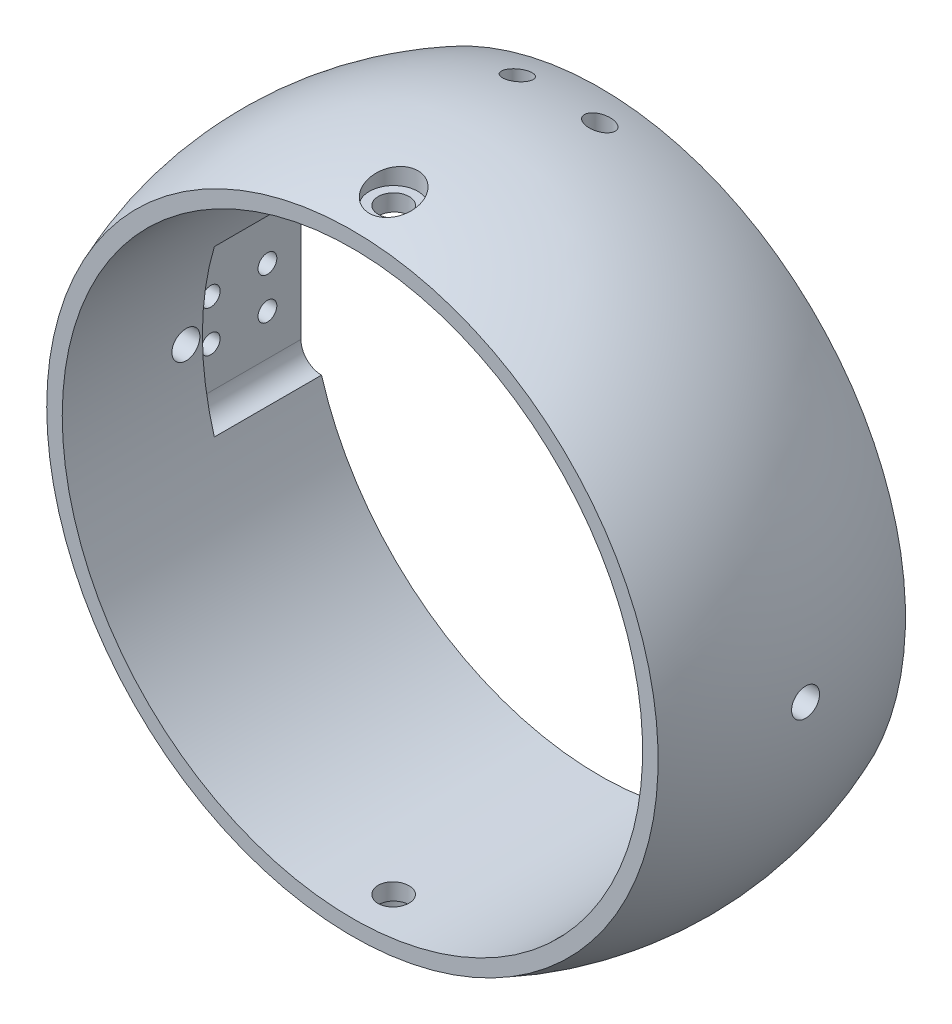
ISO-10303-21;
HEADER;
FILE_DESCRIPTION(('STEP AP214'),'2;1');
FILE_NAME('part.step','',(''),(''),'','','');
FILE_SCHEMA(('AUTOMOTIVE_DESIGN { 1 0 10303 214 1 1 1 1 }'));
ENDSEC;
DATA;
#1=APPLICATION_CONTEXT('core data for automotive mechanical design processes');
#2=APPLICATION_PROTOCOL_DEFINITION('international standard','automotive_design',2000,#1);
#3=PRODUCT_CONTEXT('',#1,'mechanical');
#4=PRODUCT('Part','Part','',(#3));
#5=PRODUCT_RELATED_PRODUCT_CATEGORY('part','',(#4));
#6=PRODUCT_DEFINITION_FORMATION('','',#4);
#7=PRODUCT_DEFINITION_CONTEXT('part definition',#1,'design');
#8=PRODUCT_DEFINITION('design','',#6,#7);
#9=PRODUCT_DEFINITION_SHAPE('','',#8);
#10=(LENGTH_UNIT() NAMED_UNIT(*) SI_UNIT(.MILLI.,.METRE.));
#11=(NAMED_UNIT(*) PLANE_ANGLE_UNIT() SI_UNIT($,.RADIAN.));
#12=(NAMED_UNIT(*) SI_UNIT($,.STERADIAN.) SOLID_ANGLE_UNIT());
#13=UNCERTAINTY_MEASURE_WITH_UNIT(LENGTH_MEASURE(1.E-05),#10,'distance_accuracy_value','');
#14=(GEOMETRIC_REPRESENTATION_CONTEXT(3) GLOBAL_UNCERTAINTY_ASSIGNED_CONTEXT((#13)) GLOBAL_UNIT_ASSIGNED_CONTEXT((#10,
#11,#12)) REPRESENTATION_CONTEXT('',''));
#15=CARTESIAN_POINT('',(0.,0.,0.));
#16=DIRECTION('',(0.,0.,1.));
#17=DIRECTION('',(1.,0.,0.));
#18=AXIS2_PLACEMENT_3D('',#15,#16,#17);
#19=CARTESIAN_POINT('',(-12.7000000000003,-101.601000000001,-12.7000000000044));
#20=DIRECTION('',(0.,1.00000000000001,0.));
#21=DIRECTION('',(0.,0.,1.00000000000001));
#22=AXIS2_PLACEMENT_3D('',#19,#20,#21);
#23=CYLINDRICAL_SURFACE('',#22,2.3876);
#24=CARTESIAN_POINT('',(-12.6999999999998,88.5014150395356,-10.3124000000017));
#25=CARTESIAN_POINT('',(-12.8354421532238,88.4819785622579,-10.3124058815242));
#26=CARTESIAN_POINT('',(-12.9709385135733,88.4622144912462,-10.32396187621));
#27=CARTESIAN_POINT('',(-13.2381241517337,88.4226262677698,-10.3698769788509));
#28=CARTESIAN_POINT('',(-13.369808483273,88.4028020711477,-10.4042644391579));
#29=CARTESIAN_POINT('',(-13.6254836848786,88.3637560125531,-10.4948936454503));
#30=CARTESIAN_POINT('',(-13.7494774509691,88.3445339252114,-10.5511271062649));
#31=CARTESIAN_POINT('',(-13.9862360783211,88.3073611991,-10.6839026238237));
#32=CARTESIAN_POINT('',(-14.0990039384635,88.2894102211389,-10.7604392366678));
#33=CARTESIAN_POINT('',(-14.3097650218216,88.2554954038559,-10.9314824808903));
#34=CARTESIAN_POINT('',(-14.4078004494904,88.2395259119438,-11.0259359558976));
#35=CARTESIAN_POINT('',(-14.5865805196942,88.2101488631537,-11.2303464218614));
#36=CARTESIAN_POINT('',(-14.6673254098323,88.1967412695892,-11.3403031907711));
#37=CARTESIAN_POINT('',(-14.8082675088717,88.1731860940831,-11.5713078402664));
#38=CARTESIAN_POINT('',(-14.8686826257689,88.1630040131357,-11.6922192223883));
#39=CARTESIAN_POINT('',(-14.9683259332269,88.1461414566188,-11.9427056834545));
#40=CARTESIAN_POINT('',(-15.0075558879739,88.13946068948,-12.0722800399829));
#41=CARTESIAN_POINT('',(-15.0632351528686,88.1299620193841,-12.3346192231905));
#42=CARTESIAN_POINT('',(-15.0799716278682,88.127095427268,-12.4673213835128));
#43=CARTESIAN_POINT('',(-15.0910802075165,88.1251938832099,-12.7336825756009));
#44=CARTESIAN_POINT('',(-15.0854534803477,88.1261587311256,-12.8673415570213));
#45=CARTESIAN_POINT('',(-15.0521289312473,88.1318566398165,-13.1308630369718));
#46=CARTESIAN_POINT('',(-15.0245819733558,88.1365639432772,-13.2607452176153));
#47=CARTESIAN_POINT('',(-14.9484487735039,88.1495083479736,-13.5140001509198));
#48=CARTESIAN_POINT('',(-14.8998623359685,88.1577454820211,-13.6373728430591));
#49=CARTESIAN_POINT('',(-14.7828968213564,88.1774344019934,-13.8746189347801));
#50=CARTESIAN_POINT('',(-14.7144472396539,88.1888976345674,-13.9884566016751));
#51=CARTESIAN_POINT('',(-14.5598370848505,88.2145550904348,-14.2030404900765));
#52=CARTESIAN_POINT('',(-14.4736755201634,88.2287494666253,-14.3037859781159));
#53=CARTESIAN_POINT('',(-14.2850115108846,88.2594931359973,-14.4905856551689));
#54=CARTESIAN_POINT('',(-14.1823313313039,88.2760678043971,-14.5764561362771));
#55=CARTESIAN_POINT('',(-13.9642774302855,88.3108237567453,-14.7297793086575));
#56=CARTESIAN_POINT('',(-13.8489028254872,88.3290051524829,-14.7972307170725));
#57=CARTESIAN_POINT('',(-13.6071593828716,88.3665706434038,-14.9126586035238));
#58=CARTESIAN_POINT('',(-13.4806712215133,88.3859669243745,-14.9603813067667));
#59=CARTESIAN_POINT('',(-13.2215127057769,88.4251052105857,-15.0338381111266));
#60=CARTESIAN_POINT('',(-13.0888420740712,88.4448472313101,-15.0595712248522));
#61=CARTESIAN_POINT('',(-12.8201148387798,88.4842001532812,-15.0884282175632));
#62=CARTESIAN_POINT('',(-12.684041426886,88.5038092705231,-15.0913983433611));
#63=CARTESIAN_POINT('',(-12.4132439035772,88.5421964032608,-15.0741969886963));
#64=CARTESIAN_POINT('',(-12.2785197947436,88.5609744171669,-15.0540254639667));
#65=CARTESIAN_POINT('',(-12.0144471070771,88.5971854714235,-14.9910808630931));
#66=CARTESIAN_POINT('',(-11.8850920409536,88.6146201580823,-14.9483359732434));
#67=CARTESIAN_POINT('',(-11.6353346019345,88.6477599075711,-14.8413951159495));
#68=CARTESIAN_POINT('',(-11.5149319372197,88.6634650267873,-14.7771998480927));
#69=CARTESIAN_POINT('',(-11.2874113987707,88.6927161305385,-14.6296337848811));
#70=CARTESIAN_POINT('',(-11.1802079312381,88.7062762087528,-14.5463977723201));
#71=CARTESIAN_POINT('',(-10.9812937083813,88.73112035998,-14.3628276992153));
#72=CARTESIAN_POINT('',(-10.8895822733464,88.7424045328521,-14.2624943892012));
#73=CARTESIAN_POINT('',(-10.7250801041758,88.7624354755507,-14.0484771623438));
#74=CARTESIAN_POINT('',(-10.6521384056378,88.7712025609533,-13.9349111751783));
#75=CARTESIAN_POINT('',(-10.5263528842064,88.7862060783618,-13.6969936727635));
#76=CARTESIAN_POINT('',(-10.4735082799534,88.7924426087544,-13.572642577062));
#77=CARTESIAN_POINT('',(-10.3897731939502,88.8022795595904,-13.3175657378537));
#78=CARTESIAN_POINT('',(-10.358740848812,88.8058970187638,-13.1868872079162));
#79=CARTESIAN_POINT('',(-10.318990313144,88.8105247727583,-12.9221346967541));
#80=CARTESIAN_POINT('',(-10.3102716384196,88.8115351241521,-12.788060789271));
#81=CARTESIAN_POINT('',(-10.3153979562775,88.8109398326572,-12.520810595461));
#82=CARTESIAN_POINT('',(-10.3291660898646,88.8093431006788,-12.3876328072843));
#83=CARTESIAN_POINT('',(-10.3787134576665,88.8035662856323,-12.1254958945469));
#84=CARTESIAN_POINT('',(-10.4144925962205,88.7993862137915,-11.9965367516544));
#85=CARTESIAN_POINT('',(-10.5070115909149,88.7884864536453,-11.7464749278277));
#86=CARTESIAN_POINT('',(-10.5637531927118,88.7817665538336,-11.6253729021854));
#87=CARTESIAN_POINT('',(-10.6965309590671,88.7658669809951,-11.394440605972));
#88=CARTESIAN_POINT('',(-10.7725665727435,88.7566873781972,-11.2846100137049));
#89=CARTESIAN_POINT('',(-10.9420112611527,88.7359574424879,-11.0789119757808));
#90=CARTESIAN_POINT('',(-11.0354786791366,88.7243991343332,-10.9830934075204));
#91=CARTESIAN_POINT('',(-11.2369384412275,88.6991091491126,-10.8084775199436));
#92=CARTESIAN_POINT('',(-11.344934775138,88.6853768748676,-10.7296848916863));
#93=CARTESIAN_POINT('',(-11.5731370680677,88.6558869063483,-10.5907846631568));
#94=CARTESIAN_POINT('',(-11.6934239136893,88.6401155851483,-10.5308130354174));
#95=CARTESIAN_POINT('',(-11.9420481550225,88.6069614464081,-10.4319607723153));
#96=CARTESIAN_POINT('',(-12.0703762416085,88.5895804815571,-10.3930562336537));
#97=CARTESIAN_POINT('',(-12.2829068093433,88.5603046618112,-10.3476138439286));
#98=CARTESIAN_POINT('',(-12.3657960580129,88.5487697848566,-10.3344214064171));
#99=CARTESIAN_POINT('',(-12.5324499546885,88.5253367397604,-10.3168126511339));
#100=CARTESIAN_POINT('',(-12.6162146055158,88.5134385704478,-10.3123963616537));
#101=CARTESIAN_POINT('',(-12.6999999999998,88.5014150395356,-10.3124000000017));
#102=B_SPLINE_CURVE_WITH_KNOTS('',3,(#24,#25,#26,#27,#28,#29,#30,#31,#32,#33,#34,#35,#36,#37,
#38,#39,#40,#41,#42,#43,#44,#45,#46,#47,#48,#49,#50,#51,#52,#53,#54,#55,#56,#57,#58,#59,#60,#61,
#62,#63,#64,#65,#66,#67,#68,#69,#70,#71,#72,#73,#74,#75,#76,#77,#78,#79,#80,#81,#82,#83,#84,#85,
#86,#87,#88,#89,#90,#91,#92,#93,#94,#95,#96,#97,#98,#99,#100,#101),.UNSPECIFIED.,.T.,.F.,(4,2,2,
2,2,2,2,2,2,2,2,2,2,2,2,2,2,2,2,2,2,2,2,2,2,2,2,2,2,2,2,2,2,2,2,2,2,2,4),(0.,0.410180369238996,
0.820871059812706,1.23140614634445,1.64183126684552,2.05105724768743,2.46027736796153,
2.86496000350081,3.26960893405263,3.66904118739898,4.06845257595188,4.46513858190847,
4.86182827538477,5.25994361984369,5.65808125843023,6.06083103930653,6.46360886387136,
6.87141758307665,7.27924461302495,7.68982391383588,8.10040400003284,8.51047262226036,
8.92052787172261,9.32776569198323,9.73498564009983,10.138820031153,10.5426387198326,
10.9438061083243,11.3449647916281,11.7447551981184,12.1445438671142,12.5443658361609,
12.9441763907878,13.3453499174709,13.7466338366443,14.1507534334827,14.554413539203,
14.8081529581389,15.061893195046),.UNSPECIFIED.);
#103=CARTESIAN_POINT('',(-12.6999999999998,88.5014150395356,-10.3124000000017));
#104=VERTEX_POINT('',#103);
#105=EDGE_CURVE('E196',#104,#104,#102,.T.);
#106=ORIENTED_EDGE('',*,*,#105,.T.);
#107=EDGE_LOOP('',(#106));
#108=FACE_BOUND('',#107,.T.);
#109=CARTESIAN_POINT('',(-12.6999999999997,92.0750000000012,-12.6999999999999));
#110=DIRECTION('',(0.,1.00000000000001,0.));
#111=DIRECTION('',(0.,0.,1.00000000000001));
#112=AXIS2_PLACEMENT_3D('',#109,#110,#111);
#113=CIRCLE('',#112,2.3876);
#114=CARTESIAN_POINT('',(-12.6999999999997,92.0750000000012,-10.3123999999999));
#115=VERTEX_POINT('',#114);
#116=EDGE_CURVE('E305',#115,#115,#113,.T.);
#117=ORIENTED_EDGE('',*,*,#116,.T.);
#118=EDGE_LOOP('',(#117));
#119=FACE_BOUND('',#118,.T.);
#120=ADVANCED_FACE('F32',(#108,#119),#23,.F.);
#121=CARTESIAN_POINT('',(12.6999999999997,-101.601000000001,-12.7000000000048));
#122=DIRECTION('',(0.,1.00000000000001,0.));
#123=DIRECTION('',(0.,0.,1.00000000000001));
#124=AXIS2_PLACEMENT_3D('',#121,#122,#123);
#125=CYLINDRICAL_SURFACE('',#124,2.3876);
#126=CARTESIAN_POINT('',(12.7000000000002,88.5014150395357,-10.3124000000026));
#127=CARTESIAN_POINT('',(12.8354421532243,88.481978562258,-10.3124058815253));
#128=CARTESIAN_POINT('',(12.9709385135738,88.4622144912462,-10.3239618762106));
#129=CARTESIAN_POINT('',(13.2381241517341,88.4226262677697,-10.3698769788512));
#130=CARTESIAN_POINT('',(13.3698084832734,88.4028020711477,-10.4042644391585));
#131=CARTESIAN_POINT('',(13.625483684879,88.363756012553,-10.494893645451));
#132=CARTESIAN_POINT('',(13.7494774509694,88.3445339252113,-10.5511271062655));
#133=CARTESIAN_POINT('',(13.9862360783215,88.3073611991,-10.6839026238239));
#134=CARTESIAN_POINT('',(14.099003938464,88.2894102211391,-10.7604392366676));
#135=CARTESIAN_POINT('',(14.3097650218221,88.2554954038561,-10.9314824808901));
#136=CARTESIAN_POINT('',(14.4078004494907,88.2395259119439,-11.0259359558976));
#137=CARTESIAN_POINT('',(14.5865805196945,88.2101488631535,-11.2303464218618));
#138=CARTESIAN_POINT('',(14.6673254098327,88.1967412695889,-11.3403031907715));
#139=CARTESIAN_POINT('',(14.8082675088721,88.1731860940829,-11.5713078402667));
#140=CARTESIAN_POINT('',(14.8686826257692,88.1630040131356,-11.6922192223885));
#141=CARTESIAN_POINT('',(14.9683259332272,88.1461414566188,-11.9427056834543));
#142=CARTESIAN_POINT('',(15.0075558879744,88.1394606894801,-12.0722800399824));
#143=CARTESIAN_POINT('',(15.0632351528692,88.1299620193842,-12.33461922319));
#144=CARTESIAN_POINT('',(15.0799716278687,88.127095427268,-12.4673213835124));
#145=CARTESIAN_POINT('',(15.091080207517,88.1251938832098,-12.7336825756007));
#146=CARTESIAN_POINT('',(15.0854534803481,88.1261587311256,-12.8673415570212));
#147=CARTESIAN_POINT('',(15.0521289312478,88.1318566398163,-13.1308630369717));
#148=CARTESIAN_POINT('',(15.0245819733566,88.136563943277,-13.2607452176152));
#149=CARTESIAN_POINT('',(14.9484487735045,88.1495083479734,-13.5140001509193));
#150=CARTESIAN_POINT('',(14.8998623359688,88.1577454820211,-13.6373728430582));
#151=CARTESIAN_POINT('',(14.7828968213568,88.1774344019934,-13.8746189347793));
#152=CARTESIAN_POINT('',(14.7144472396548,88.1888976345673,-13.9884566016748));
#153=CARTESIAN_POINT('',(14.5598370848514,88.2145550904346,-14.2030404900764));
#154=CARTESIAN_POINT('',(14.4736755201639,88.2287494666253,-14.3037859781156));
#155=CARTESIAN_POINT('',(14.285011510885,88.2594931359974,-14.4905856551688));
#156=CARTESIAN_POINT('',(14.1823313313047,88.2760678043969,-14.5764561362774));
#157=CARTESIAN_POINT('',(13.9642774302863,88.3108237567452,-14.7297793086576));
#158=CARTESIAN_POINT('',(13.8489028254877,88.3290051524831,-14.797230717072));
#159=CARTESIAN_POINT('',(13.607159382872,88.366570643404,-14.9126586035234));
#160=CARTESIAN_POINT('',(13.480671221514,88.3859669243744,-14.9603813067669));
#161=CARTESIAN_POINT('',(13.2215127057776,88.4251052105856,-15.0338381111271));
#162=CARTESIAN_POINT('',(13.0888420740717,88.4448472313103,-15.0595712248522));
#163=CARTESIAN_POINT('',(12.8201148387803,88.4842001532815,-15.0884282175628));
#164=CARTESIAN_POINT('',(12.6840414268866,88.503809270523,-15.0913983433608));
#165=CARTESIAN_POINT('',(12.4132439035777,88.5421964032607,-15.0741969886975));
#166=CARTESIAN_POINT('',(12.2785197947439,88.5609744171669,-15.0540254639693));
#167=CARTESIAN_POINT('',(12.0144471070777,88.5971854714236,-14.9910808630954));
#168=CARTESIAN_POINT('',(11.8850920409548,88.6146201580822,-14.9483359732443));
#169=CARTESIAN_POINT('',(11.6353346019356,88.6477599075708,-14.8413951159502));
#170=CARTESIAN_POINT('',(11.5149319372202,88.663465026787,-14.7771998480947));
#171=CARTESIAN_POINT('',(11.2874113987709,88.6927161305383,-14.6296337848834));
#172=CARTESIAN_POINT('',(11.1802079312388,88.7062762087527,-14.5463977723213));
#173=CARTESIAN_POINT('',(10.9812937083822,88.7311203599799,-14.3628276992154));
#174=CARTESIAN_POINT('',(10.8895822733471,88.742404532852,-14.2624943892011));
#175=CARTESIAN_POINT('',(10.7250801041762,88.7624354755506,-14.0484771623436));
#176=CARTESIAN_POINT('',(10.652138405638,88.7712025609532,-13.9349111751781));
#177=CARTESIAN_POINT('',(10.5263528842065,88.7862060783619,-13.6969936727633));
#178=CARTESIAN_POINT('',(10.4735082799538,88.7924426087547,-13.5726425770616));
#179=CARTESIAN_POINT('',(10.3897731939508,88.8022795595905,-13.3175657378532));
#180=CARTESIAN_POINT('',(10.3587408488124,88.8058970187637,-13.1868872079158));
#181=CARTESIAN_POINT('',(10.3189903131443,88.8105247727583,-12.9221346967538));
#182=CARTESIAN_POINT('',(10.31027163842,88.8115351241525,-12.7880607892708));
#183=CARTESIAN_POINT('',(10.315397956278,88.8109398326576,-12.5208105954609));
#184=CARTESIAN_POINT('',(10.3291660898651,88.8093431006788,-12.3876328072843));
#185=CARTESIAN_POINT('',(10.378713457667,88.8035662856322,-12.1254958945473));
#186=CARTESIAN_POINT('',(10.4144925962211,88.7993862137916,-11.9965367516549));
#187=CARTESIAN_POINT('',(10.5070115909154,88.7884864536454,-11.7464749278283));
#188=CARTESIAN_POINT('',(10.5637531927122,88.7817665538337,-11.6253729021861));
#189=CARTESIAN_POINT('',(10.6965309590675,88.765866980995,-11.3944406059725));
#190=CARTESIAN_POINT('',(10.7725665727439,88.7566873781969,-11.2846100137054));
#191=CARTESIAN_POINT('',(10.9420112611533,88.7359574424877,-11.0789119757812));
#192=CARTESIAN_POINT('',(11.0354786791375,88.724399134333,-10.9830934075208));
#193=CARTESIAN_POINT('',(11.2369384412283,88.6991091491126,-10.8084775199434));
#194=CARTESIAN_POINT('',(11.3449347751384,88.6853768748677,-10.7296848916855));
#195=CARTESIAN_POINT('',(11.5731370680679,88.6558869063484,-10.590784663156));
#196=CARTESIAN_POINT('',(11.6934239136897,88.6401155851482,-10.5308130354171));
#197=CARTESIAN_POINT('',(11.9420481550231,88.6069614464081,-10.4319607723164));
#198=CARTESIAN_POINT('',(12.0703762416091,88.5895804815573,-10.3930562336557));
#199=CARTESIAN_POINT('',(12.2829068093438,88.5603046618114,-10.3476138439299));
#200=CARTESIAN_POINT('',(12.3657960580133,88.5487697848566,-10.3344214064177));
#201=CARTESIAN_POINT('',(12.5324499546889,88.5253367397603,-10.3168126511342));
#202=CARTESIAN_POINT('',(12.6162146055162,88.5134385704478,-10.3123963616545));
#203=CARTESIAN_POINT('',(12.7000000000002,88.5014150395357,-10.3124000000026));
#204=B_SPLINE_CURVE_WITH_KNOTS('',3,(#126,#127,#128,#129,#130,#131,#132,#133,#134,#135,#136,
#137,#138,#139,#140,#141,#142,#143,#144,#145,#146,#147,#148,#149,#150,#151,#152,#153,#154,#155,
#156,#157,#158,#159,#160,#161,#162,#163,#164,#165,#166,#167,#168,#169,#170,#171,#172,#173,#174,
#175,#176,#177,#178,#179,#180,#181,#182,#183,#184,#185,#186,#187,#188,#189,#190,#191,#192,#193,
#194,#195,#196,#197,#198,#199,#200,#201,#202,#203),.UNSPECIFIED.,.T.,.F.,(4,2,2,2,2,2,2,2,2,2,2,
2,2,2,2,2,2,2,2,2,2,2,2,2,2,2,2,2,2,2,2,2,2,2,2,2,2,2,4),(0.,0.410180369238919,
0.820871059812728,1.2314061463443,1.64183126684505,2.05105724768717,2.46027736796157,
2.86496000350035,3.2696089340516,3.66904118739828,4.06845257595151,4.46513858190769,
4.86182827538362,5.25994361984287,5.65808125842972,6.06083103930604,6.46360886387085,
6.87141758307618,7.27924461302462,7.68982391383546,8.10040400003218,8.51047262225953,
8.9205278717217,9.32776569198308,9.7349856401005,10.1388200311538,10.5426387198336,
10.9438061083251,11.3449647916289,11.7447551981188,12.144543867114,12.5443658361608,
12.9441763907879,13.3453499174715,13.7466338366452,14.1507534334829,14.5544135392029,
14.8081529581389,15.061893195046),.UNSPECIFIED.);
#205=CARTESIAN_POINT('',(12.7000000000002,88.5014150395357,-10.3124000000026));
#206=VERTEX_POINT('',#205);
#207=EDGE_CURVE('E215',#206,#206,#204,.T.);
#208=ORIENTED_EDGE('',*,*,#207,.F.);
#209=EDGE_LOOP('',(#208));
#210=FACE_BOUND('',#209,.T.);
#211=CARTESIAN_POINT('',(12.7000000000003,92.0750000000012,-12.700000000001));
#212=DIRECTION('',(0.,1.00000000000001,0.));
#213=DIRECTION('',(0.,0.,1.00000000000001));
#214=AXIS2_PLACEMENT_3D('',#211,#212,#213);
#215=CIRCLE('',#214,2.3876);
#216=CARTESIAN_POINT('',(12.7000000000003,92.0750000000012,-10.312400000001));
#217=VERTEX_POINT('',#216);
#218=EDGE_CURVE('E304',#217,#217,#215,.F.);
#219=ORIENTED_EDGE('',*,*,#218,.F.);
#220=EDGE_LOOP('',(#219));
#221=FACE_BOUND('',#220,.T.);
#222=ADVANCED_FACE('F209',(#210,#221),#125,.F.);
#223=CARTESIAN_POINT('',(0.,2.22044604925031E-13,12.6999999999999));
#224=DIRECTION('',(0.,0.,1.00000000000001));
#225=DIRECTION('',(1.,0.,0.));
#226=AXIS2_PLACEMENT_3D('',#223,#224,#225);
#227=SPHERICAL_SURFACE('',#226,101.6);
#228=CARTESIAN_POINT('',(-15.4537200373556,96.3624834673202,-15.5491471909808));
#229=CARTESIAN_POINT('',(-15.3002936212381,96.3436217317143,-15.6974181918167));
#230=CARTESIAN_POINT('',(-15.1344495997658,96.3295603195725,-15.8336664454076));
#231=CARTESIAN_POINT('',(-14.782443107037,96.3115751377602,-16.0778721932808));
#232=CARTESIAN_POINT('',(-14.5962617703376,96.3076608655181,-16.1858030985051));
#233=CARTESIAN_POINT('',(-14.2089921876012,96.3101281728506,-16.3700826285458));
#234=CARTESIAN_POINT('',(-14.0079085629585,96.3165065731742,-16.4464409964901));
#235=CARTESIAN_POINT('',(-13.596626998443,96.3393222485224,-16.5655546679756));
#236=CARTESIAN_POINT('',(-13.3864306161,96.3557578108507,-16.6083156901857));
#237=CARTESIAN_POINT('',(-12.962583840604,96.3981319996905,-16.6594557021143));
#238=CARTESIAN_POINT('',(-12.7489293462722,96.4240828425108,-16.6677903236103));
#239=CARTESIAN_POINT('',(-12.3242756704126,96.4846103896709,-16.6502687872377));
#240=CARTESIAN_POINT('',(-12.113276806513,96.5191881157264,-16.6244085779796));
#241=CARTESIAN_POINT('',(-11.6941975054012,96.5968464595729,-16.5387315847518));
#242=CARTESIAN_POINT('',(-11.4863248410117,96.6401195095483,-16.4780749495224));
#243=CARTESIAN_POINT('',(-11.0844547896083,96.7332533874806,-16.3244899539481));
#244=CARTESIAN_POINT('',(-10.8904598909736,96.7831153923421,-16.2315558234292));
#245=CARTESIAN_POINT('',(-10.5138495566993,96.8900452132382,-16.012198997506));
#246=CARTESIAN_POINT('',(-10.3319672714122,96.9473174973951,-15.8846172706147));
#247=CARTESIAN_POINT('',(-9.99270800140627,97.0658055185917,-15.6017226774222));
#248=CARTESIAN_POINT('',(-9.83533572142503,97.1270220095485,-15.4464044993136));
#249=CARTESIAN_POINT('',(-9.54369289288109,97.2540150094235,-15.1063055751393));
#250=CARTESIAN_POINT('',(-9.41046457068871,97.3198763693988,-14.9206619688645));
#251=CARTESIAN_POINT('',(-9.17785269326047,97.4522451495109,-14.5294532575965));
#252=CARTESIAN_POINT('',(-9.07847376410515,97.5187526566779,-14.3238854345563));
#253=CARTESIAN_POINT('',(-8.91482844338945,97.6518131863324,-13.8945006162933));
#254=CARTESIAN_POINT('',(-8.85124031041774,97.7183446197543,-13.6704178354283));
#255=CARTESIAN_POINT('',(-8.76416794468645,97.8482913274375,-13.2136934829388));
#256=CARTESIAN_POINT('',(-8.7406838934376,97.9117065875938,-12.9810518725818));
#257=CARTESIAN_POINT('',(-8.73510722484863,98.0330599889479,-12.5157572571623));
#258=CARTESIAN_POINT('',(-8.75269330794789,98.0910369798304,-12.2831184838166));
#259=CARTESIAN_POINT('',(-8.82884590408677,98.200260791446,-11.8230013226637));
#260=CARTESIAN_POINT('',(-8.88740600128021,98.2515086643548,-11.5955221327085));
#261=CARTESIAN_POINT('',(-9.04211183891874,98.3441141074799,-11.1597844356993));
#262=CARTESIAN_POINT('',(-9.13704230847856,98.3857280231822,-10.9511494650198));
#263=CARTESIAN_POINT('',(-9.36235845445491,98.4596214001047,-10.5521615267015));
#264=CARTESIAN_POINT('',(-9.4927353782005,98.4919031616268,-10.3618040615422));
#265=CARTESIAN_POINT('',(-9.77960879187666,98.5448962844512,-10.0128231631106));
#266=CARTESIAN_POINT('',(-9.9348624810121,98.56601620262,-9.85323974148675));
#267=CARTESIAN_POINT('',(-10.2705167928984,98.5978358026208,-9.56191518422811));
#268=CARTESIAN_POINT('',(-10.4509123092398,98.6085375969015,-9.43016840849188));
#269=CARTESIAN_POINT('',(-10.8257312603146,98.6189766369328,-9.20223002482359));
#270=CARTESIAN_POINT('',(-11.0195670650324,98.6190350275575,-9.10508540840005));
#271=CARTESIAN_POINT('',(-11.4202365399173,98.6089912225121,-8.94374513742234));
#272=CARTESIAN_POINT('',(-11.6270692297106,98.5988897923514,-8.87954700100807));
#273=CARTESIAN_POINT('',(-12.046119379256,98.5689884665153,-8.7860764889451));
#274=CARTESIAN_POINT('',(-12.2582839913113,98.5492628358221,-8.75654247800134));
#275=CARTESIAN_POINT('',(-12.6835619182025,98.500793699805,-8.73191216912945));
#276=CARTESIAN_POINT('',(-12.8966752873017,98.4720496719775,-8.73681786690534));
#277=CARTESIAN_POINT('',(-13.3217725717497,98.4058685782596,-8.78075791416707));
#278=CARTESIAN_POINT('',(-13.5336732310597,98.36828978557,-8.82038095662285));
#279=CARTESIAN_POINT('',(-13.946972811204,98.2858593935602,-8.93283101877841));
#280=CARTESIAN_POINT('',(-14.1483701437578,98.2410066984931,-9.0056630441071));
#281=CARTESIAN_POINT('',(-14.5423801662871,98.1436376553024,-9.18507409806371));
#282=CARTESIAN_POINT('',(-14.7344493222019,98.0909101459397,-9.29273166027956));
#283=CARTESIAN_POINT('',(-15.0972431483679,97.9805091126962,-9.53744666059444));
#284=CARTESIAN_POINT('',(-15.2679636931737,97.9228346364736,-9.67450976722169));
#285=CARTESIAN_POINT('',(-15.589999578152,97.8018110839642,-9.97978229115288));
#286=CARTESIAN_POINT('',(-15.7403317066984,97.73832968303,-10.1489768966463));
#287=CARTESIAN_POINT('',(-16.0098403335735,97.6094161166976,-10.5099504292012));
#288=CARTESIAN_POINT('',(-16.1290116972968,97.5439836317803,-10.70173307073));
#289=CARTESIAN_POINT('',(-16.3357935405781,97.4112181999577,-11.1078606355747));
#290=CARTESIAN_POINT('',(-16.4225023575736,97.3438800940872,-11.322662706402));
#291=CARTESIAN_POINT('',(-16.5573475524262,97.2108576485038,-11.7646915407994));
#292=CARTESIAN_POINT('',(-16.6054829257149,97.1451733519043,-11.9919186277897));
#293=CARTESIAN_POINT('',(-16.6474742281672,97.0493377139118,-12.3372170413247));
#294=CARTESIAN_POINT('',(-16.656425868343,97.0177918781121,-12.4532517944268));
#295=CARTESIAN_POINT('',(-16.6640816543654,96.9558476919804,-12.6859501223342));
#296=CARTESIAN_POINT('',(-16.6627898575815,96.9254488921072,-12.8026134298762));
#297=CARTESIAN_POINT('',(-16.6498747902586,96.8660186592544,-13.0357850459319));
#298=CARTESIAN_POINT('',(-16.6382453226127,96.8369880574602,-13.152293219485));
#299=CARTESIAN_POINT('',(-16.6046448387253,96.780560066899,-13.38416133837));
#300=CARTESIAN_POINT('',(-16.5826782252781,96.7531619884,-13.4995217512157));
#301=CARTESIAN_POINT('',(-16.529088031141,96.7008272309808,-13.7256148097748));
#302=CARTESIAN_POINT('',(-16.4976972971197,96.6758485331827,-13.8363929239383));
#303=CARTESIAN_POINT('',(-16.4252506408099,96.6278829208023,-14.0551345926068));
#304=CARTESIAN_POINT('',(-16.3841988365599,96.6048951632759,-14.1630993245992));
#305=CARTESIAN_POINT('',(-16.2926816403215,96.5611267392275,-14.3752865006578));
#306=CARTESIAN_POINT('',(-16.2422266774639,96.540343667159,-14.4795129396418));
#307=CARTESIAN_POINT('',(-16.1321951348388,96.5011539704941,-14.6834507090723));
#308=CARTESIAN_POINT('',(-16.0726213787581,96.4827466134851,-14.7831634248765));
#309=CARTESIAN_POINT('',(-15.9290853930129,96.444290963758,-15.0009805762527));
#310=CARTESIAN_POINT('',(-15.8427188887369,96.4249377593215,-15.1176378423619));
#311=CARTESIAN_POINT('',(-15.6574035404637,96.3904719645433,-15.34111312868));
#312=CARTESIAN_POINT('',(-15.5584550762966,96.3753592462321,-15.4479314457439));
#313=CARTESIAN_POINT('',(-15.4537200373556,96.3624834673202,-15.5491471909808));
#314=B_SPLINE_CURVE_WITH_KNOTS('',3,(#228,#229,#230,#231,#232,#233,#234,#235,#236,#237,#238,
#239,#240,#241,#242,#243,#244,#245,#246,#247,#248,#249,#250,#251,#252,#253,#254,#255,#256,#257,
#258,#259,#260,#261,#262,#263,#264,#265,#266,#267,#268,#269,#270,#271,#272,#273,#274,#275,#276,
#277,#278,#279,#280,#281,#282,#283,#284,#285,#286,#287,#288,#289,#290,#291,#292,#293,#294,#295,
#296,#297,#298,#299,#300,#301,#302,#303,#304,#305,#306,#307,#308,#309,#310,#311,#312,#313),
.UNSPECIFIED.,.T.,.F.,(4,2,2,2,2,2,2,2,2,2,2,2,2,2,2,2,2,2,2,2,2,2,2,2,2,2,2,2,2,2,2,2,2,2,2,2,
2,2,2,2,2,2,4),(0.,0.642079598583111,1.28475994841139,1.92724182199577,2.56961431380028,
3.21281442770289,3.85609075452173,4.51558883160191,5.17520486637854,5.86040350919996,
6.54573351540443,7.25586684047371,7.9660971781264,8.68936904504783,9.41264418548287,
10.130279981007,10.8478034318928,11.5431909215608,12.2384068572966,12.9060157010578,
13.5734891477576,14.2208193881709,14.8681008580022,15.5104647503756,16.1528658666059,
16.8063755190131,17.4599837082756,18.1361630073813,18.8124727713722,19.5144675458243,
20.2165779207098,20.9369528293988,21.6573464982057,22.0187204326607,22.3799512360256,
22.7413987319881,23.1026924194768,23.4557062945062,23.808569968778,24.1610445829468,
24.5134102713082,24.9517328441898,25.3900421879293),.UNSPECIFIED.);
#315=CARTESIAN_POINT('',(-15.4537200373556,96.3624834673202,-15.5491471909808));
#316=VERTEX_POINT('',#315);
#317=EDGE_CURVE('E37',#316,#316,#314,.T.);
#318=ORIENTED_EDGE('',*,*,#317,.T.);
#319=EDGE_LOOP('',(#318));
#320=FACE_BOUND('',#319,.T.);
#321=CARTESIAN_POINT('',(10.1855991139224,96.9984760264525,-15.7624176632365));
#322=CARTESIAN_POINT('',(10.3577835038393,96.9389148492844,-15.9037797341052));
#323=CARTESIAN_POINT('',(10.5424376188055,96.8813617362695,-16.0310275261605));
#324=CARTESIAN_POINT('',(10.9320111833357,96.7719848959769,-16.25319377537));
#325=CARTESIAN_POINT('',(11.1369488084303,96.7201663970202,-16.3480828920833));
#326=CARTESIAN_POINT('',(11.5618196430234,96.6238730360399,-16.5021387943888));
#327=CARTESIAN_POINT('',(11.781771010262,96.5794072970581,-16.5612614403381));
#328=CARTESIAN_POINT('',(12.2300982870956,96.4994447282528,-16.6410169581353));
#329=CARTESIAN_POINT('',(12.4584714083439,96.4639449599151,-16.6616624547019));
#330=CARTESIAN_POINT('',(12.9098120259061,96.404132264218,-16.6630770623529));
#331=CARTESIAN_POINT('',(13.1327351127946,96.3795145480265,-16.645028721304));
#332=CARTESIAN_POINT('',(13.5732448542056,96.3408594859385,-16.5714200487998));
#333=CARTESIAN_POINT('',(13.7908324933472,96.3268201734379,-16.5158666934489));
#334=CARTESIAN_POINT('',(14.2066631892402,96.3101522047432,-16.3711572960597));
#335=CARTESIAN_POINT('',(14.4053126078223,96.3071514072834,-16.2832094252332));
#336=CARTESIAN_POINT('',(14.7854817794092,96.3116348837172,-16.076124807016));
#337=CARTESIAN_POINT('',(14.967003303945,96.3191180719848,-15.9569912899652));
#338=CARTESIAN_POINT('',(15.305720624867,96.3441410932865,-15.6927305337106));
#339=CARTESIAN_POINT('',(15.463179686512,96.3615604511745,-15.5479287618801));
#340=CARTESIAN_POINT('',(15.7522167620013,96.4057531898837,-15.2357149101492));
#341=CARTESIAN_POINT('',(15.8837936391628,96.4325269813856,-15.0683018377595));
#342=CARTESIAN_POINT('',(16.1196884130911,96.495004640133,-14.7130780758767));
#343=CARTESIAN_POINT('',(16.2235677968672,96.5308364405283,-14.5249990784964));
#344=CARTESIAN_POINT('',(16.3992367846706,96.6100716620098,-14.135913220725));
#345=CARTESIAN_POINT('',(16.4710215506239,96.653476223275,-13.9349044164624));
#346=CARTESIAN_POINT('',(16.5831885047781,96.7481780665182,-13.5182825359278));
#347=CARTESIAN_POINT('',(16.6224002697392,96.7996961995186,-13.3024048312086));
#348=CARTESIAN_POINT('',(16.6648207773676,96.9079418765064,-12.8684383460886));
#349=CARTESIAN_POINT('',(16.6680225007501,96.9646704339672,-12.6503491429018));
#350=CARTESIAN_POINT('',(16.6383189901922,97.0840976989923,-12.2090109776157));
#351=CARTESIAN_POINT('',(16.6039850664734,97.1469436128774,-11.9858976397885));
#352=CARTESIAN_POINT('',(16.4982794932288,97.2748371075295,-11.5492764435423));
#353=CARTESIAN_POINT('',(16.4269015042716,97.3398850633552,-11.3357702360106));
#354=CARTESIAN_POINT('',(16.2466886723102,97.4722649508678,-10.9182196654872));
#355=CARTESIAN_POINT('',(16.1368632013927,97.5396099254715,-10.71460621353));
#356=CARTESIAN_POINT('',(15.8832644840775,97.6728990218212,-10.3292068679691));
#357=CARTESIAN_POINT('',(15.7394888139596,97.7388430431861,-10.1474225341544));
#358=CARTESIAN_POINT('',(15.4210939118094,97.8677342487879,-9.81032217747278));
#359=CARTESIAN_POINT('',(15.2463448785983,97.9306673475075,-9.65512317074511));
#360=CARTESIAN_POINT('',(14.8711243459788,98.0513499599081,-9.37715045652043));
#361=CARTESIAN_POINT('',(14.6706550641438,98.1090999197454,-9.25437395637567));
#362=CARTESIAN_POINT('',(14.2542004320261,98.2164078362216,-9.04788875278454));
#363=CARTESIAN_POINT('',(14.0386461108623,98.2661163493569,-8.96339018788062));
#364=CARTESIAN_POINT('',(13.5944853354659,98.3571932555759,-8.83295417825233));
#365=CARTESIAN_POINT('',(13.3658817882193,98.3985634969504,-8.78700818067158));
#366=CARTESIAN_POINT('',(12.9114285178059,98.470127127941,-8.7368976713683));
#367=CARTESIAN_POINT('',(12.6858040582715,98.5006853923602,-8.73121231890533));
#368=CARTESIAN_POINT('',(12.2357422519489,98.5516779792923,-8.75844400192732));
#369=CARTESIAN_POINT('',(12.0113046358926,98.5721147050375,-8.79135186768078));
#370=CARTESIAN_POINT('',(11.5787332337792,98.6015720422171,-8.89330242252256));
#371=CARTESIAN_POINT('',(11.3703033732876,98.6109829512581,-8.96097910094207));
#372=CARTESIAN_POINT('',(10.967279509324,98.6193915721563,-9.12984471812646));
#373=CARTESIAN_POINT('',(10.7726836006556,98.6183907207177,-9.23102903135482));
#374=CARTESIAN_POINT('',(10.4065298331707,98.6061306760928,-9.46170386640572));
#375=CARTESIAN_POINT('',(10.2346093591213,98.5950635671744,-9.5906299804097));
#376=CARTESIAN_POINT('',(9.91431575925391,98.5633148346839,-9.87399575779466));
#377=CARTESIAN_POINT('',(9.76594268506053,98.5426331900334,-10.0284354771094));
#378=CARTESIAN_POINT('',(9.49565365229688,98.4921634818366,-10.3593337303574));
#379=CARTESIAN_POINT('',(9.37391750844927,98.4623166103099,-10.5359299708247));
#380=CARTESIAN_POINT('',(9.16096221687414,98.3944991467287,-10.9052092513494));
#381=CARTESIAN_POINT('',(9.06974670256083,98.3565275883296,-11.0978942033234));
#382=CARTESIAN_POINT('',(8.91752004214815,98.2724022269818,-11.4996289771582));
#383=CARTESIAN_POINT('',(8.85743533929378,98.226047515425,-11.7089873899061));
#384=CARTESIAN_POINT('',(8.77236450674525,98.1272731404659,-12.133307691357));
#385=CARTESIAN_POINT('',(8.7473833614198,98.07485261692,-12.3482703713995));
#386=CARTESIAN_POINT('',(8.73225373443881,97.9632672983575,-12.7864493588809));
#387=CARTESIAN_POINT('',(8.74347435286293,97.9039212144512,-13.0096668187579));
#388=CARTESIAN_POINT('',(8.8029228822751,97.7818349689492,-13.4502287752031));
#389=CARTESIAN_POINT('',(8.85116626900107,97.7190933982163,-13.6675707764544));
#390=CARTESIAN_POINT('',(8.98527285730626,97.5897468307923,-14.0978167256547));
#391=CARTESIAN_POINT('',(9.07234681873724,97.5230828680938,-14.3103255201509));
#392=CARTESIAN_POINT('',(9.28174057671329,97.3898015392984,-14.7170110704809));
#393=CARTESIAN_POINT('',(9.4040249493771,97.3231841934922,-14.911205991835));
#394=CARTESIAN_POINT('',(9.63566869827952,97.2131165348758,-15.2168377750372));
#395=CARTESIAN_POINT('',(9.73640643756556,97.169145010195,-15.3347203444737));
#396=CARTESIAN_POINT('',(9.95127009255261,97.0826147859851,-15.5581673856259));
#397=CARTESIAN_POINT('',(10.0653960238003,97.0400560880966,-15.6637318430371));
#398=CARTESIAN_POINT('',(10.1855991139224,96.9984760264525,-15.7624176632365));
#399=B_SPLINE_CURVE_WITH_KNOTS('',3,(#321,#322,#323,#324,#325,#326,#327,#328,#329,#330,#331,
#332,#333,#334,#335,#336,#337,#338,#339,#340,#341,#342,#343,#344,#345,#346,#347,#348,#349,#350,
#351,#352,#353,#354,#355,#356,#357,#358,#359,#360,#361,#362,#363,#364,#365,#366,#367,#368,#369,
#370,#371,#372,#373,#374,#375,#376,#377,#378,#379,#380,#381,#382,#383,#384,#385,#386,#387,#388,
#389,#390,#391,#392,#393,#394,#395,#396,#397,#398),.UNSPECIFIED.,.T.,.F.,(4,2,2,2,2,2,2,2,2,2,2,
2,2,2,2,2,2,2,2,2,2,2,2,2,2,2,2,2,2,2,2,2,2,2,2,2,2,2,4),(0.,0.691252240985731,1.38312960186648,
2.0758590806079,2.76836122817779,3.44000160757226,4.11151709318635,4.76017482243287,
5.40876538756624,6.0496541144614,6.6905709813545,7.34110208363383,7.99173121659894,
8.66483555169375,9.33807108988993,10.0378525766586,10.7377538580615,11.457206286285,
12.176710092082,12.899303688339,13.6218350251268,14.3286894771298,15.0353870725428,
15.7152395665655,16.3949305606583,17.0497555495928,17.7044901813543,18.3469874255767,
18.9894860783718,19.6361966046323,20.2829840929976,20.9480501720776,21.6132106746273,
22.3038172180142,22.9947125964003,23.7088461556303,24.4222637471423,24.9048310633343,
25.3873989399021),.UNSPECIFIED.);
#400=CARTESIAN_POINT('',(10.1855991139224,96.9984760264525,-15.7624176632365));
#401=VERTEX_POINT('',#400);
#402=EDGE_CURVE('E297',#401,#401,#399,.T.);
#403=ORIENTED_EDGE('',*,*,#402,.T.);
#404=EDGE_LOOP('',(#403));
#405=FACE_BOUND('',#404,.T.);
#406=CARTESIAN_POINT('',(-100.495382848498,-8.40339013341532,0.346010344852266));
#407=CARTESIAN_POINT('',(-100.499962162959,-8.51778354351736,0.461075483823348));
#408=CARTESIAN_POINT('',(-100.506144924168,-8.62253592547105,0.585832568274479));
#409=CARTESIAN_POINT('',(-100.521537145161,-8.8096930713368,0.851103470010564));
#410=CARTESIAN_POINT('',(-100.530750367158,-8.89206982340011,0.991636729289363));
#411=CARTESIAN_POINT('',(-100.551921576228,-9.03204452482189,1.28423801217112));
#412=CARTESIAN_POINT('',(-100.563877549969,-9.08966056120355,1.43629752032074));
#413=CARTESIAN_POINT('',(-100.590185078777,-9.17863910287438,1.74766513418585));
#414=CARTESIAN_POINT('',(-100.604536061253,-9.21000787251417,1.9069715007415));
#415=CARTESIAN_POINT('',(-100.635296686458,-9.24582327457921,2.22916213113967));
#416=CARTESIAN_POINT('',(-100.651715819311,-9.25014081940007,2.39205983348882));
#417=CARTESIAN_POINT('',(-100.686089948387,-9.23147815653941,2.7161258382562));
#418=CARTESIAN_POINT('',(-100.704045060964,-9.2084958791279,2.87729400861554));
#419=CARTESIAN_POINT('',(-100.741110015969,-9.13569448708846,3.19448369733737));
#420=CARTESIAN_POINT('',(-100.760226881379,-9.08569391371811,3.35046275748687));
#421=CARTESIAN_POINT('',(-100.798962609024,-8.96019086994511,3.65173372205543));
#422=CARTESIAN_POINT('',(-100.818581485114,-8.88468769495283,3.79702533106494));
#423=CARTESIAN_POINT('',(-100.85785443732,-8.70993340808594,4.07344237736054));
#424=CARTESIAN_POINT('',(-100.877508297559,-8.61058080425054,4.20450369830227));
#425=CARTESIAN_POINT('',(-100.916208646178,-8.39110365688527,4.4480031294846));
#426=CARTESIAN_POINT('',(-100.93525513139,-8.27097900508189,4.56044114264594));
#427=CARTESIAN_POINT('',(-100.972198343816,-8.01334232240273,4.76345516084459));
#428=CARTESIAN_POINT('',(-100.990095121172,-7.87583105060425,4.85403211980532));
#429=CARTESIAN_POINT('',(-101.024226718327,-7.58730189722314,5.01067608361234));
#430=CARTESIAN_POINT('',(-101.040461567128,-7.43628425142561,5.07674351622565));
#431=CARTESIAN_POINT('',(-101.070732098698,-7.12573122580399,5.18215015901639));
#432=CARTESIAN_POINT('',(-101.084777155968,-6.96623630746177,5.22160585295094));
#433=CARTESIAN_POINT('',(-101.110345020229,-6.6426763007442,5.27302377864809));
#434=CARTESIAN_POINT('',(-101.121867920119,-6.47861138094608,5.28498702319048));
#435=CARTESIAN_POINT('',(-101.141983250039,-6.15176503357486,5.28099455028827));
#436=CARTESIAN_POINT('',(-101.150595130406,-5.98898248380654,5.26522868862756));
#437=CARTESIAN_POINT('',(-101.164742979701,-5.66825677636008,5.20651828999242));
#438=CARTESIAN_POINT('',(-101.170279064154,-5.51031343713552,5.16357477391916));
#439=CARTESIAN_POINT('',(-101.17808697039,-5.20478675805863,5.05204535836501));
#440=CARTESIAN_POINT('',(-101.180378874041,-5.05714510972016,4.9836205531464));
#441=CARTESIAN_POINT('',(-101.181695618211,-4.77537512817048,4.82303621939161));
#442=CARTESIAN_POINT('',(-101.180720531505,-4.6412464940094,4.73087721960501));
#443=CARTESIAN_POINT('',(-101.175539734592,-4.39069068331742,4.52576370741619));
#444=CARTESIAN_POINT('',(-101.171343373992,-4.27421344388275,4.41287009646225));
#445=CARTESIAN_POINT('',(-101.159853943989,-4.06176762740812,4.16934136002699));
#446=CARTESIAN_POINT('',(-101.15256086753,-3.96579909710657,4.0387061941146));
#447=CARTESIAN_POINT('',(-101.135074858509,-3.7968844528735,3.76319230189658));
#448=CARTESIAN_POINT('',(-101.124877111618,-3.7239769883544,3.61829019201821));
#449=CARTESIAN_POINT('',(-101.101880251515,-3.60337592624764,3.31854361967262));
#450=CARTESIAN_POINT('',(-101.089081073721,-3.55568295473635,3.1636989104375));
#451=CARTESIAN_POINT('',(-101.0611686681,-3.48656519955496,2.84756025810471));
#452=CARTESIAN_POINT('',(-101.046043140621,-3.46528583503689,2.68623561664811));
#453=CARTESIAN_POINT('',(-101.013958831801,-3.44997681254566,2.36248075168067));
#454=CARTESIAN_POINT('',(-100.996999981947,-3.45594817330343,2.20005048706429));
#455=CARTESIAN_POINT('',(-100.961601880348,-3.49502783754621,1.87749497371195));
#456=CARTESIAN_POINT('',(-100.943153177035,-3.52832406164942,1.71739352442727));
#457=CARTESIAN_POINT('',(-100.905398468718,-3.62129585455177,1.40514850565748));
#458=CARTESIAN_POINT('',(-100.886092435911,-3.68097227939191,1.25300519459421));
#459=CARTESIAN_POINT('',(-100.847058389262,-3.82539131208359,0.960137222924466));
#460=CARTESIAN_POINT('',(-100.827328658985,-3.91026761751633,0.819478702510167));
#461=CARTESIAN_POINT('',(-100.788107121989,-4.10256241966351,0.554481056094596));
#462=CARTESIAN_POINT('',(-100.768615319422,-4.20998130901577,0.430142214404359));
#463=CARTESIAN_POINT('',(-100.730394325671,-4.44452055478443,0.201153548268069));
#464=CARTESIAN_POINT('',(-100.711666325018,-4.57167028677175,0.0965336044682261));
#465=CARTESIAN_POINT('',(-100.67554210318,-4.84196988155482,-0.0897543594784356));
#466=CARTESIAN_POINT('',(-100.658145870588,-4.98511960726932,-0.171422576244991));
#467=CARTESIAN_POINT('',(-100.625241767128,-5.28290008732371,-0.309180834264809));
#468=CARTESIAN_POINT('',(-100.609728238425,-5.43749407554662,-0.365348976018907));
#469=CARTESIAN_POINT('',(-100.580983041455,-5.75414582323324,-0.450769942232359));
#470=CARTESIAN_POINT('',(-100.567751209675,-5.91620304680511,-0.4800246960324));
#471=CARTESIAN_POINT('',(-100.544039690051,-6.24206386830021,-0.510581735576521));
#472=CARTESIAN_POINT('',(-100.533542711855,-6.40584932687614,-0.512064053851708));
#473=CARTESIAN_POINT('',(-100.515500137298,-6.7315368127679,-0.48739531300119));
#474=CARTESIAN_POINT('',(-100.507955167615,-6.89343843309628,-0.461238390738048));
#475=CARTESIAN_POINT('',(-100.496085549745,-7.20960466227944,-0.382233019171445));
#476=CARTESIAN_POINT('',(-100.491740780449,-7.36391119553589,-0.3295549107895));
#477=CARTESIAN_POINT('',(-100.486328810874,-7.66142524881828,-0.199093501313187));
#478=CARTESIAN_POINT('',(-100.485257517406,-7.80464641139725,-0.121341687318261));
#479=CARTESIAN_POINT('',(-100.486187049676,-8.02372741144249,0.022618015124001));
#480=CARTESIAN_POINT('',(-100.487165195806,-8.10431705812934,0.0817733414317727));
#481=CARTESIAN_POINT('',(-100.49035411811,-8.2589514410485,0.208065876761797));
#482=CARTESIAN_POINT('',(-100.492564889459,-8.33299620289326,0.27520305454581));
#483=CARTESIAN_POINT('',(-100.495382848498,-8.40339013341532,0.346010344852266));
#484=B_SPLINE_CURVE_WITH_KNOTS('',3,(#406,#407,#408,#409,#410,#411,#412,#413,#414,#415,#416,
#417,#418,#419,#420,#421,#422,#423,#424,#425,#426,#427,#428,#429,#430,#431,#432,#433,#434,#435,
#436,#437,#438,#439,#440,#441,#442,#443,#444,#445,#446,#447,#448,#449,#450,#451,#452,#453,#454,
#455,#456,#457,#458,#459,#460,#461,#462,#463,#464,#465,#466,#467,#468,#469,#470,#471,#472,#473,
#474,#475,#476,#477,#478,#479,#480,#481,#482,#483),.UNSPECIFIED.,.T.,.F.,(4,2,2,2,2,2,2,2,2,2,2,
2,2,2,2,2,2,2,2,2,2,2,2,2,2,2,2,2,2,2,2,2,2,2,2,2,2,2,4),(0.,0.486583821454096,
0.973774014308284,1.4606077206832,1.9473252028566,2.43636352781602,2.92543893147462,
3.41784061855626,3.91025591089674,4.40480504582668,4.89935675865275,5.39388688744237,
5.88840838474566,6.3807509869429,6.87307545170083,7.36204217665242,7.85099053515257,
8.33689880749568,8.82279625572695,9.30728871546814,9.79178227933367,10.2770835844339,
10.7623969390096,11.2503704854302,11.7383622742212,12.2297385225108,12.7211307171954,
13.2151780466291,13.7092339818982,14.2040326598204,14.6988270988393,15.1920957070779,
15.6853289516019,16.1753637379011,16.6655024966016,17.1525325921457,17.638953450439,
17.9383822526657,18.2378098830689),.UNSPECIFIED.);
#485=CARTESIAN_POINT('',(-100.495382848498,-8.40339013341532,0.346010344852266));
#486=VERTEX_POINT('',#485);
#487=EDGE_CURVE('E150',#486,#486,#484,.T.);
#488=ORIENTED_EDGE('',*,*,#487,.F.);
#489=EDGE_LOOP('',(#488));
#490=FACE_BOUND('',#489,.T.);
#491=CARTESIAN_POINT('',(-98.2744598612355,-4.82511676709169,-12.6260495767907));
#492=CARTESIAN_POINT('',(-98.2592642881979,-4.68768332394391,-12.7111969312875));
#493=CARTESIAN_POINT('',(-98.2403587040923,-4.55757700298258,-12.8077787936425));
#494=CARTESIAN_POINT('',(-98.1957730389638,-4.31574885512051,-13.0206335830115));
#495=CARTESIAN_POINT('',(-98.1700824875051,-4.20405587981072,-13.1369368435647));
#496=CARTESIAN_POINT('',(-98.1128322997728,-4.00221997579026,-13.3852587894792));
#497=CARTESIAN_POINT('',(-98.0812847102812,-3.91203366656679,-13.5172450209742));
#498=CARTESIAN_POINT('',(-98.0132543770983,-3.75496960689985,-13.7931790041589));
#499=CARTESIAN_POINT('',(-97.9767727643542,-3.68808652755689,-13.9371240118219));
#500=CARTESIAN_POINT('',(-97.898809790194,-3.57734176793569,-14.237214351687));
#501=CARTESIAN_POINT('',(-97.857216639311,-3.53418073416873,-14.3935889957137));
#502=CARTESIAN_POINT('',(-97.771044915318,-3.47452514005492,-14.7105514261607));
#503=CARTESIAN_POINT('',(-97.7264656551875,-3.45803673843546,-14.8711401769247));
#504=CARTESIAN_POINT('',(-97.6338454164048,-3.45172857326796,-15.1981669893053));
#505=CARTESIAN_POINT('',(-97.5857375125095,-3.46289941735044,-15.3646056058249));
#506=CARTESIAN_POINT('',(-97.488899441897,-3.51351388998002,-15.6929507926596));
#507=CARTESIAN_POINT('',(-97.4401691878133,-3.55296153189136,-15.8548567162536));
#508=CARTESIAN_POINT('',(-97.3424651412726,-3.66011100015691,-16.1728104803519));
#509=CARTESIAN_POINT('',(-97.2935051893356,-3.72834974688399,-16.3286820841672));
#510=CARTESIAN_POINT('',(-97.1977291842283,-3.89138273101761,-16.6266041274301));
#511=CARTESIAN_POINT('',(-97.1509131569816,-3.98617728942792,-16.768654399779));
#512=CARTESIAN_POINT('',(-97.0611284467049,-4.19922961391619,-17.0337274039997));
#513=CARTESIAN_POINT('',(-97.018136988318,-4.31733280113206,-17.1568664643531));
#514=CARTESIAN_POINT('',(-96.9370420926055,-4.57429372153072,-17.3811639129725));
#515=CARTESIAN_POINT('',(-96.8989379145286,-4.713148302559,-17.4823256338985));
#516=CARTESIAN_POINT('',(-96.8300089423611,-5.00319423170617,-17.6563220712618));
#517=CARTESIAN_POINT('',(-96.7989966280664,-5.15387615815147,-17.7299308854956));
#518=CARTESIAN_POINT('',(-96.7438990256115,-5.46679481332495,-17.8503027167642));
#519=CARTESIAN_POINT('',(-96.7198119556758,-5.62902855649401,-17.8970726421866));
#520=CARTESIAN_POINT('',(-96.680306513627,-5.95328120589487,-17.9604519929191));
#521=CARTESIAN_POINT('',(-96.6645726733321,-6.11503514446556,-17.9782215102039));
#522=CARTESIAN_POINT('',(-96.6408968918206,-6.43979402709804,-17.9863586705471));
#523=CARTESIAN_POINT('',(-96.6329532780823,-6.60279869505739,-17.9767321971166));
#524=CARTESIAN_POINT('',(-96.6252840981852,-6.91991740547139,-17.9309334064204));
#525=CARTESIAN_POINT('',(-96.6253051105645,-7.07414930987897,-17.8956154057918));
#526=CARTESIAN_POINT('',(-96.6329305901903,-7.37463349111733,-17.8004320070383));
#527=CARTESIAN_POINT('',(-96.6405344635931,-7.52088639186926,-17.740568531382));
#528=CARTESIAN_POINT('',(-96.6629592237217,-7.80015626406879,-17.5987513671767));
#529=CARTESIAN_POINT('',(-96.677722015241,-7.93326957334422,-17.5169778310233));
#530=CARTESIAN_POINT('',(-96.7139300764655,-8.18406962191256,-17.3336676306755));
#531=CARTESIAN_POINT('',(-96.7353757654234,-8.30175539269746,-17.2321297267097));
#532=CARTESIAN_POINT('',(-96.7847046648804,-8.52082323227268,-17.010299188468));
#533=CARTESIAN_POINT('',(-96.8126993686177,-8.62186435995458,-16.8896950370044));
#534=CARTESIAN_POINT('',(-96.8740170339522,-8.80264676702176,-16.6346827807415));
#535=CARTESIAN_POINT('',(-96.9073408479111,-8.88238463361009,-16.5002724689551));
#536=CARTESIAN_POINT('',(-96.979635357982,-9.02141407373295,-16.2162869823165));
#537=CARTESIAN_POINT('',(-97.0187670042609,-9.0798593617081,-16.0663386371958));
#538=CARTESIAN_POINT('',(-97.1005759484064,-9.1710475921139,-15.7597488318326));
#539=CARTESIAN_POINT('',(-97.143253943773,-9.20378546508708,-15.6031060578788));
#540=CARTESIAN_POINT('',(-97.2327109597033,-9.24385612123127,-15.2810731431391));
#541=CARTESIAN_POINT('',(-97.2795849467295,-9.250150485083,-15.1155798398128));
#542=CARTESIAN_POINT('',(-97.3746153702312,-9.2345955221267,-14.7862868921));
#543=CARTESIAN_POINT('',(-97.4227720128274,-9.21274164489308,-14.6224875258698));
#544=CARTESIAN_POINT('',(-97.5202996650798,-9.14065161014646,-14.2968624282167));
#545=CARTESIAN_POINT('',(-97.5696704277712,-9.08970812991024,-14.1351926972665));
#546=CARTESIAN_POINT('',(-97.6670094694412,-8.96025319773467,-13.8228218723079));
#547=CARTESIAN_POINT('',(-97.7149776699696,-8.88174020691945,-13.6721213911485));
#548=CARTESIAN_POINT('',(-97.808160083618,-8.69904478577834,-13.3860390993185));
#549=CARTESIAN_POINT('',(-97.8533723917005,-8.5948448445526,-13.250667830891));
#550=CARTESIAN_POINT('',(-97.9396327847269,-8.36347024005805,-12.9996436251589));
#551=CARTESIAN_POINT('',(-97.9806813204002,-8.236298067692,-12.883988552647));
#552=CARTESIAN_POINT('',(-98.0563291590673,-7.96585038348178,-12.6789482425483));
#553=CARTESIAN_POINT('',(-98.0910636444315,-7.82305493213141,-12.5889803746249));
#554=CARTESIAN_POINT('',(-98.1541487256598,-7.52288379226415,-12.4348114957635));
#555=CARTESIAN_POINT('',(-98.1825010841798,-7.36551214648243,-12.3706033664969));
#556=CARTESIAN_POINT('',(-98.2308379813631,-7.04731589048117,-12.2724847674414));
#557=CARTESIAN_POINT('',(-98.2511084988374,-6.8868723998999,-12.2374790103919));
#558=CARTESIAN_POINT('',(-98.2841162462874,-6.56157193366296,-12.1950884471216));
#559=CARTESIAN_POINT('',(-98.2968531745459,-6.39671478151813,-12.1877047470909));
#560=CARTESIAN_POINT('',(-98.3140151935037,-6.07348677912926,-12.2008536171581));
#561=CARTESIAN_POINT('',(-98.3187144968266,-5.91509011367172,-12.2204222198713));
#562=CARTESIAN_POINT('',(-98.3204833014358,-5.60377278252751,-12.2853057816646));
#563=CARTESIAN_POINT('',(-98.3175637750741,-5.4508445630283,-12.3305836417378));
#564=CARTESIAN_POINT('',(-98.3071576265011,-5.21969326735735,-12.4202223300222));
#565=CARTESIAN_POINT('',(-98.3022266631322,-5.1380476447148,-12.4563247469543));
#566=CARTESIAN_POINT('',(-98.2900580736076,-4.97856765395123,-12.5358142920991));
#567=CARTESIAN_POINT('',(-98.2828205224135,-4.90073316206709,-12.579201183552));
#568=CARTESIAN_POINT('',(-98.2744598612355,-4.82511676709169,-12.6260495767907));
#569=B_SPLINE_CURVE_WITH_KNOTS('',3,(#491,#492,#493,#494,#495,#496,#497,#498,#499,#500,#501,
#502,#503,#504,#505,#506,#507,#508,#509,#510,#511,#512,#513,#514,#515,#516,#517,#518,#519,#520,
#521,#522,#523,#524,#525,#526,#527,#528,#529,#530,#531,#532,#533,#534,#535,#536,#537,#538,#539,
#540,#541,#542,#543,#544,#545,#546,#547,#548,#549,#550,#551,#552,#553,#554,#555,#556,#557,#558,
#559,#560,#561,#562,#563,#564,#565,#566,#567,#568),.UNSPECIFIED.,.T.,.F.,(4,2,2,2,2,2,2,2,2,2,2,
2,2,2,2,2,2,2,2,2,2,2,2,2,2,2,2,2,2,2,2,2,2,2,2,2,2,2,4),(0.,0.486814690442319,
0.974385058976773,1.46096348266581,1.94743056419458,2.44758432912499,2.94785356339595,
3.4662971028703,3.98481424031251,4.51346116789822,5.0421144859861,5.567373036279,
6.09255188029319,6.60161241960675,7.11054186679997,7.59856398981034,8.08648131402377,
8.55887524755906,9.03123218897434,9.4998184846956,9.96843418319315,10.4456975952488,
10.9230374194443,11.4176867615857,11.9124336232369,12.4264371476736,12.9405237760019,
13.467677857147,13.9948613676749,14.5224052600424,15.0498919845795,15.5642386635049,
16.0784431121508,16.572362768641,17.0663022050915,17.5430268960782,18.0190654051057,
18.2869213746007,18.5547686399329),.UNSPECIFIED.);
#570=CARTESIAN_POINT('',(-98.2744598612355,-4.82511676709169,-12.6260495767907));
#571=VERTEX_POINT('',#570);
#572=EDGE_CURVE('E158',#571,#571,#569,.T.);
#573=ORIENTED_EDGE('',*,*,#572,.F.);
#574=EDGE_LOOP('',(#573));
#575=FACE_BOUND('',#574,.T.);
#576=CARTESIAN_POINT('',(-98.2744598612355,4.82511676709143,-12.6260495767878));
#577=CARTESIAN_POINT('',(-98.2891260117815,4.95780604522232,-12.5438588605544));
#578=CARTESIAN_POINT('',(-98.300356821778,5.09751766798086,-12.4722017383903));
#579=CARTESIAN_POINT('',(-98.3155473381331,5.3871266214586,-12.3522790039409));
#580=CARTESIAN_POINT('',(-98.3195002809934,5.53703329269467,-12.3040351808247));
#581=CARTESIAN_POINT('',(-98.3199851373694,5.84266972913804,-12.2324758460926));
#582=CARTESIAN_POINT('',(-98.3165187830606,5.99839812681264,-12.2091545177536));
#583=CARTESIAN_POINT('',(-98.302287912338,6.31120579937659,-12.1880191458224));
#584=CARTESIAN_POINT('',(-98.2915246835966,6.46828483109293,-12.1902006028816));
#585=CARTESIAN_POINT('',(-98.2630677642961,6.77938111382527,-12.219753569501));
#586=CARTESIAN_POINT('',(-98.2453748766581,6.93339871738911,-12.2471221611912));
#587=CARTESIAN_POINT('',(-98.2036315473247,7.23423469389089,-12.3259309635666));
#588=CARTESIAN_POINT('',(-98.1795804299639,7.38105229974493,-12.377373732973));
#589=CARTESIAN_POINT('',(-98.1252474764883,7.66692949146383,-12.5039627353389));
#590=CARTESIAN_POINT('',(-98.0948371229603,7.80573879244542,-12.5796183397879));
#591=CARTESIAN_POINT('',(-98.0290444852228,8.06844543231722,-12.7517658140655));
#592=CARTESIAN_POINT('',(-97.9936613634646,8.19234025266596,-12.8482611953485));
#593=CARTESIAN_POINT('',(-97.9175154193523,8.42660996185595,-13.0631541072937));
#594=CARTESIAN_POINT('',(-97.8766015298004,8.53631122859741,-13.1822323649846));
#595=CARTESIAN_POINT('',(-97.791626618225,8.73399118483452,-13.4362369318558));
#596=CARTESIAN_POINT('',(-97.7475649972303,8.82196572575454,-13.571166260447));
#597=CARTESIAN_POINT('',(-97.6557967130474,8.97700635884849,-13.8583980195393));
#598=CARTESIAN_POINT('',(-97.6080155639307,9.04318262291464,-14.0111573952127));
#599=CARTESIAN_POINT('',(-97.5116299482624,9.14842814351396,-14.3255082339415));
#600=CARTESIAN_POINT('',(-97.463025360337,9.18749336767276,-14.4871010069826));
#601=CARTESIAN_POINT('',(-97.3652773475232,9.23800582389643,-14.8182319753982));
#602=CARTESIAN_POINT('',(-97.3161444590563,9.24884779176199,-14.9878660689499));
#603=CARTESIAN_POINT('',(-97.2198003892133,9.24066831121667,-15.3269789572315));
#604=CARTESIAN_POINT('',(-97.1725892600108,9.22164605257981,-15.4964577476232));
#605=CARTESIAN_POINT('',(-97.0816963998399,9.1540486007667,-15.8296063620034));
#606=CARTESIAN_POINT('',(-97.038000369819,9.10560079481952,-15.9932980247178));
#607=CARTESIAN_POINT('',(-96.955299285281,8.9801636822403,-16.3106430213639));
#608=CARTESIAN_POINT('',(-96.9162935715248,8.90317839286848,-16.4642977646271));
#609=CARTESIAN_POINT('',(-96.845357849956,8.72509453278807,-16.7523078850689));
#610=CARTESIAN_POINT('',(-96.8132546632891,8.62476467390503,-16.8870954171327));
#611=CARTESIAN_POINT('',(-96.7558562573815,8.40142253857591,-17.1380528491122));
#612=CARTESIAN_POINT('',(-96.7305593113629,8.27841602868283,-17.2542274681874));
#613=CARTESIAN_POINT('',(-96.6886056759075,8.01865373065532,-17.4595993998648));
#614=CARTESIAN_POINT('',(-96.6716374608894,7.88266770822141,-17.5497069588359));
#615=CARTESIAN_POINT('',(-96.6454686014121,7.59691891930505,-17.70603392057));
#616=CARTESIAN_POINT('',(-96.6362662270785,7.44715922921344,-17.7722586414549));
#617=CARTESIAN_POINT('',(-96.6261510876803,7.14351706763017,-17.8768220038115));
#618=CARTESIAN_POINT('',(-96.6249733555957,6.98993635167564,-17.9160131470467));
#619=CARTESIAN_POINT('',(-96.6302470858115,6.67857764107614,-17.9688259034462));
#620=CARTESIAN_POINT('',(-96.6366978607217,6.52080002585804,-17.9824498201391));
#621=CARTESIAN_POINT('',(-96.6568893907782,6.20721521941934,-17.9838826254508));
#622=CARTESIAN_POINT('',(-96.6705558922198,6.05140421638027,-17.9719507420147));
#623=CARTESIAN_POINT('',(-96.7046591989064,5.7444447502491,-17.923433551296));
#624=CARTESIAN_POINT('',(-96.7250963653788,5.59329653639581,-17.8868469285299));
#625=CARTESIAN_POINT('',(-96.7724613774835,5.29720086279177,-17.7895987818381));
#626=CARTESIAN_POINT('',(-96.7994912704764,5.1523978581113,-17.7285479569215));
#627=CARTESIAN_POINT('',(-96.8589993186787,4.87539825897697,-17.5844846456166));
#628=CARTESIAN_POINT('',(-96.8914783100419,4.7432036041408,-17.5014687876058));
#629=CARTESIAN_POINT('',(-96.9621613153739,4.49015773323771,-17.3127444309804));
#630=CARTESIAN_POINT('',(-97.0005271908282,4.36987311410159,-17.2063371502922));
#631=CARTESIAN_POINT('',(-97.0809599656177,4.14903329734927,-16.975913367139));
#632=CARTESIAN_POINT('',(-97.1230275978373,4.048482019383,-16.8518933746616));
#633=CARTESIAN_POINT('',(-97.2114280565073,3.86585480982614,-16.5845125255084));
#634=CARTESIAN_POINT('',(-97.2578635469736,3.78466067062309,-16.4405829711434));
#635=CARTESIAN_POINT('',(-97.3522102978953,3.64796875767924,-16.1414416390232));
#636=CARTESIAN_POINT('',(-97.4001218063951,3.59247532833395,-15.986227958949));
#637=CARTESIAN_POINT('',(-97.4974339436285,3.50742400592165,-15.6644005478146));
#638=CARTESIAN_POINT('',(-97.5468398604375,3.47860658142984,-15.4975921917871));
#639=CARTESIAN_POINT('',(-97.6444653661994,3.45041597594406,-15.1611538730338));
#640=CARTESIAN_POINT('',(-97.692684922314,3.45104360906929,-14.9915238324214));
#641=CARTESIAN_POINT('',(-97.7866861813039,3.48204827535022,-14.6538003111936));
#642=CARTESIAN_POINT('',(-97.8324609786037,3.51250531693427,-14.4857121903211));
#643=CARTESIAN_POINT('',(-97.920063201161,3.60287805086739,-14.1564990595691));
#644=CARTESIAN_POINT('',(-97.9618900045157,3.66279837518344,-13.995375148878));
#645=CARTESIAN_POINT('',(-98.0393469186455,3.80914271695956,-13.6887584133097));
#646=CARTESIAN_POINT('',(-98.0750961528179,3.89493414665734,-13.5429937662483));
#647=CARTESIAN_POINT('',(-98.1403094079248,4.09133858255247,-13.2678678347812));
#648=CARTESIAN_POINT('',(-98.1697827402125,4.20191430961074,-13.1384823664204));
#649=CARTESIAN_POINT('',(-98.2117200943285,4.39909610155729,-12.9452246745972));
#650=CARTESIAN_POINT('',(-98.2264152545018,4.47911029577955,-12.8749962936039));
#651=CARTESIAN_POINT('',(-98.2527637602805,4.64669118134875,-12.7435489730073));
#652=CARTESIAN_POINT('',(-98.2644171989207,4.73425764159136,-12.6823297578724));
#653=CARTESIAN_POINT('',(-98.2744598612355,4.82511676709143,-12.6260495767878));
#654=B_SPLINE_CURVE_WITH_KNOTS('',3,(#576,#577,#578,#579,#580,#581,#582,#583,#584,#585,#586,
#587,#588,#589,#590,#591,#592,#593,#594,#595,#596,#597,#598,#599,#600,#601,#602,#603,#604,#605,
#606,#607,#608,#609,#610,#611,#612,#613,#614,#615,#616,#617,#618,#619,#620,#621,#622,#623,#624,
#625,#626,#627,#628,#629,#630,#631,#632,#633,#634,#635,#636,#637,#638,#639,#640,#641,#642,#643,
#644,#645,#646,#647,#648,#649,#650,#651,#652,#653),.UNSPECIFIED.,.T.,.F.,(4,2,2,2,2,2,2,2,2,2,2,
2,2,2,2,2,2,2,2,2,2,2,2,2,2,2,2,2,2,2,2,2,2,2,2,2,2,2,4),(0.,0.469923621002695,
0.940283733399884,1.41053404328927,1.88070139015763,2.35081427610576,2.82097713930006,
3.30176454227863,3.78263302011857,4.28137351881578,4.7802091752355,5.29742490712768,
5.81471755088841,6.34301576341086,6.87132830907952,7.39736985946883,7.9233373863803,
8.43396572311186,8.94446438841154,9.43404821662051,9.92352295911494,10.3967538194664,
10.8699420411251,11.33835317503,11.8067893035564,12.2829961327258,12.7592761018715,
13.252402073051,13.7456258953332,14.2582410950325,14.77094291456,15.2974833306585,
15.8240383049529,16.3520094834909,16.8800636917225,17.3961296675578,17.9114245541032,
18.2332151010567,18.5549958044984),.UNSPECIFIED.);
#655=CARTESIAN_POINT('',(-98.2744598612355,4.82511676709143,-12.6260495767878));
#656=VERTEX_POINT('',#655);
#657=EDGE_CURVE('E183',#656,#656,#654,.T.);
#658=ORIENTED_EDGE('',*,*,#657,.F.);
#659=EDGE_LOOP('',(#658));
#660=FACE_BOUND('',#659,.T.);
#661=CARTESIAN_POINT('',(-100.754248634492,4.29838888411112,0.344222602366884));
#662=CARTESIAN_POINT('',(-100.773411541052,4.18280909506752,0.46027836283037));
#663=CARTESIAN_POINT('',(-100.792962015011,4.07704361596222,0.586217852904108));
#664=CARTESIAN_POINT('',(-100.832272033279,3.88823915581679,0.854248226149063));
#665=CARTESIAN_POINT('',(-100.85203180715,3.80522857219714,0.996358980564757));
#666=CARTESIAN_POINT('',(-100.891176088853,3.66443738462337,1.29255799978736));
#667=CARTESIAN_POINT('',(-100.910560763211,3.6066453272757,1.44664078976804));
#668=CARTESIAN_POINT('',(-100.948406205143,3.51794330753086,1.76242206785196));
#669=CARTESIAN_POINT('',(-100.966867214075,3.48702628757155,1.92411854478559));
#670=CARTESIAN_POINT('',(-101.002325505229,3.45301028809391,2.250399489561));
#671=CARTESIAN_POINT('',(-101.019324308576,3.44988204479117,2.41498073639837));
#672=CARTESIAN_POINT('',(-101.051391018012,3.47154866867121,2.74249461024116));
#673=CARTESIAN_POINT('',(-101.066458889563,3.49634403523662,2.90542720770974));
#674=CARTESIAN_POINT('',(-101.094149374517,3.5730360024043,3.22406857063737));
#675=CARTESIAN_POINT('',(-101.106784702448,3.62478613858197,3.37981147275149));
#676=CARTESIAN_POINT('',(-101.12934114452,3.75391034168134,3.68049821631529));
#677=CARTESIAN_POINT('',(-101.139262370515,3.83128335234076,3.82544250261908));
#678=CARTESIAN_POINT('',(-101.156038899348,4.00887100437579,4.09934462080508));
#679=CARTESIAN_POINT('',(-101.162915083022,4.10892273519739,4.22840680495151));
#680=CARTESIAN_POINT('',(-101.173499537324,4.32934692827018,4.4679731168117));
#681=CARTESIAN_POINT('',(-101.177207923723,4.44971864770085,4.57847792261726));
#682=CARTESIAN_POINT('',(-101.181335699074,4.70663382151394,4.77717624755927));
#683=CARTESIAN_POINT('',(-101.181773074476,4.84308464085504,4.86548919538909));
#684=CARTESIAN_POINT('',(-101.179393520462,5.12879667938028,5.01807315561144));
#685=CARTESIAN_POINT('',(-101.176576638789,5.27805771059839,5.08234452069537));
#686=CARTESIAN_POINT('',(-101.16777863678,5.58487705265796,5.18495788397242));
#687=CARTESIAN_POINT('',(-101.161802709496,5.74242136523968,5.22334220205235));
#688=CARTESIAN_POINT('',(-101.146863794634,6.06156271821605,5.27332202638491));
#689=CARTESIAN_POINT('',(-101.137900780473,6.2231597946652,5.28491729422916));
#690=CARTESIAN_POINT('',(-101.117215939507,6.54632357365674,5.28106587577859));
#691=CARTESIAN_POINT('',(-101.105486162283,6.70788882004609,5.2655404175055));
#692=CARTESIAN_POINT('',(-101.079618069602,7.02598352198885,5.20782642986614));
#693=CARTESIAN_POINT('',(-101.065479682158,7.18251282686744,5.165637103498));
#694=CARTESIAN_POINT('',(-101.035100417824,7.48712975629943,5.05552530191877));
#695=CARTESIAN_POINT('',(-101.018847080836,7.63515919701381,4.98744531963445));
#696=CARTESIAN_POINT('',(-100.984766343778,7.91760351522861,4.82757038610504));
#697=CARTESIAN_POINT('',(-100.966938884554,8.05201788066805,4.73577454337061));
#698=CARTESIAN_POINT('',(-100.930083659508,8.30437758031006,4.53039092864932));
#699=CARTESIAN_POINT('',(-100.911048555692,8.42220470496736,4.41665921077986));
#700=CARTESIAN_POINT('',(-100.872424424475,8.63701253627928,4.17104947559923));
#701=CARTESIAN_POINT('',(-100.852835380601,8.73399262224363,4.03917091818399));
#702=CARTESIAN_POINT('',(-100.81356541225,8.90477636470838,3.76035691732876));
#703=CARTESIAN_POINT('',(-100.793884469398,8.97847421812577,3.61335665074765));
#704=CARTESIAN_POINT('',(-100.755077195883,9.09999379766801,3.30895285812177));
#705=CARTESIAN_POINT('',(-100.735950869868,9.14781530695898,3.15154924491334));
#706=CARTESIAN_POINT('',(-100.698795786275,9.21618217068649,2.83076715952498));
#707=CARTESIAN_POINT('',(-100.680767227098,9.23672260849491,2.66738761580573));
#708=CARTESIAN_POINT('',(-100.646332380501,9.24984752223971,2.33933681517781));
#709=CARTESIAN_POINT('',(-100.629926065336,9.24243247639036,2.17466558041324));
#710=CARTESIAN_POINT('',(-100.599281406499,9.19985663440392,1.84945939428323));
#711=CARTESIAN_POINT('',(-100.585034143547,9.164813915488,1.68890983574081));
#712=CARTESIAN_POINT('',(-100.559044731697,9.06803379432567,1.37585347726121));
#713=CARTESIAN_POINT('',(-100.547302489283,9.00629738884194,1.22334637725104));
#714=CARTESIAN_POINT('',(-100.526744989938,8.85833325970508,0.931817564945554));
#715=CARTESIAN_POINT('',(-100.517910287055,8.77227571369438,0.792710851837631));
#716=CARTESIAN_POINT('',(-100.503322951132,8.57790278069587,0.530846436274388));
#717=CARTESIAN_POINT('',(-100.49757020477,8.46958821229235,0.408088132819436));
#718=CARTESIAN_POINT('',(-100.489346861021,8.23453640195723,0.183216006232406));
#719=CARTESIAN_POINT('',(-100.486855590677,8.10792090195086,0.0809756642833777));
#720=CARTESIAN_POINT('',(-100.485162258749,7.83935911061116,-0.100895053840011));
#721=CARTESIAN_POINT('',(-100.485960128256,7.69741314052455,-0.180525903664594));
#722=CARTESIAN_POINT('',(-100.490813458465,7.40270244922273,-0.314705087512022));
#723=CARTESIAN_POINT('',(-100.494858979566,7.24997203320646,-0.369329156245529));
#724=CARTESIAN_POINT('',(-100.506074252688,6.93765895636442,-0.452340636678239));
#725=CARTESIAN_POINT('',(-100.513243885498,6.7780765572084,-0.480729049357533));
#726=CARTESIAN_POINT('',(-100.530507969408,6.4563362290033,-0.510560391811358));
#727=CARTESIAN_POINT('',(-100.540606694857,6.29417486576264,-0.511963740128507));
#728=CARTESIAN_POINT('',(-100.563432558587,5.97202500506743,-0.487766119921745));
#729=CARTESIAN_POINT('',(-100.576160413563,5.81203711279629,-0.462157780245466));
#730=CARTESIAN_POINT('',(-100.603956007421,5.49781537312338,-0.384518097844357));
#731=CARTESIAN_POINT('',(-100.619037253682,5.34362155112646,-0.332330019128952));
#732=CARTESIAN_POINT('',(-100.651039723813,5.04642108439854,-0.203034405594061));
#733=CARTESIAN_POINT('',(-100.667958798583,4.9034017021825,-0.125955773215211));
#734=CARTESIAN_POINT('',(-100.696550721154,4.68325125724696,0.0176419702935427));
#735=CARTESIAN_POINT('',(-100.707814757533,4.60150696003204,0.0773013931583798));
#736=CARTESIAN_POINT('',(-100.730752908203,4.44472639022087,0.204794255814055));
#737=CARTESIAN_POINT('',(-100.742427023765,4.36969013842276,0.272627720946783));
#738=CARTESIAN_POINT('',(-100.754248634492,4.29838888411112,0.344222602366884));
#739=B_SPLINE_CURVE_WITH_KNOTS('',3,(#661,#662,#663,#664,#665,#666,#667,#668,#669,#670,#671,
#672,#673,#674,#675,#676,#677,#678,#679,#680,#681,#682,#683,#684,#685,#686,#687,#688,#689,#690,
#691,#692,#693,#694,#695,#696,#697,#698,#699,#700,#701,#702,#703,#704,#705,#706,#707,#708,#709,
#710,#711,#712,#713,#714,#715,#716,#717,#718,#719,#720,#721,#722,#723,#724,#725,#726,#727,#728,
#729,#730,#731,#732,#733,#734,#735,#736,#737,#738),.UNSPECIFIED.,.T.,.F.,(4,2,2,2,2,2,2,2,2,2,2,
2,2,2,2,2,2,2,2,2,2,2,2,2,2,2,2,2,2,2,2,2,2,2,2,2,2,2,4),(0.,0.494354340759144,0.98932284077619,
1.48406630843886,1.97867981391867,2.47277239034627,2.96687380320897,3.45831799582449,
3.94974193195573,4.437741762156,4.92572375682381,5.41102047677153,5.89631007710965,
6.38080439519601,6.86530302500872,7.3512112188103,7.83713393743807,8.32606134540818,
8.81500713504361,9.30727788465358,9.79956328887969,10.2940546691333,10.7885501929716,
11.2831348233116,11.7777109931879,12.2701847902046,12.7626401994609,13.2517317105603,
13.7408052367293,14.226763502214,14.7127115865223,15.197178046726,15.6816260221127,
16.1667845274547,16.6520754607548,17.1402617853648,17.6278832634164,17.9328498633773,
18.2378174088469),.UNSPECIFIED.);
#740=CARTESIAN_POINT('',(-100.754248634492,4.29838888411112,0.344222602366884));
#741=VERTEX_POINT('',#740);
#742=EDGE_CURVE('E189',#741,#741,#739,.T.);
#743=ORIENTED_EDGE('',*,*,#742,.F.);
#744=EDGE_LOOP('',(#743));
#745=FACE_BOUND('',#744,.T.);
#746=CARTESIAN_POINT('',(-5.25239743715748,-99.4621813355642,32.7560899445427));
#747=CARTESIAN_POINT('',(-5.10560055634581,-99.4990283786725,32.6118032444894));
#748=CARTESIAN_POINT('',(-4.95268522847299,-99.5343510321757,32.4734061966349));
#749=CARTESIAN_POINT('',(-4.63548223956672,-99.60171615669,32.2093354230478));
#750=CARTESIAN_POINT('',(-4.47119246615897,-99.6337580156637,32.0836640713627));
#751=CARTESIAN_POINT('',(-4.13223969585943,-99.6943282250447,31.8459997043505));
#752=CARTESIAN_POINT('',(-3.9575704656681,-99.7228544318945,31.7340150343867));
#753=CARTESIAN_POINT('',(-3.59904677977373,-99.7761625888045,31.5246661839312));
#754=CARTESIAN_POINT('',(-3.41518912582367,-99.8009432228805,31.4273071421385));
#755=CARTESIAN_POINT('',(-3.03951582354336,-99.8465644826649,31.2480124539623));
#756=CARTESIAN_POINT('',(-2.84769628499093,-99.8674031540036,31.1660844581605));
#757=CARTESIAN_POINT('',(-2.45753646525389,-99.9049579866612,31.0183990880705));
#758=CARTESIAN_POINT('',(-2.25919618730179,-99.9216741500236,30.9526417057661));
#759=CARTESIAN_POINT('',(-1.85747052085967,-99.9508438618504,30.8378735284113));
#760=CARTESIAN_POINT('',(-1.65408631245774,-99.9632983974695,30.7888588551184));
#761=CARTESIAN_POINT('',(-1.2437149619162,-99.9838470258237,30.7079801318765));
#762=CARTESIAN_POINT('',(-1.03672779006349,-99.9919410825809,30.6761162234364));
#763=CARTESIAN_POINT('',(-0.624211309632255,-100.003601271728,30.6302109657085));
#764=CARTESIAN_POINT('',(-0.418716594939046,-100.007241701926,30.615877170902));
#765=CARTESIAN_POINT('',(-0.0071417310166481,-100.010213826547,30.6041748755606));
#766=CARTESIAN_POINT('',(0.198938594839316,-100.009544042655,30.6068121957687));
#767=CARTESIAN_POINT('',(0.610077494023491,-100.003898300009,30.6290410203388));
#768=CARTESIAN_POINT('',(0.815136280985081,-99.9989232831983,30.6486288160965));
#769=CARTESIAN_POINT('',(1.22280462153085,-99.9847086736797,30.7045872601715));
#770=CARTESIAN_POINT('',(1.42541413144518,-99.9754690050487,30.7409582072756));
#771=CARTESIAN_POINT('',(1.8252219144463,-99.9528850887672,30.8298393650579));
#772=CARTESIAN_POINT('',(2.02244942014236,-99.9395722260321,30.8822261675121));
#773=CARTESIAN_POINT('',(2.41169566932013,-99.9089239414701,31.0027972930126));
#774=CARTESIAN_POINT('',(2.60371433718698,-99.8915884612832,31.0709818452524));
#775=CARTESIAN_POINT('',(2.98119817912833,-99.8530326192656,31.2225826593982));
#776=CARTESIAN_POINT('',(3.16666443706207,-99.8318129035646,31.3059963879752));
#777=CARTESIAN_POINT('',(3.52990281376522,-99.7856401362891,31.4874312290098));
#778=CARTESIAN_POINT('',(3.70767221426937,-99.7606857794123,31.5854574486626));
#779=CARTESIAN_POINT('',(4.05632468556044,-99.7069214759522,31.7965647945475));
#780=CARTESIAN_POINT('',(4.22710259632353,-99.678069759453,31.9098089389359));
#781=CARTESIAN_POINT('',(4.5584824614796,-99.6169446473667,32.1496107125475));
#782=CARTESIAN_POINT('',(4.71908066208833,-99.5846700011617,32.2761732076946));
#783=CARTESIAN_POINT('',(5.02900756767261,-99.5169460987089,32.5416050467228));
#784=CARTESIAN_POINT('',(5.17833756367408,-99.4814972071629,32.6804729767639));
#785=CARTESIAN_POINT('',(5.4648467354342,-99.4076713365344,32.969511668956));
#786=CARTESIAN_POINT('',(5.6020253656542,-99.3692942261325,33.1196829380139));
#787=CARTESIAN_POINT('',(5.86687798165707,-99.2888266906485,33.4343603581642));
#788=CARTESIAN_POINT('',(5.99420478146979,-99.246664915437,33.5991405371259));
#789=CARTESIAN_POINT('',(6.2344426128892,-99.1598330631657,33.9382744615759));
#790=CARTESIAN_POINT('',(6.34735308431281,-99.1151628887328,34.1126285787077));
#791=CARTESIAN_POINT('',(6.55809489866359,-99.023626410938,34.469654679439));
#792=CARTESIAN_POINT('',(6.65592724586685,-98.9767602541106,34.6523261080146));
#793=CARTESIAN_POINT('',(6.83600667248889,-98.8811282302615,35.024797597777));
#794=CARTESIAN_POINT('',(6.91824816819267,-98.8323616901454,35.2146001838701));
#795=CARTESIAN_POINT('',(7.06887894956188,-98.7317824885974,35.6057614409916));
#796=CARTESIAN_POINT('',(7.13678018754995,-98.6799223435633,35.8072959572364));
#797=CARTESIAN_POINT('',(7.25517853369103,-98.5748783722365,36.215178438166));
#798=CARTESIAN_POINT('',(7.30566771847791,-98.5216939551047,36.4215285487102));
#799=CARTESIAN_POINT('',(7.38893019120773,-98.4143791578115,36.8375552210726));
#800=CARTESIAN_POINT('',(7.42170149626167,-98.3602486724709,37.0472321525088));
#801=CARTESIAN_POINT('',(7.46933596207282,-98.2514364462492,37.468369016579));
#802=CARTESIAN_POINT('',(7.48420679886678,-98.1967549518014,37.6798281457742));
#803=CARTESIAN_POINT('',(7.49612235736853,-98.0859625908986,38.1079139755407));
#804=CARTESIAN_POINT('',(7.49276246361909,-98.0298470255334,38.3245508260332));
#805=CARTESIAN_POINT('',(7.46730484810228,-97.9178141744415,38.7566880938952));
#806=CARTESIAN_POINT('',(7.44521383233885,-97.8618968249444,38.9721888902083));
#807=CARTESIAN_POINT('',(7.38241954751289,-97.7506114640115,39.4007087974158));
#808=CARTESIAN_POINT('',(7.34170819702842,-97.6952437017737,39.6137267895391));
#809=CARTESIAN_POINT('',(7.24192676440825,-97.5855008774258,40.0355901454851));
#810=CARTESIAN_POINT('',(7.18286365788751,-97.5311254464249,40.2444370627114));
#811=CARTESIAN_POINT('',(7.04644804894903,-97.4235291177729,40.6573588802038));
#812=CARTESIAN_POINT('',(6.9690236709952,-97.3703136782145,40.8614114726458));
#813=CARTESIAN_POINT('',(6.79651091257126,-97.2656840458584,41.2622912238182));
#814=CARTESIAN_POINT('',(6.70142939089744,-97.214269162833,41.4591211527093));
#815=CARTESIAN_POINT('',(6.49412903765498,-97.1135993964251,41.8442184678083));
#816=CARTESIAN_POINT('',(6.3819040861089,-97.0643452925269,42.0324827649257));
#817=CARTESIAN_POINT('',(6.14109969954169,-96.9684303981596,42.3988337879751));
#818=CARTESIAN_POINT('',(6.01252701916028,-96.9217685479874,42.5769246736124));
#819=CARTESIAN_POINT('',(5.74215657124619,-96.832173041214,42.9186454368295));
#820=CARTESIAN_POINT('',(5.60062142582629,-96.7891894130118,43.0824699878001));
#821=CARTESIAN_POINT('',(5.30350839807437,-96.70645178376,43.3976150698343));
#822=CARTESIAN_POINT('',(5.14793603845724,-96.6666965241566,43.5489404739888));
#823=CARTESIAN_POINT('',(4.82374565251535,-96.5907358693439,43.8379161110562));
#824=CARTESIAN_POINT('',(4.65512681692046,-96.5545306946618,43.975565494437));
#825=CARTESIAN_POINT('',(4.30603791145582,-96.4859953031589,44.2360007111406));
#826=CARTESIAN_POINT('',(4.12556815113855,-96.453664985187,44.3587869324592));
#827=CARTESIAN_POINT('',(3.75990490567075,-96.3941226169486,44.5848215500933));
#828=CARTESIAN_POINT('',(3.5750357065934,-96.3667821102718,44.688560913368));
#829=CARTESIAN_POINT('',(3.19671555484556,-96.3162591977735,44.8801929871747));
#830=CARTESIAN_POINT('',(3.00326485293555,-96.2930766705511,44.9680861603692));
#831=CARTESIAN_POINT('',(2.60921403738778,-96.2510844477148,45.127246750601));
#832=CARTESIAN_POINT('',(2.40861499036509,-96.2322741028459,45.1985166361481));
#833=CARTESIAN_POINT('',(2.00173571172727,-96.199198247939,45.3238086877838));
#834=CARTESIAN_POINT('',(1.79545559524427,-96.1849326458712,45.3778312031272));
#835=CARTESIAN_POINT('',(1.38512471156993,-96.1614450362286,45.4667632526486));
#836=CARTESIAN_POINT('',(1.18119696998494,-96.1520828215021,45.5022041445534));
#837=CARTESIAN_POINT('',(0.77095673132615,-96.1378435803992,45.5561030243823));
#838=CARTESIAN_POINT('',(0.564644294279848,-96.1329664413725,45.5745614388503));
#839=CARTESIAN_POINT('',(0.151161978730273,-96.1277421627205,45.5943335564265));
#840=CARTESIAN_POINT('',(-0.0560078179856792,-96.1273946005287,45.5956488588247));
#841=CARTESIAN_POINT('',(-0.469703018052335,-96.1312315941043,45.581127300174));
#842=CARTESIAN_POINT('',(-0.676228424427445,-96.1354161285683,45.5652905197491));
#843=CARTESIAN_POINT('',(-1.08400206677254,-96.1481810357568,45.5169739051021));
#844=CARTESIAN_POINT('',(-1.28528283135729,-96.1566937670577,45.4847501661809));
#845=CARTESIAN_POINT('',(-1.68440196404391,-96.178005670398,45.4040608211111));
#846=CARTESIAN_POINT('',(-1.88223913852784,-96.1908062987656,45.3555896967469));
#847=CARTESIAN_POINT('',(-2.27298520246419,-96.2205785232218,45.2428236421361));
#848=CARTESIAN_POINT('',(-2.46589504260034,-96.237549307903,45.1785317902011));
#849=CARTESIAN_POINT('',(-2.84551548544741,-96.2755179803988,45.0346446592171));
#850=CARTESIAN_POINT('',(-3.03222588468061,-96.2965160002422,44.9550488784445));
#851=CARTESIAN_POINT('',(-3.39946953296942,-96.3425220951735,44.7805889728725));
#852=CARTESIAN_POINT('',(-3.57995076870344,-96.3675570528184,44.6856224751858));
#853=CARTESIAN_POINT('',(-3.93217290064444,-96.4213238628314,44.4815743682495));
#854=CARTESIAN_POINT('',(-4.10391359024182,-96.4500558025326,44.3724924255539));
#855=CARTESIAN_POINT('',(-4.43753590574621,-96.5109811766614,44.1410706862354));
#856=CARTESIAN_POINT('',(-4.59941856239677,-96.5431742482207,44.0187322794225));
#857=CARTESIAN_POINT('',(-4.91239725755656,-96.6107841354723,43.7616630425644));
#858=CARTESIAN_POINT('',(-5.06348947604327,-96.6462020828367,43.626927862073));
#859=CARTESIAN_POINT('',(-5.35752854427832,-96.7209005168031,43.3425941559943));
#860=CARTESIAN_POINT('',(-5.50018015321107,-96.7602550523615,43.1927097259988));
#861=CARTESIAN_POINT('',(-5.77232239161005,-96.8417702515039,42.8820501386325));
#862=CARTESIAN_POINT('',(-5.90180815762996,-96.8839319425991,42.7212709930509));
#863=CARTESIAN_POINT('',(-6.1467911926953,-96.970731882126,42.3900392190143));
#864=CARTESIAN_POINT('',(-6.26228950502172,-97.0153699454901,42.2195873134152));
#865=CARTESIAN_POINT('',(-6.4786571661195,-97.1068058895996,41.8701828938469));
#866=CARTESIAN_POINT('',(-6.57952577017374,-97.1536038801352,41.6912299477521));
#867=CARTESIAN_POINT('',(-6.76907303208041,-97.2505671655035,41.3201685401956));
#868=CARTESIAN_POINT('',(-6.85725541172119,-97.300792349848,41.1278220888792));
#869=CARTESIAN_POINT('',(-7.01693083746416,-97.4028319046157,40.7367301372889));
#870=CARTESIAN_POINT('',(-7.08842354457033,-97.4546463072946,40.53798450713));
#871=CARTESIAN_POINT('',(-7.21432363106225,-97.5595040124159,40.135450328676));
#872=CARTESIAN_POINT('',(-7.26872950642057,-97.6125474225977,39.9316613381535));
#873=CARTESIAN_POINT('',(-7.3601464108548,-97.7194928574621,39.5204434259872));
#874=CARTESIAN_POINT('',(-7.39715747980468,-97.7733948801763,39.3130145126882));
#875=CARTESIAN_POINT('',(-7.45430199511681,-97.883076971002,38.8905763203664));
#876=CARTESIAN_POINT('',(-7.47398048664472,-97.9388698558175,38.675508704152));
#877=CARTESIAN_POINT('',(-7.49470877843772,-98.0505637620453,38.2445869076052));
#878=CARTESIAN_POINT('',(-7.4957650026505,-98.1064647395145,38.0287330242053));
#879=CARTESIAN_POINT('',(-7.47924799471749,-98.2180425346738,37.5975233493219));
#880=CARTESIAN_POINT('',(-7.46166212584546,-98.2737191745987,37.3821679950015));
#881=CARTESIAN_POINT('',(-7.40794408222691,-98.3844007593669,36.9536948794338));
#882=CARTESIAN_POINT('',(-7.37181881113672,-98.4394059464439,36.7405763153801));
#883=CARTESIAN_POINT('',(-7.28083004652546,-98.5488550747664,36.3161640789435));
#884=CARTESIAN_POINT('',(-7.22580640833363,-98.6032899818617,36.1049023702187));
#885=CARTESIAN_POINT('',(-7.0974370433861,-98.7106943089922,35.6877295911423));
#886=CARTESIAN_POINT('',(-7.02409819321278,-98.7636642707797,35.481816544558));
#887=CARTESIAN_POINT('',(-6.85959058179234,-98.8677298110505,35.0769617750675));
#888=CARTESIAN_POINT('',(-6.76843741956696,-98.9188269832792,34.8780141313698));
#889=CARTESIAN_POINT('',(-6.56885793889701,-99.0187985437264,34.4884839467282));
#890=CARTESIAN_POINT('',(-6.46043615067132,-99.0676735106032,34.2978992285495));
#891=CARTESIAN_POINT('',(-6.18950407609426,-99.1781194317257,33.8669198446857));
#892=CARTESIAN_POINT('',(-6.02079651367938,-99.2387378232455,33.6301425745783));
#893=CARTESIAN_POINT('',(-5.65628961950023,-99.35465224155,33.1769954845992));
#894=CARTESIAN_POINT('',(-5.46049097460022,-99.4099484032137,32.9606251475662));
#895=CARTESIAN_POINT('',(-5.25239743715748,-99.4621813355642,32.7560899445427));
#896=B_SPLINE_CURVE_WITH_KNOTS('',3,(#746,#747,#748,#749,#750,#751,#752,#753,#754,#755,#756,
#757,#758,#759,#760,#761,#762,#763,#764,#765,#766,#767,#768,#769,#770,#771,#772,#773,#774,#775,
#776,#777,#778,#779,#780,#781,#782,#783,#784,#785,#786,#787,#788,#789,#790,#791,#792,#793,#794,
#795,#796,#797,#798,#799,#800,#801,#802,#803,#804,#805,#806,#807,#808,#809,#810,#811,#812,#813,
#814,#815,#816,#817,#818,#819,#820,#821,#822,#823,#824,#825,#826,#827,#828,#829,#830,#831,#832,
#833,#834,#835,#836,#837,#838,#839,#840,#841,#842,#843,#844,#845,#846,#847,#848,#849,#850,#851,
#852,#853,#854,#855,#856,#857,#858,#859,#860,#861,#862,#863,#864,#865,#866,#867,#868,#869,#870,
#871,#872,#873,#874,#875,#876,#877,#878,#879,#880,#881,#882,#883,#884,#885,#886,#887,#888,#889,
#890,#891,#892,#893,#894,#895),.UNSPECIFIED.,.T.,.F.,(4,2,2,2,2,2,2,2,2,2,2,2,2,2,2,2,2,2,2,2,2,
2,2,2,2,2,2,2,2,2,2,2,2,2,2,2,2,2,2,2,2,2,2,2,2,2,2,2,2,2,2,2,2,2,2,2,2,2,2,2,2,2,2,2,2,2,2,2,2,
2,2,2,2,2,4),(0.,0.627075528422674,1.25426782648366,1.88184066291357,2.50963348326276,
3.13773674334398,3.76583969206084,4.39379704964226,5.0217595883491,5.63909662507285,
6.25664540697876,6.87405910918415,7.49148380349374,8.10426604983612,8.71705718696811,
9.32974648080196,9.94265041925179,10.5627394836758,11.1830558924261,11.8033011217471,
12.423574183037,13.0602467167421,13.6969439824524,14.3335988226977,14.9704812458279,
15.6264180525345,16.2826529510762,16.9389612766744,17.5949880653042,18.2656335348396,
18.9360390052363,19.6067357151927,20.2771778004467,20.9502889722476,21.62313922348,
22.2962302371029,22.9690440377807,23.6303956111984,24.2914881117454,24.9526216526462,
25.6137379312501,26.2541765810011,26.8945965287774,27.5349213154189,28.1752331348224,
28.7960694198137,29.4168901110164,30.0376528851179,30.6584127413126,31.2697565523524,
31.8813082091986,32.492740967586,33.1041937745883,33.7199006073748,34.3356219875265,
34.9512788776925,35.5671526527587,36.1983122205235,36.8297040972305,37.4610488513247,
38.0924257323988,38.744105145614,39.3957977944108,40.047547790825,40.6992962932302,
41.3676820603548,42.0358372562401,42.7044456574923,43.3728052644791,44.0469743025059,
44.7208905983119,45.3942194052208,46.0673718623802,46.9563122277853,47.8452300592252),.UNSPECIFIED.);
#897=CARTESIAN_POINT('',(-5.25239743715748,-99.4621813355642,32.7560899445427));
#898=VERTEX_POINT('',#897);
#899=EDGE_CURVE('E229',#898,#898,#896,.T.);
#900=ORIENTED_EDGE('',*,*,#899,.F.);
#901=EDGE_LOOP('',(#900));
#902=FACE_BOUND('',#901,.T.);
#903=CARTESIAN_POINT('',(-5.25239743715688,99.4621813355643,32.75608994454));
#904=CARTESIAN_POINT('',(-5.10560055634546,99.4990283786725,32.6118032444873));
#905=CARTESIAN_POINT('',(-4.95268522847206,99.534351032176,32.4734061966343));
#906=CARTESIAN_POINT('',(-4.63548223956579,99.6017161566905,32.209335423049));
#907=CARTESIAN_POINT('',(-4.47119246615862,99.633758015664,32.0836640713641));
#908=CARTESIAN_POINT('',(-4.13223969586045,99.6943282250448,31.8459997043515));
#909=CARTESIAN_POINT('',(-3.9575704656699,99.7228544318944,31.7340150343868));
#910=CARTESIAN_POINT('',(-3.59904677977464,99.7761625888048,31.5246661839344));
#911=CARTESIAN_POINT('',(-3.41518912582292,99.8009432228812,31.4273071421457));
#912=CARTESIAN_POINT('',(-3.03951582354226,99.8465644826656,31.2480124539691));
#913=CARTESIAN_POINT('',(-2.84769628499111,99.867403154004,31.1660844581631));
#914=CARTESIAN_POINT('',(-2.45753646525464,99.9049579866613,31.0183990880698));
#915=CARTESIAN_POINT('',(-2.25919618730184,99.9216741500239,30.9526417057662));
#916=CARTESIAN_POINT('',(-1.85747052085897,99.9508438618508,30.8378735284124));
#917=CARTESIAN_POINT('',(-1.65408631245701,99.9632983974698,30.7888588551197));
#918=CARTESIAN_POINT('',(-1.24371496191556,99.9838470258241,30.7079801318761));
#919=CARTESIAN_POINT('',(-1.03672779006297,99.9919410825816,30.6761162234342));
#920=CARTESIAN_POINT('',(-0.624211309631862,100.003601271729,30.6302109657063));
#921=CARTESIAN_POINT('',(-0.418716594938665,100.007241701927,30.6158771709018));
#922=CARTESIAN_POINT('',(-0.0071417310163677,100.010213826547,30.6041748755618));
#923=CARTESIAN_POINT('',(0.198938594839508,100.009544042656,30.6068121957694));
#924=CARTESIAN_POINT('',(0.610077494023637,100.003898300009,30.6290410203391));
#925=CARTESIAN_POINT('',(0.815136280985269,99.9989232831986,30.648628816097));
#926=CARTESIAN_POINT('',(1.22280462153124,99.9847086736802,30.7045872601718));
#927=CARTESIAN_POINT('',(1.42541413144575,99.9754690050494,30.7409582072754));
#928=CARTESIAN_POINT('',(1.82522191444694,99.9528850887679,30.8298393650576));
#929=CARTESIAN_POINT('',(2.02244942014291,99.9395722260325,30.8822261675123));
#930=CARTESIAN_POINT('',(2.41169566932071,99.9089239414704,31.0027972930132));
#931=CARTESIAN_POINT('',(2.60371433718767,99.8915884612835,31.0709818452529));
#932=CARTESIAN_POINT('',(2.98119817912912,99.8530326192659,31.2225826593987));
#933=CARTESIAN_POINT('',(3.16666443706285,99.8318129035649,31.3059963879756));
#934=CARTESIAN_POINT('',(3.52990281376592,99.7856401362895,31.4874312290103));
#935=CARTESIAN_POINT('',(3.70767221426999,99.7606857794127,31.5854574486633));
#936=CARTESIAN_POINT('',(4.05632468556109,99.7069214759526,31.7965647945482));
#937=CARTESIAN_POINT('',(4.22710259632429,99.6780697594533,31.9098089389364));
#938=CARTESIAN_POINT('',(4.55848246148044,99.616944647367,32.149610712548));
#939=CARTESIAN_POINT('',(4.71908066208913,99.5846700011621,32.2761732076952));
#940=CARTESIAN_POINT('',(5.02900756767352,99.5169460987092,32.5416050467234));
#941=CARTESIAN_POINT('',(5.17833756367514,99.4814972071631,32.6804729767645));
#942=CARTESIAN_POINT('',(5.46484673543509,99.4076713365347,32.969511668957));
#943=CARTESIAN_POINT('',(5.60202536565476,99.3692942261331,33.1196829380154));
#944=CARTESIAN_POINT('',(5.86687798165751,99.2888266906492,33.4343603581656));
#945=CARTESIAN_POINT('',(5.99420478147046,99.2466649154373,33.5991405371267));
#946=CARTESIAN_POINT('',(6.23444261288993,99.1598330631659,33.938274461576));
#947=CARTESIAN_POINT('',(6.34735308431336,99.1151628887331,34.1126285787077));
#948=CARTESIAN_POINT('',(6.55809489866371,99.0236264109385,34.4696546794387));
#949=CARTESIAN_POINT('',(6.65592724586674,98.9767602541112,34.6523261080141));
#950=CARTESIAN_POINT('',(6.83600667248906,98.8811282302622,35.0247975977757));
#951=CARTESIAN_POINT('',(6.91824816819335,98.8323616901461,35.2146001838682));
#952=CARTESIAN_POINT('',(7.06887894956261,98.7317824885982,35.6057614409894));
#953=CARTESIAN_POINT('',(7.13678018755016,98.6799223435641,35.8072959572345));
#954=CARTESIAN_POINT('',(7.25517853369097,98.5748783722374,36.2151784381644));
#955=CARTESIAN_POINT('',(7.30566771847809,98.5216939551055,36.4215285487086));
#956=CARTESIAN_POINT('',(7.38893019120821,98.4143791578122,36.8375552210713));
#957=CARTESIAN_POINT('',(7.42170149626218,98.3602486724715,37.0472321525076));
#958=CARTESIAN_POINT('',(7.46933596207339,98.2514364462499,37.4683690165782));
#959=CARTESIAN_POINT('',(7.48420679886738,98.1967549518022,37.6798281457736));
#960=CARTESIAN_POINT('',(7.4961223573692,98.0859625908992,38.1079139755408));
#961=CARTESIAN_POINT('',(7.49276246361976,98.0298470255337,38.3245508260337));
#962=CARTESIAN_POINT('',(7.46730484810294,97.9178141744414,38.7566880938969));
#963=CARTESIAN_POINT('',(7.44521383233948,97.8618968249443,38.9721888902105));
#964=CARTESIAN_POINT('',(7.38241954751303,97.7506114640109,39.4007087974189));
#965=CARTESIAN_POINT('',(7.34170819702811,97.6952437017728,39.6137267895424));
#966=CARTESIAN_POINT('',(7.24192676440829,97.5855008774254,40.0355901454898));
#967=CARTESIAN_POINT('',(7.18286365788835,97.5311254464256,40.244437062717));
#968=CARTESIAN_POINT('',(7.04644804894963,97.4235291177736,40.6573588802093));
#969=CARTESIAN_POINT('',(6.96902367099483,97.3703136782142,40.8614114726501));
#970=CARTESIAN_POINT('',(6.7965109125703,97.2656840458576,41.2622912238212));
#971=CARTESIAN_POINT('',(6.70142939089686,97.2142691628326,41.459121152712));
#972=CARTESIAN_POINT('',(6.49412903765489,97.113599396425,41.8442184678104));
#973=CARTESIAN_POINT('',(6.38190408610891,97.0643452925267,42.0324827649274));
#974=CARTESIAN_POINT('',(6.14109969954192,96.9684303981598,42.3988337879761));
#975=CARTESIAN_POINT('',(6.01252701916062,96.9217685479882,42.5769246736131));
#976=CARTESIAN_POINT('',(5.74215657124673,96.8321730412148,42.91864543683));
#977=CARTESIAN_POINT('',(5.60062142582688,96.7891894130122,43.0824699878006));
#978=CARTESIAN_POINT('',(5.30350839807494,96.70645178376,43.397615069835));
#979=CARTESIAN_POINT('',(5.14793603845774,96.6666965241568,43.5489404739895));
#980=CARTESIAN_POINT('',(4.82374565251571,96.5907358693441,43.8379161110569));
#981=CARTESIAN_POINT('',(4.65512681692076,96.554530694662,43.9755654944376));
#982=CARTESIAN_POINT('',(4.30603791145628,96.4859953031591,44.2360007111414));
#983=CARTESIAN_POINT('',(4.12556815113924,96.4536649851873,44.3587869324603));
#984=CARTESIAN_POINT('',(3.75990490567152,96.3941226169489,44.5848215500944));
#985=CARTESIAN_POINT('',(3.57503570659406,96.3667821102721,44.6885609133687));
#986=CARTESIAN_POINT('',(3.19671555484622,96.3162591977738,44.880192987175));
#987=CARTESIAN_POINT('',(3.00326485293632,96.2930766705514,44.9680861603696));
#988=CARTESIAN_POINT('',(2.60921403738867,96.2510844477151,45.1272467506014));
#989=CARTESIAN_POINT('',(2.40861499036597,96.2322741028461,45.1985166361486));
#990=CARTESIAN_POINT('',(2.00173571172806,96.1991982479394,45.3238086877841));
#991=CARTESIAN_POINT('',(1.79545559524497,96.1849326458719,45.3778312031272));
#992=CARTESIAN_POINT('',(1.38512471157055,96.1614450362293,45.4667632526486));
#993=CARTESIAN_POINT('',(1.18119696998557,96.1520828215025,45.5022041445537));
#994=CARTESIAN_POINT('',(0.770956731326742,96.1378435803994,45.5561030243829));
#995=CARTESIAN_POINT('',(0.564644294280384,96.1329664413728,45.574561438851));
#996=CARTESIAN_POINT('',(0.151161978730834,96.1277421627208,45.5943335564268));
#997=CARTESIAN_POINT('',(-0.0560078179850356,96.1273946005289,45.5956488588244));
#998=CARTESIAN_POINT('',(-0.469703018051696,96.1312315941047,45.5811273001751));
#999=CARTESIAN_POINT('',(-0.676228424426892,96.1354161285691,45.5652905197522));
#1000=CARTESIAN_POINT('',(-1.08400206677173,96.1481810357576,45.5169739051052));
#1001=CARTESIAN_POINT('',(-1.28528283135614,96.1566937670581,45.4847501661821));
#1002=CARTESIAN_POINT('',(-1.68440196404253,96.1780056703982,45.404060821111));
#1003=CARTESIAN_POINT('',(-1.88223913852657,96.1908062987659,45.3555896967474));
#1004=CARTESIAN_POINT('',(-2.27298520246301,96.2205785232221,45.2428236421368));
#1005=CARTESIAN_POINT('',(-2.46589504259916,96.2375493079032,45.1785317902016));
#1006=CARTESIAN_POINT('',(-2.84551548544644,96.2755179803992,45.0346446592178));
#1007=CARTESIAN_POINT('',(-3.03222588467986,96.2965160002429,44.9550488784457));
#1008=CARTESIAN_POINT('',(-3.39946953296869,96.3425220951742,44.7805889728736));
#1009=CARTESIAN_POINT('',(-3.57995076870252,96.3675570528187,44.6856224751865));
#1010=CARTESIAN_POINT('',(-3.93217290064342,96.4213238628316,44.48157436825));
#1011=CARTESIAN_POINT('',(-4.10391359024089,96.4500558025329,44.3724924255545));
#1012=CARTESIAN_POINT('',(-4.43753590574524,96.5109811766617,44.1410706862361));
#1013=CARTESIAN_POINT('',(-4.59941856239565,96.5431742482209,44.018732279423));
#1014=CARTESIAN_POINT('',(-4.91239725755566,96.6107841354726,43.7616630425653));
#1015=CARTESIAN_POINT('',(-5.06348947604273,96.6462020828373,43.6269278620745));
#1016=CARTESIAN_POINT('',(-5.35752854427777,96.7209005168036,43.3425941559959));
#1017=CARTESIAN_POINT('',(-5.50018015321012,96.7602550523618,43.1927097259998));
#1018=CARTESIAN_POINT('',(-5.77232239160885,96.841770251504,42.8820501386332));
#1019=CARTESIAN_POINT('',(-5.90180815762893,96.8839319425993,42.7212709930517));
#1020=CARTESIAN_POINT('',(-6.14679119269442,96.9707318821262,42.3900392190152));
#1021=CARTESIAN_POINT('',(-6.26228950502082,97.0153699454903,42.2195873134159));
#1022=CARTESIAN_POINT('',(-6.47865716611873,97.1068058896,41.8701828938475));
#1023=CARTESIAN_POINT('',(-6.57952577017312,97.1536038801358,41.6912299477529));
#1024=CARTESIAN_POINT('',(-6.76907303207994,97.2505671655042,41.320168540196));
#1025=CARTESIAN_POINT('',(-6.85725541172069,97.3007923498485,41.1278220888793));
#1026=CARTESIAN_POINT('',(-7.01693083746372,97.4028319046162,40.7367301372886));
#1027=CARTESIAN_POINT('',(-7.08842354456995,97.4546463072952,40.5379845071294));
#1028=CARTESIAN_POINT('',(-7.21432363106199,97.5595040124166,40.135450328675));
#1029=CARTESIAN_POINT('',(-7.26872950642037,97.6125474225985,39.9316613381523));
#1030=CARTESIAN_POINT('',(-7.36014641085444,97.719492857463,39.5204434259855));
#1031=CARTESIAN_POINT('',(-7.39715747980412,97.7733948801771,39.3130145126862));
#1032=CARTESIAN_POINT('',(-7.45430199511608,97.8830769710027,38.8905763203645));
#1033=CARTESIAN_POINT('',(-7.47398048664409,97.9388698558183,38.6755087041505));
#1034=CARTESIAN_POINT('',(-7.49470877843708,98.050563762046,38.2445869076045));
#1035=CARTESIAN_POINT('',(-7.49576500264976,98.1064647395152,38.028733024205));
#1036=CARTESIAN_POINT('',(-7.47924799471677,98.2180425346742,37.5975233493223));
#1037=CARTESIAN_POINT('',(-7.46166212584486,98.2737191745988,37.3821679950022));
#1038=CARTESIAN_POINT('',(-7.40794408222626,98.3844007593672,36.9536948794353));
#1039=CARTESIAN_POINT('',(-7.37181881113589,98.4394059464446,36.7405763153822));
#1040=CARTESIAN_POINT('',(-7.28083004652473,98.5488550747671,36.3161640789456));
#1041=CARTESIAN_POINT('',(-7.22580640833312,98.603289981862,36.1049023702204));
#1042=CARTESIAN_POINT('',(-7.09743704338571,98.7106943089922,35.6877295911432));
#1043=CARTESIAN_POINT('',(-7.0240981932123,98.7636642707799,35.4818165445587));
#1044=CARTESIAN_POINT('',(-6.85959058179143,98.867729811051,35.0769617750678));
#1045=CARTESIAN_POINT('',(-6.76843741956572,98.9188269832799,34.8780141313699));
#1046=CARTESIAN_POINT('',(-6.56885793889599,99.0187985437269,34.4884839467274));
#1047=CARTESIAN_POINT('',(-6.46043615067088,99.0676735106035,34.2978992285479));
#1048=CARTESIAN_POINT('',(-6.18950407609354,99.1781194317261,33.8669198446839));
#1049=CARTESIAN_POINT('',(-6.02079651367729,99.2387378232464,33.6301425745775));
#1050=CARTESIAN_POINT('',(-5.6562896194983,99.3546522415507,33.1769954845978));
#1051=CARTESIAN_POINT('',(-5.46049097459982,99.4099484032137,32.9606251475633));
#1052=CARTESIAN_POINT('',(-5.25239743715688,99.4621813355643,32.75608994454));
#1053=B_SPLINE_CURVE_WITH_KNOTS('',3,(#903,#904,#905,#906,#907,#908,#909,#910,#911,#912,#913,
#914,#915,#916,#917,#918,#919,#920,#921,#922,#923,#924,#925,#926,#927,#928,#929,#930,#931,#932,
#933,#934,#935,#936,#937,#938,#939,#940,#941,#942,#943,#944,#945,#946,#947,#948,#949,#950,#951,
#952,#953,#954,#955,#956,#957,#958,#959,#960,#961,#962,#963,#964,#965,#966,#967,#968,#969,#970,
#971,#972,#973,#974,#975,#976,#977,#978,#979,#980,#981,#982,#983,#984,#985,#986,#987,#988,#989,
#990,#991,#992,#993,#994,#995,#996,#997,#998,#999,#1000,#1001,#1002,#1003,#1004,#1005,#1006,
#1007,#1008,#1009,#1010,#1011,#1012,#1013,#1014,#1015,#1016,#1017,#1018,#1019,#1020,#1021,#1022,
#1023,#1024,#1025,#1026,#1027,#1028,#1029,#1030,#1031,#1032,#1033,#1034,#1035,#1036,#1037,#1038,
#1039,#1040,#1041,#1042,#1043,#1044,#1045,#1046,#1047,#1048,#1049,#1050,#1051,#1052),
.UNSPECIFIED.,.T.,.F.,(4,2,2,2,2,2,2,2,2,2,2,2,2,2,2,2,2,2,2,2,2,2,2,2,2,2,2,2,2,2,2,2,2,2,2,2,
2,2,2,2,2,2,2,2,2,2,2,2,2,2,2,2,2,2,2,2,2,2,2,2,2,2,2,2,2,2,2,2,2,2,2,2,2,2,4),(0.,
0.627075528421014,1.25426782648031,1.88184066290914,2.50963348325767,3.1377367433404,
3.76583969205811,4.39379704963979,5.02175958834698,5.63909662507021,6.25664540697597,
6.87405910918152,7.49148380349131,8.1042660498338,8.71705718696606,9.32974648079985,
9.94265041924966,10.5627394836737,11.1830558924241,11.8033011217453,12.4235741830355,
13.0602467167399,13.6969439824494,14.3335988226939,14.9704812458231,15.6264180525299,
16.2826529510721,16.9389612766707,17.594988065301,18.2656335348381,18.9360390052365,
19.6067357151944,20.2771778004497,20.9502889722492,21.6231392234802,22.296230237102,
22.9690440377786,23.6303956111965,24.2914881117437,24.9526216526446,25.6137379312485,
26.2541765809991,26.8945965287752,27.5349213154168,28.1752331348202,28.7960694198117,
29.4168901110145,30.037652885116,30.6584127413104,31.2697565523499,31.8813082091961,
32.4927409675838,33.1041937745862,33.7199006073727,34.3356219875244,34.9512788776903,
35.5671526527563,36.1983122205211,36.8297040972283,37.4610488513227,38.092425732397,
38.7441051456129,39.3957977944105,40.0475477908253,40.6992962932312,41.3676820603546,
42.0358372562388,42.7044456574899,43.3728052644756,44.0469743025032,44.7208905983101,
45.39421940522,46.0673718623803,46.9563122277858,47.8452300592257),.UNSPECIFIED.);
#1054=CARTESIAN_POINT('',(-5.25239743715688,99.4621813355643,32.75608994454));
#1055=VERTEX_POINT('',#1054);
#1056=EDGE_CURVE('E283',#1055,#1055,#1053,.T.);
#1057=ORIENTED_EDGE('',*,*,#1056,.T.);
#1058=EDGE_LOOP('',(#1057));
#1059=FACE_BOUND('',#1058,.T.);
#1060=CARTESIAN_POINT('',(101.508740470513,4.9960036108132E-13,12.6999999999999));
#1061=DIRECTION('',(-1.,0.,0.));
#1062=DIRECTION('',(0.,0.,1.00000000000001));
#1063=AXIS2_PLACEMENT_3D('',#1060,#1061,#1062);
#1064=CIRCLE('',#1063,4.3053);
#1065=CARTESIAN_POINT('',(101.508740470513,5.1469420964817E-13,17.0053));
#1066=VERTEX_POINT('',#1065);
#1067=EDGE_CURVE('E233',#1066,#1066,#1064,.T.);
#1068=ORIENTED_EDGE('',*,*,#1067,.T.);
#1069=EDGE_LOOP('',(#1068));
#1070=FACE_BOUND('',#1069,.T.);
#1071=CARTESIAN_POINT('',(-101.508740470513,0.,12.7000000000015));
#1072=DIRECTION('',(1.,0.,0.));
#1073=DIRECTION('',(0.,0.,-1.00000000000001));
#1074=AXIS2_PLACEMENT_3D('',#1071,#1072,#1073);
#1075=CIRCLE('',#1074,4.3053);
#1076=CARTESIAN_POINT('',(-101.508740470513,0.,8.39470000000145));
#1077=VERTEX_POINT('',#1076);
#1078=EDGE_CURVE('E230',#1077,#1077,#1075,.T.);
#1079=ORIENTED_EDGE('',*,*,#1078,.T.);
#1080=EDGE_LOOP('',(#1079));
#1081=FACE_BOUND('',#1080,.T.);
#1082=CARTESIAN_POINT('',(-1.35308431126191E-13,0.,-25.4000000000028));
#1083=DIRECTION('',(0.,0.,-1.00000000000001));
#1084=DIRECTION('',(-1.,0.,0.));
#1085=AXIS2_PLACEMENT_3D('',#1082,#1083,#1084);
#1086=CIRCLE('',#1085,94.1857207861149);
#1087=CARTESIAN_POINT('',(-94.1857207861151,-2.99638265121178E-13,-25.4000000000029));
#1088=VERTEX_POINT('',#1087);
#1089=EDGE_CURVE('E46',#1088,#1088,#1086,.T.);
#1090=ORIENTED_EDGE('',*,*,#1089,.F.);
#1091=EDGE_LOOP('',(#1090));
#1092=FACE_BOUND('',#1091,.T.);
#1093=CARTESIAN_POINT('',(0.,2.9316826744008E-13,50.7999999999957));
#1094=DIRECTION('',(0.,0.,-1.00000000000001));
#1095=DIRECTION('',(-1.,0.,0.));
#1096=AXIS2_PLACEMENT_3D('',#1093,#1094,#1095);
#1097=CIRCLE('',#1096,94.1857207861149);
#1098=CARTESIAN_POINT('',(-94.1857207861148,0.,50.7999999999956));
#1099=VERTEX_POINT('',#1098);
#1100=EDGE_CURVE('E237',#1099,#1099,#1097,.T.);
#1101=ORIENTED_EDGE('',*,*,#1100,.T.);
#1102=EDGE_LOOP('',(#1101));
#1103=FACE_BOUND('',#1102,.T.);
#1104=ADVANCED_FACE('F276',(#320,#405,#490,#575,#660,#745,#902,#1059,#1070,#1081,#1092,#1103),
#227,.T.);
#1105=CARTESIAN_POINT('',(0.,2.84494650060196E-13,25.400000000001));
#1106=DIRECTION('',(0.,0.,-1.00000000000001));
#1107=DIRECTION('',(-1.,0.,0.));
#1108=AXIS2_PLACEMENT_3D('',#1105,#1106,#1107);
#1109=CYLINDRICAL_SURFACE('',#1108,89.408);
#1110=DIRECTION('',(0.,0.,-1.00000000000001));
#1111=VECTOR('',#1110,1.);
#1112=CARTESIAN_POINT('',(-85.7241533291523,-25.4000000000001,25.3999999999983));
#1113=LINE('',#1112,#1111);
#1114=CARTESIAN_POINT('',(-85.7241533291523,-25.4000000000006,7.61999999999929));
#1115=VERTEX_POINT('',#1114);
#1116=CARTESIAN_POINT('',(-85.7241533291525,-25.4000000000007,-25.4000000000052));
#1117=VERTEX_POINT('',#1116);
#1118=EDGE_CURVE('E97',#1115,#1117,#1113,.T.);
#1119=ORIENTED_EDGE('',*,*,#1118,.F.);
#1120=CARTESIAN_POINT('',(0.,1.04083408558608E-13,7.61999999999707));
#1121=DIRECTION('',(0.,0.,-1.00000000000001));
#1122=DIRECTION('',(-1.,0.,0.));
#1123=AXIS2_PLACEMENT_3D('',#1120,#1121,#1122);
#1124=CIRCLE('',#1123,89.408);
#1125=CARTESIAN_POINT('',(-85.7241533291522,25.3999999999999,7.61999999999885));
#1126=VERTEX_POINT('',#1125);
#1127=EDGE_CURVE('E11',#1115,#1126,#1124,.T.);
#1128=ORIENTED_EDGE('',*,*,#1127,.T.);
#1129=DIRECTION('',(0.,0.,-1.00000000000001));
#1130=VECTOR('',#1129,1.);
#1131=CARTESIAN_POINT('',(-85.7241533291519,25.4000000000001,25.4000000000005));
#1132=LINE('',#1131,#1130);
#1133=CARTESIAN_POINT('',(-85.724153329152,25.3999999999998,-25.4000000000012));
#1134=VERTEX_POINT('',#1133);
#1135=EDGE_CURVE('E147',#1134,#1126,#1132,.F.);
#1136=ORIENTED_EDGE('',*,*,#1135,.F.);
#1137=CARTESIAN_POINT('',(-1.35308431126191E-13,0.,-25.4000000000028));
#1138=DIRECTION('',(0.,0.,-1.00000000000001));
#1139=DIRECTION('',(-1.,0.,0.));
#1140=AXIS2_PLACEMENT_3D('',#1137,#1138,#1139);
#1141=CIRCLE('',#1140,89.408);
#1142=EDGE_CURVE('E243',#1134,#1117,#1141,.T.);
#1143=ORIENTED_EDGE('',*,*,#1142,.T.);
#1144=EDGE_LOOP('',(#1119,#1128,#1136,#1143));
#1145=FACE_BOUND('',#1144,.T.);
#1146=CARTESIAN_POINT('',(0.,2.9316826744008E-13,50.7999999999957));
#1147=DIRECTION('',(0.,0.,-1.00000000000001));
#1148=DIRECTION('',(-1.,0.,0.));
#1149=AXIS2_PLACEMENT_3D('',#1146,#1147,#1148);
#1150=CIRCLE('',#1149,89.408);
#1151=CARTESIAN_POINT('',(-89.408,0.,50.7999999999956));
#1152=VERTEX_POINT('',#1151);
#1153=EDGE_CURVE('E240',#1152,#1152,#1150,.T.);
#1154=ORIENTED_EDGE('',*,*,#1153,.F.);
#1155=EDGE_LOOP('',(#1154));
#1156=FACE_BOUND('',#1155,.T.);
#1157=CARTESIAN_POINT('',(89.408,4.26741975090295E-13,8.39470000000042));
#1158=CARTESIAN_POINT('',(89.407998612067,-0.241680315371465,8.39471067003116));
#1159=CARTESIAN_POINT('',(89.4070095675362,-0.483532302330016,8.41511862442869));
#1160=CARTESIAN_POINT('',(89.403159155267,-0.960565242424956,8.49624103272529));
#1161=CARTESIAN_POINT('',(89.4002955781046,-1.1957379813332,8.55700305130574));
#1162=CARTESIAN_POINT('',(89.393020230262,-1.65243305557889,8.71709059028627));
#1163=CARTESIAN_POINT('',(89.3886092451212,-1.87396225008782,8.81639654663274));
#1164=CARTESIAN_POINT('',(89.3787359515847,-2.29714639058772,9.05072318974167));
#1165=CARTESIAN_POINT('',(89.3732738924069,-2.49880603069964,9.18573541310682));
#1166=CARTESIAN_POINT('',(89.3619071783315,-2.87677800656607,9.48778492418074));
#1167=CARTESIAN_POINT('',(89.3560021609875,-3.05306923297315,9.65484861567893));
#1168=CARTESIAN_POINT('',(89.3444181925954,-3.37512036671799,10.016206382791));
#1169=CARTESIAN_POINT('',(89.338739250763,-3.52087903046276,10.2105015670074));
#1170=CARTESIAN_POINT('',(89.328245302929,-3.77778430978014,10.6209159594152));
#1171=CARTESIAN_POINT('',(89.3234307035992,-3.88891465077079,10.8370453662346));
#1172=CARTESIAN_POINT('',(89.3152127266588,-4.07330422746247,11.2849212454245));
#1173=CARTESIAN_POINT('',(89.3118093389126,-4.14656373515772,11.5166676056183));
#1174=CARTESIAN_POINT('',(89.3068008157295,-4.25307687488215,11.9890066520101));
#1175=CARTESIAN_POINT('',(89.3051942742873,-4.28636178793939,12.2295922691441));
#1176=CARTESIAN_POINT('',(89.30395638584,-4.31207740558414,12.7129410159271));
#1177=CARTESIAN_POINT('',(89.3043250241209,-4.30450841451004,12.9557041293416));
#1178=CARTESIAN_POINT('',(89.3069946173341,-4.2487571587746,13.4363041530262));
#1179=CARTESIAN_POINT('',(89.3092939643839,-4.20060868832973,13.6741449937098));
#1180=CARTESIAN_POINT('',(89.3155632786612,-4.06511759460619,14.1383643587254));
#1181=CARTESIAN_POINT('',(89.3195332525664,-3.97777481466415,14.3647428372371));
#1182=CARTESIAN_POINT('',(89.3286982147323,-3.7663358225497,14.7997203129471));
#1183=CARTESIAN_POINT('',(89.3338937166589,-3.64222419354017,15.0083118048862));
#1184=CARTESIAN_POINT('',(89.3449236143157,-3.3607818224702,15.4017120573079));
#1185=CARTESIAN_POINT('',(89.3507580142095,-3.20345086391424,15.5865206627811));
#1186=CARTESIAN_POINT('',(89.3624152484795,-2.85984512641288,15.9273058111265));
#1187=CARTESIAN_POINT('',(89.3682380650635,-2.67354107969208,16.0832528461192));
#1188=CARTESIAN_POINT('',(89.3792101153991,-2.27738055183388,16.3616607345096));
#1189=CARTESIAN_POINT('',(89.3843593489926,-2.06752406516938,16.4841215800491));
#1190=CARTESIAN_POINT('',(89.3934040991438,-1.63019854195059,16.6920779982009));
#1191=CARTESIAN_POINT('',(89.3972995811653,-1.40272902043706,16.7775725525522));
#1192=CARTESIAN_POINT('',(89.4033972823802,-0.936642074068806,16.9091502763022));
#1193=CARTESIAN_POINT('',(89.4055995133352,-0.698024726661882,16.9552337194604));
#1194=CARTESIAN_POINT('',(89.4080610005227,-0.216671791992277,17.0066447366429));
#1195=CARTESIAN_POINT('',(89.408322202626,0.0260594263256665,17.0120131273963));
#1196=CARTESIAN_POINT('',(89.4068773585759,0.508975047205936,16.9819481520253));
#1197=CARTESIAN_POINT('',(89.405171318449,0.749159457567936,16.9465149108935));
#1198=CARTESIAN_POINT('',(89.3999854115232,1.2200492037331,16.8358862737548));
#1199=CARTESIAN_POINT('',(89.3965063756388,1.45075892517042,16.7607095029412));
#1200=CARTESIAN_POINT('',(89.3881662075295,1.89628534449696,16.5727466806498));
#1201=CARTESIAN_POINT('',(89.3833050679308,2.1111019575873,16.4599604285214));
#1202=CARTESIAN_POINT('',(89.3727427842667,2.51893177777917,16.1998756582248));
#1203=CARTESIAN_POINT('',(89.3670409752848,2.71192751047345,16.0525497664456));
#1204=CARTESIAN_POINT('',(89.3554417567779,3.07046145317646,15.7276077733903));
#1205=CARTESIAN_POINT('',(89.3495443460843,3.23599949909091,15.5499914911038));
#1206=CARTESIAN_POINT('',(89.3382130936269,3.53505634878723,15.1693350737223));
#1207=CARTESIAN_POINT('',(89.3327796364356,3.66854875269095,14.9662741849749));
#1208=CARTESIAN_POINT('',(89.3229950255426,3.89954453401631,14.540597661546));
#1209=CARTESIAN_POINT('',(89.318643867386,3.9970480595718,14.3179821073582));
#1210=CARTESIAN_POINT('',(89.3115172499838,4.15325225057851,13.8596134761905));
#1211=CARTESIAN_POINT('',(89.3087411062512,4.21196977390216,13.6238661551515));
#1212=CARTESIAN_POINT('',(89.305075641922,4.2889903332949,13.1458453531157));
#1213=CARTESIAN_POINT('',(89.3041863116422,4.3072935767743,12.9035719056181));
#1214=CARTESIAN_POINT('',(89.3043950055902,4.30296401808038,12.4196389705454));
#1215=CARTESIAN_POINT('',(89.3054910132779,4.28037275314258,12.1779791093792));
#1216=CARTESIAN_POINT('',(89.3095425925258,4.19498128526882,11.7018872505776));
#1217=CARTESIAN_POINT('',(89.3124981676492,4.13218100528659,11.4674552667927));
#1218=CARTESIAN_POINT('',(89.3199353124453,3.96816250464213,11.0124647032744));
#1219=CARTESIAN_POINT('',(89.3244168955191,3.86694394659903,10.791906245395));
#1220=CARTESIAN_POINT('',(89.3344007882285,3.62896960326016,10.3709116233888));
#1221=CARTESIAN_POINT('',(89.3399030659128,3.49221493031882,10.1704748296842));
#1222=CARTESIAN_POINT('',(89.3513145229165,3.18690271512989,9.79520645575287));
#1223=CARTESIAN_POINT('',(89.3572240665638,3.01831645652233,9.62039825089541));
#1224=CARTESIAN_POINT('',(89.3687815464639,2.65414099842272,9.30151107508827));
#1225=CARTESIAN_POINT('',(89.3744294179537,2.45854516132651,9.15743967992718));
#1226=CARTESIAN_POINT('',(89.384830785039,2.04575807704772,8.9040533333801));
#1227=CARTESIAN_POINT('',(89.3895834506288,1.82854707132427,8.79477057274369));
#1228=CARTESIAN_POINT('',(89.3976462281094,1.3790003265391,8.6143551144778));
#1229=CARTESIAN_POINT('',(89.4009580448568,1.1466828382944,8.54317730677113));
#1230=CARTESIAN_POINT('',(89.4048889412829,0.76076598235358,8.45968420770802));
#1231=CARTESIAN_POINT('',(89.4060504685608,0.609666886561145,8.43534619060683));
#1232=CARTESIAN_POINT('',(89.4076064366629,0.305734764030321,8.40285071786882));
#1233=CARTESIAN_POINT('',(89.4080008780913,0.152901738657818,8.39469324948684));
#1234=CARTESIAN_POINT('',(89.408,4.26741975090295E-13,8.39470000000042));
#1235=B_SPLINE_CURVE_WITH_KNOTS('',3,(#1157,#1158,#1159,#1160,#1161,#1162,#1163,#1164,#1165,
#1166,#1167,#1168,#1169,#1170,#1171,#1172,#1173,#1174,#1175,#1176,#1177,#1178,#1179,#1180,#1181,
#1182,#1183,#1184,#1185,#1186,#1187,#1188,#1189,#1190,#1191,#1192,#1193,#1194,#1195,#1196,#1197,
#1198,#1199,#1200,#1201,#1202,#1203,#1204,#1205,#1206,#1207,#1208,#1209,#1210,#1211,#1212,#1213,
#1214,#1215,#1216,#1217,#1218,#1219,#1220,#1221,#1222,#1223,#1224,#1225,#1226,#1227,#1228,#1229,
#1230,#1231,#1232,#1233,#1234),.UNSPECIFIED.,.T.,.F.,(4,2,2,2,2,2,2,2,2,2,2,2,2,2,2,2,2,2,2,2,2,
2,2,2,2,2,2,2,2,2,2,2,2,2,2,2,2,2,4),(0.,0.724482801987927,1.44982105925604,2.17479163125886,
2.89959051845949,3.62498907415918,4.35041716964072,5.07618568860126,5.80194899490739,
6.52714400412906,7.25233361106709,7.97691988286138,8.70150905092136,9.42640246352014,
10.1513006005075,10.8769358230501,11.6025712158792,12.3282265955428,13.0538769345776,
13.7787997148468,14.503720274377,15.2283014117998,15.952886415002,16.6780476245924,
17.4032131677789,18.128974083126,18.8547320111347,19.5801742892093,20.3056128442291,
21.0303149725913,21.7550184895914,22.4797283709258,23.2044155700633,23.929759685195,
24.6552823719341,25.3814744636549,26.1068049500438,26.565157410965,27.023509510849),.UNSPECIFIED.);
#1236=CARTESIAN_POINT('',(89.408,4.26741975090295E-13,8.39470000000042));
#1237=VERTEX_POINT('',#1236);
#1238=EDGE_CURVE('E247',#1237,#1237,#1235,.T.);
#1239=ORIENTED_EDGE('',*,*,#1238,.F.);
#1240=EDGE_LOOP('',(#1239));
#1241=FACE_BOUND('',#1240,.T.);
#1242=CARTESIAN_POINT('',(-89.4080000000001,0.,17.0052999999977));
#1243=CARTESIAN_POINT('',(-89.4079986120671,-0.2416803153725,17.0052893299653));
#1244=CARTESIAN_POINT('',(-89.4070095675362,-0.483532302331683,16.9848813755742));
#1245=CARTESIAN_POINT('',(-89.403159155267,-0.960565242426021,16.9037589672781));
#1246=CARTESIAN_POINT('',(-89.4002955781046,-1.19573798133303,16.8429969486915));
#1247=CARTESIAN_POINT('',(-89.393020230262,-1.65243305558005,16.68290940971));
#1248=CARTESIAN_POINT('',(-89.388609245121,-1.87396225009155,16.5836034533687));
#1249=CARTESIAN_POINT('',(-89.3787359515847,-2.29714639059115,16.3492768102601));
#1250=CARTESIAN_POINT('',(-89.373273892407,-2.4988060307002,16.2142645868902));
#1251=CARTESIAN_POINT('',(-89.3619071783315,-2.87677800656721,15.9122150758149));
#1252=CARTESIAN_POINT('',(-89.3560021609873,-3.05306923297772,15.74515138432));
#1253=CARTESIAN_POINT('',(-89.3444181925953,-3.37512036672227,15.3837936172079));
#1254=CARTESIAN_POINT('',(-89.3387392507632,-3.52087903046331,15.189498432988));
#1255=CARTESIAN_POINT('',(-89.3282453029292,-3.77778430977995,14.7790840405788));
#1256=CARTESIAN_POINT('',(-89.3234307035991,-3.88891465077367,14.5629546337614));
#1257=CARTESIAN_POINT('',(-89.3152127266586,-4.07330422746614,14.1150787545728));
#1258=CARTESIAN_POINT('',(-89.3118093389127,-4.14656373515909,13.8833323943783));
#1259=CARTESIAN_POINT('',(-89.3068008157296,-4.25307687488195,13.4109933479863));
#1260=CARTESIAN_POINT('',(-89.3051942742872,-4.28636178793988,13.1704077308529));
#1261=CARTESIAN_POINT('',(-89.3039563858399,-4.31207740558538,12.6870589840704));
#1262=CARTESIAN_POINT('',(-89.304325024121,-4.30450841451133,12.4442958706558));
#1263=CARTESIAN_POINT('',(-89.3069946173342,-4.24875715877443,11.9636958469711));
#1264=CARTESIAN_POINT('',(-89.309293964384,-4.20060868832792,11.7258550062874));
#1265=CARTESIAN_POINT('',(-89.3155632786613,-4.06511759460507,11.2616356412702));
#1266=CARTESIAN_POINT('',(-89.3195332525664,-3.97777481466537,11.0352571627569));
#1267=CARTESIAN_POINT('',(-89.3286982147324,-3.76633582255,10.6002796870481));
#1268=CARTESIAN_POINT('',(-89.3338937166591,-3.64222419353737,10.3916881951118));
#1269=CARTESIAN_POINT('',(-89.3449236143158,-3.36078182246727,9.99828794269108));
#1270=CARTESIAN_POINT('',(-89.3507580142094,-3.20345086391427,9.81347933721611));
#1271=CARTESIAN_POINT('',(-89.3624152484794,-2.85984512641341,9.47269418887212));
#1272=CARTESIAN_POINT('',(-89.3682380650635,-2.6735410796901,9.3167471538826));
#1273=CARTESIAN_POINT('',(-89.3792101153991,-2.27738055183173,9.03833926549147));
#1274=CARTESIAN_POINT('',(-89.3843593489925,-2.06752406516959,8.91587841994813));
#1275=CARTESIAN_POINT('',(-89.3934040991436,-1.63019854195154,8.70792200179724));
#1276=CARTESIAN_POINT('',(-89.3972995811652,-1.40272902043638,8.62242744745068));
#1277=CARTESIAN_POINT('',(-89.4033972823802,-0.936642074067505,8.49084972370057));
#1278=CARTESIAN_POINT('',(-89.4055995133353,-0.698024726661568,8.4447662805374));
#1279=CARTESIAN_POINT('',(-89.4080610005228,-0.216671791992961,8.39335526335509));
#1280=CARTESIAN_POINT('',(-89.408322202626,0.0260594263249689,8.38798687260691));
#1281=CARTESIAN_POINT('',(-89.4068773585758,0.50897504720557,8.41805184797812));
#1282=CARTESIAN_POINT('',(-89.405171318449,0.749159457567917,8.45348508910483));
#1283=CARTESIAN_POINT('',(-89.3999854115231,1.22004920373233,8.56411372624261));
#1284=CARTESIAN_POINT('',(-89.3965063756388,1.45075892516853,8.63929049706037));
#1285=CARTESIAN_POINT('',(-89.3881662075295,1.89628534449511,8.82725331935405));
#1286=CARTESIAN_POINT('',(-89.3833050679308,2.11110195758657,8.94003957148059));
#1287=CARTESIAN_POINT('',(-89.3727427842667,2.51893177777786,9.20012434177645));
#1288=CARTESIAN_POINT('',(-89.3670409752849,2.7119275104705,9.34745023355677));
#1289=CARTESIAN_POINT('',(-89.355441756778,3.07046145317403,9.67239222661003));
#1290=CARTESIAN_POINT('',(-89.3495443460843,3.23599949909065,9.85000850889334));
#1291=CARTESIAN_POINT('',(-89.3382130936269,3.53505634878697,10.2306649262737));
#1292=CARTESIAN_POINT('',(-89.3327796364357,3.66854875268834,10.4337258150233));
#1293=CARTESIAN_POINT('',(-89.3229950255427,3.89954453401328,10.859402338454));
#1294=CARTESIAN_POINT('',(-89.3186438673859,3.99704805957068,11.0820178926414));
#1295=CARTESIAN_POINT('',(-89.3115172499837,4.15325225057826,11.5403865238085));
#1296=CARTESIAN_POINT('',(-89.3087411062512,4.21196977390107,11.7761338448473));
#1297=CARTESIAN_POINT('',(-89.3050756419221,4.28899033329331,12.2541546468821));
#1298=CARTESIAN_POINT('',(-89.3041863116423,4.30729357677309,12.4964280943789));
#1299=CARTESIAN_POINT('',(-89.3043950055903,4.30296401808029,12.9803610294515));
#1300=CARTESIAN_POINT('',(-89.3054910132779,4.28037275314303,13.2220208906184));
#1301=CARTESIAN_POINT('',(-89.3095425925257,4.1949812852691,13.6981127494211));
#1302=CARTESIAN_POINT('',(-89.3124981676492,4.13218100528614,13.9325447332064));
#1303=CARTESIAN_POINT('',(-89.3199353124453,3.96816250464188,14.3875352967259));
#1304=CARTESIAN_POINT('',(-89.324416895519,3.86694394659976,14.608093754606));
#1305=CARTESIAN_POINT('',(-89.3344007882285,3.62896960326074,15.0290883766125));
#1306=CARTESIAN_POINT('',(-89.3399030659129,3.49221493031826,15.2295251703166));
#1307=CARTESIAN_POINT('',(-89.3513145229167,3.18690271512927,15.6047935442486));
#1308=CARTESIAN_POINT('',(-89.3572240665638,3.01831645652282,15.7796017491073));
#1309=CARTESIAN_POINT('',(-89.3687815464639,2.65414099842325,16.0984889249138));
#1310=CARTESIAN_POINT('',(-89.3744294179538,2.45854516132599,16.242560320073));
#1311=CARTESIAN_POINT('',(-89.3848307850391,2.04575807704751,16.4959466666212));
#1312=CARTESIAN_POINT('',(-89.3895834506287,1.82854707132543,16.6052294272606));
#1313=CARTESIAN_POINT('',(-89.3976462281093,1.37900032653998,16.7856448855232));
#1314=CARTESIAN_POINT('',(-89.4009580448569,1.14668283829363,16.8568226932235));
#1315=CARTESIAN_POINT('',(-89.404888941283,0.760765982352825,16.9403157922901));
#1316=CARTESIAN_POINT('',(-89.4060504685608,0.609666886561,16.9646538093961));
#1317=CARTESIAN_POINT('',(-89.4076064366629,0.305734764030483,16.9971492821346));
#1318=CARTESIAN_POINT('',(-89.4080008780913,0.152901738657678,17.0053067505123));
#1319=CARTESIAN_POINT('',(-89.4080000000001,0.,17.0052999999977));
#1320=B_SPLINE_CURVE_WITH_KNOTS('',3,(#1242,#1243,#1244,#1245,#1246,#1247,#1248,#1249,#1250,
#1251,#1252,#1253,#1254,#1255,#1256,#1257,#1258,#1259,#1260,#1261,#1262,#1263,#1264,#1265,#1266,
#1267,#1268,#1269,#1270,#1271,#1272,#1273,#1274,#1275,#1276,#1277,#1278,#1279,#1280,#1281,#1282,
#1283,#1284,#1285,#1286,#1287,#1288,#1289,#1290,#1291,#1292,#1293,#1294,#1295,#1296,#1297,#1298,
#1299,#1300,#1301,#1302,#1303,#1304,#1305,#1306,#1307,#1308,#1309,#1310,#1311,#1312,#1313,#1314,
#1315,#1316,#1317,#1318,#1319),.UNSPECIFIED.,.T.,.F.,(4,2,2,2,2,2,2,2,2,2,2,2,2,2,2,2,2,2,2,2,2,
2,2,2,2,2,2,2,2,2,2,2,2,2,2,2,2,2,4),(0.,0.724482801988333,1.44982105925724,2.17479163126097,
2.89959051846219,3.62498907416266,4.35041716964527,5.07618568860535,5.80194899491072,
6.52714400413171,7.25233361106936,7.97691988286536,8.70150905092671,9.42640246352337,
10.1513006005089,10.8769358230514,11.6025712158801,12.3282265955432,13.0538769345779,
13.7787997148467,14.503720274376,15.228301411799,15.952886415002,16.6780476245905,
17.4032131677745,18.1289740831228,18.8547320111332,19.5801742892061,20.305612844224,
21.0303149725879,21.7550184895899,22.479728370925,23.2044155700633,23.9297596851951,
24.6552823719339,25.3814744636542,26.106804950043,26.5651574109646,27.0235095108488),.UNSPECIFIED.);
#1321=CARTESIAN_POINT('',(-89.4080000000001,0.,17.0052999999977));
#1322=VERTEX_POINT('',#1321);
#1323=EDGE_CURVE('E234',#1322,#1322,#1320,.T.);
#1324=ORIENTED_EDGE('',*,*,#1323,.F.);
#1325=EDGE_LOOP('',(#1324));
#1326=FACE_BOUND('',#1325,.T.);
#1327=CARTESIAN_POINT('',(3.42607886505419E-13,89.4080000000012,42.8624999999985));
#1328=CARTESIAN_POINT('',(-0.133702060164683,89.4080001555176,42.8625010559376));
#1329=CARTESIAN_POINT('',(-0.267387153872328,89.4076994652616,42.8568674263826));
#1330=CARTESIAN_POINT('',(-0.533850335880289,89.4065054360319,42.8343729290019));
#1331=CARTESIAN_POINT('',(-0.666628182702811,89.4056119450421,42.8175091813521));
#1332=CARTESIAN_POINT('',(-0.930401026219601,89.4032562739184,42.7726517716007));
#1333=CARTESIAN_POINT('',(-1.06139438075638,89.4017936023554,42.7446484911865));
#1334=CARTESIAN_POINT('',(-1.32059942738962,89.3983405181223,42.6777010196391));
#1335=CARTESIAN_POINT('',(-1.4488100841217,89.3963499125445,42.6387528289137));
#1336=CARTESIAN_POINT('',(-1.70137600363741,89.3918996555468,42.5502378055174));
#1337=CARTESIAN_POINT('',(-1.82573456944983,89.3894404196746,42.5006803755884));
#1338=CARTESIAN_POINT('',(-2.06987827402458,89.3841204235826,42.3912598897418));
#1339=CARTESIAN_POINT('',(-2.18966170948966,89.3812595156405,42.3313930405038));
#1340=CARTESIAN_POINT('',(-2.42368697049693,89.3752197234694,42.2018319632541));
#1341=CARTESIAN_POINT('',(-2.53793210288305,89.3720410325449,42.1321436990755));
#1342=CARTESIAN_POINT('',(-2.76019166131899,89.3654529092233,41.983379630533));
#1343=CARTESIAN_POINT('',(-2.86820376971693,89.3620433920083,41.9043003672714));
#1344=CARTESIAN_POINT('',(-3.07725262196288,89.3550889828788,41.7372836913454));
#1345=CARTESIAN_POINT('',(-3.1782849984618,89.3515440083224,41.6493408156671));
#1346=CARTESIAN_POINT('',(-3.37262149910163,89.3444197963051,41.4652270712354));
#1347=CARTESIAN_POINT('',(-3.46592275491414,89.3408405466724,41.369053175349));
#1348=CARTESIAN_POINT('',(-3.64406479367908,89.3337517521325,41.1692196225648));
#1349=CARTESIAN_POINT('',(-3.72890833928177,89.3302421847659,41.0655624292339));
#1350=CARTESIAN_POINT('',(-3.88959773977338,89.3233897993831,40.8514289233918));
#1351=CARTESIAN_POINT('',(-3.96544026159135,89.3200470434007,40.7409501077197));
#1352=CARTESIAN_POINT('',(-4.10756718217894,89.3136239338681,40.5139658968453));
#1353=CARTESIAN_POINT('',(-4.17384955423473,89.3105436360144,40.3974592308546));
#1354=CARTESIAN_POINT('',(-4.29638729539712,89.3047327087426,40.159226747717));
#1355=CARTESIAN_POINT('',(-4.3526389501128,89.3020022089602,40.0374990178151));
#1356=CARTESIAN_POINT('',(-4.45466421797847,89.2969710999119,39.7897638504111));
#1357=CARTESIAN_POINT('',(-4.50044176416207,89.2946703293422,39.6637580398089));
#1358=CARTESIAN_POINT('',(-4.58123175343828,89.2905615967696,39.4083198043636));
#1359=CARTESIAN_POINT('',(-4.61624022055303,89.2887538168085,39.2788861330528));
#1360=CARTESIAN_POINT('',(-4.7045942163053,89.2841583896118,38.8871613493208));
#1361=CARTESIAN_POINT('',(-4.74147787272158,89.282187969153,38.6209362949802));
#1362=CARTESIAN_POINT('',(-4.7700113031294,89.2806677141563,38.0862112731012));
#1363=CARTESIAN_POINT('',(-4.76166147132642,89.2811178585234,37.8177113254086));
#1364=CARTESIAN_POINT('',(-4.70005868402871,89.2843819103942,37.2861696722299));
#1365=CARTESIAN_POINT('',(-4.64685148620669,89.2871934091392,37.0231226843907));
#1366=CARTESIAN_POINT('',(-4.49709959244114,89.2948606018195,36.5097095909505));
#1367=CARTESIAN_POINT('',(-4.40055469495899,89.2997163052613,36.2593435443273));
#1368=CARTESIAN_POINT('',(-4.16681995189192,89.3109271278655,35.7782392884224));
#1369=CARTESIAN_POINT('',(-4.02960926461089,89.3172830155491,35.5475112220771));
#1370=CARTESIAN_POINT('',(-3.71845188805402,89.3307771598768,35.1123467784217));
#1371=CARTESIAN_POINT('',(-3.5445049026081,89.3379154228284,34.9079106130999));
#1372=CARTESIAN_POINT('',(-3.16455477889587,89.3521804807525,34.5308658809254));
#1373=CARTESIAN_POINT('',(-2.95851201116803,89.3593072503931,34.3582972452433));
#1374=CARTESIAN_POINT('',(-2.52035823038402,89.3727375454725,34.0501941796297));
#1375=CARTESIAN_POINT('',(-2.28824721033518,89.3790410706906,33.9146597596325));
#1376=CARTESIAN_POINT('',(-1.80452215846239,89.3901148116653,33.684476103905));
#1377=CARTESIAN_POINT('',(-1.55290744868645,89.3948849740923,33.5898282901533));
#1378=CARTESIAN_POINT('',(-1.03732789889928,89.4023536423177,33.4441308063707));
#1379=CARTESIAN_POINT('',(-0.77336316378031,89.4050521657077,33.3930807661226));
#1380=CARTESIAN_POINT('',(-0.240923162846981,89.408071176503,33.3360772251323));
#1381=CARTESIAN_POINT('',(0.0275461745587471,89.4083945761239,33.330068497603));
#1382=CARTESIAN_POINT('',(0.561679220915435,89.4066346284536,33.3631739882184));
#1383=CARTESIAN_POINT('',(0.82734294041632,89.4045512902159,33.4022880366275));
#1384=CARTESIAN_POINT('',(1.34816858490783,89.3982143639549,33.5244830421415));
#1385=CARTESIAN_POINT('',(1.60333644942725,89.3939620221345,33.6075387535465));
#1386=CARTESIAN_POINT('',(2.09611015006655,89.3837657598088,33.8152339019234));
#1387=CARTESIAN_POINT('',(2.33371587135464,89.3778218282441,33.9398736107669));
#1388=CARTESIAN_POINT('',(2.78487397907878,89.3649036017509,34.2273396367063));
#1389=CARTESIAN_POINT('',(2.9984027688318,89.3579283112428,34.3902029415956));
#1390=CARTESIAN_POINT('',(3.3951082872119,89.3437361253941,34.7494400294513));
#1391=CARTESIAN_POINT('',(3.57828479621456,89.3365192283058,34.9458140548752));
#1392=CARTESIAN_POINT('',(3.90927263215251,89.3226488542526,35.3667324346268));
#1393=CARTESIAN_POINT('',(4.05704820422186,89.3159959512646,35.5913049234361));
#1394=CARTESIAN_POINT('',(4.31279352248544,89.3040130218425,36.0621167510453));
#1395=CARTESIAN_POINT('',(4.42076345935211,89.2986829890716,36.3083559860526));
#1396=CARTESIAN_POINT('',(4.59377569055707,89.2899502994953,36.8153298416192));
#1397=CARTESIAN_POINT('',(4.65884070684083,89.2865466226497,37.0760567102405));
#1398=CARTESIAN_POINT('',(4.74425068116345,89.2820500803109,37.6048984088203));
#1399=CARTESIAN_POINT('',(4.7645959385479,89.2809571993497,37.8730131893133));
#1400=CARTESIAN_POINT('',(4.76119186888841,89.28113689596,38.2744604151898));
#1401=CARTESIAN_POINT('',(4.75440552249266,89.2814998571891,38.4081440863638));
#1402=CARTESIAN_POINT('',(4.72961530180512,89.2828168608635,38.6744509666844));
#1403=CARTESIAN_POINT('',(4.71161557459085,89.2837706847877,38.807074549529));
#1404=CARTESIAN_POINT('',(4.66451377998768,89.2862437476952,39.0703709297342));
#1405=CARTESIAN_POINT('',(4.6354076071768,89.2877631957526,39.2010429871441));
#1406=CARTESIAN_POINT('',(4.56631694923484,89.2913232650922,39.4594224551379));
#1407=CARTESIAN_POINT('',(4.52633647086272,89.2933636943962,39.5871309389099));
#1408=CARTESIAN_POINT('',(4.43576054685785,89.2979089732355,39.8387708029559));
#1409=CARTESIAN_POINT('',(4.38516116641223,89.3004139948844,39.9627007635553));
#1410=CARTESIAN_POINT('',(4.27373794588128,89.3058158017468,40.205811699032));
#1411=CARTESIAN_POINT('',(4.21291787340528,89.3087124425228,40.3249944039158));
#1412=CARTESIAN_POINT('',(4.08145042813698,89.3148171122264,40.5578551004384));
#1413=CARTESIAN_POINT('',(4.01079975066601,89.3180252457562,40.6715312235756));
#1414=CARTESIAN_POINT('',(3.86021594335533,89.3246599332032,40.8924912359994));
#1415=CARTESIAN_POINT('',(3.78028623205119,89.3280864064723,40.9997774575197));
#1416=CARTESIAN_POINT('',(3.61156255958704,89.3350671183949,41.2074012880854));
#1417=CARTESIAN_POINT('',(3.52275546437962,89.3386215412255,41.3077282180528));
#1418=CARTESIAN_POINT('',(3.33704150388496,89.3457511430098,41.5005098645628));
#1419=CARTESIAN_POINT('',(3.24013762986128,89.3493263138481,41.5929674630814));
#1420=CARTESIAN_POINT('',(3.03882588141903,89.3563995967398,41.769451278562));
#1421=CARTESIAN_POINT('',(2.934413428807,89.3598976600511,41.853472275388));
#1422=CARTESIAN_POINT('',(2.71891719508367,89.3667139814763,42.0123921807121));
#1423=CARTESIAN_POINT('',(2.60783588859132,89.3700323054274,42.0872944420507));
#1424=CARTESIAN_POINT('',(2.37959437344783,89.3764009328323,42.2275785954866));
#1425=CARTESIAN_POINT('',(2.26242589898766,89.3794508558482,42.2929470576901));
#1426=CARTESIAN_POINT('',(2.02303051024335,89.385189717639,42.413549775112));
#1427=CARTESIAN_POINT('',(1.90080546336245,89.3878787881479,42.4687877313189));
#1428=CARTESIAN_POINT('',(1.65223146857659,89.3928186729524,42.5687206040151));
#1429=CARTESIAN_POINT('',(1.52588620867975,89.3950698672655,42.6134246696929));
#1430=CARTESIAN_POINT('',(1.26991343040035,89.399072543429,42.6920203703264));
#1431=CARTESIAN_POINT('',(1.14028676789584,89.4008241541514,42.7259147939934));
#1432=CARTESIAN_POINT('',(0.843792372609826,89.4041715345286,42.7902173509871));
#1433=CARTESIAN_POINT('',(0.676190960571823,89.4056018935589,42.8172995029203));
#1434=CARTESIAN_POINT('',(0.339050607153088,89.4075160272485,42.8534401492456));
#1435=CARTESIAN_POINT('',(0.169511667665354,89.4079998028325,42.8624986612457));
#1436=CARTESIAN_POINT('',(3.42607886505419E-13,89.4080000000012,42.8624999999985));
#1437=B_SPLINE_CURVE_WITH_KNOTS('',3,(#1327,#1328,#1329,#1330,#1331,#1332,#1333,#1334,#1335,
#1336,#1337,#1338,#1339,#1340,#1341,#1342,#1343,#1344,#1345,#1346,#1347,#1348,#1349,#1350,#1351,
#1352,#1353,#1354,#1355,#1356,#1357,#1358,#1359,#1360,#1361,#1362,#1363,#1364,#1365,#1366,#1367,
#1368,#1369,#1370,#1371,#1372,#1373,#1374,#1375,#1376,#1377,#1378,#1379,#1380,#1381,#1382,#1383,
#1384,#1385,#1386,#1387,#1388,#1389,#1390,#1391,#1392,#1393,#1394,#1395,#1396,#1397,#1398,#1399,
#1400,#1401,#1402,#1403,#1404,#1405,#1406,#1407,#1408,#1409,#1410,#1411,#1412,#1413,#1414,#1415,
#1416,#1417,#1418,#1419,#1420,#1421,#1422,#1423,#1424,#1425,#1426,#1427,#1428,#1429,#1430,#1431,
#1432,#1433,#1434,#1435,#1436),.UNSPECIFIED.,.T.,.F.,(4,2,2,2,2,2,2,2,2,2,2,2,2,2,2,2,2,2,2,2,2,
2,2,2,2,2,2,2,2,2,2,2,2,2,2,2,2,2,2,2,2,2,2,2,2,2,2,2,2,2,2,2,2,2,4),(0.,0.400958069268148,
0.80201899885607,1.20342697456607,1.60498182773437,2.00618225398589,2.40753061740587,
2.80863631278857,3.20989020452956,3.61139293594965,4.01304396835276,4.41456337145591,
4.81623099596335,5.21798364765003,5.61988476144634,6.02163471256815,6.42353281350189,
7.22569504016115,8.02785027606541,8.82918824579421,9.63052994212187,10.4322830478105,
11.2340426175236,12.0368001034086,12.8395578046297,13.6423434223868,14.4451222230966,
15.2469165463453,16.0487078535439,16.8500390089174,17.6513754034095,18.4534904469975,
19.2556112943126,20.0585388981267,20.8614626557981,21.6639608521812,22.4664536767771,
22.8676324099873,23.2686628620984,23.6698416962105,24.0708729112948,24.4720529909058,
24.8730855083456,25.2742531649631,25.6752734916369,26.0768961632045,26.4783711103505,
26.8800929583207,27.2816666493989,27.6838006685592,28.085787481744,28.4874238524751,
28.8889565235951,29.397304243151,29.9056514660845),.UNSPECIFIED.);
#1438=CARTESIAN_POINT('',(3.42607886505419E-13,89.4080000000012,42.8624999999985));
#1439=VERTEX_POINT('',#1438);
#1440=EDGE_CURVE('E567',#1439,#1439,#1437,.T.);
#1441=ORIENTED_EDGE('',*,*,#1440,.F.);
#1442=EDGE_LOOP('',(#1441));
#1443=FACE_BOUND('',#1442,.T.);
#1444=CARTESIAN_POINT('',(-2.03830008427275E-13,-89.4080000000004,42.8625));
#1445=CARTESIAN_POINT('',(0.133702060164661,-89.4080001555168,42.8625010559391));
#1446=CARTESIAN_POINT('',(0.267387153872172,-89.4076994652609,42.8568674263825));
#1447=CARTESIAN_POINT('',(0.533850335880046,-89.4065054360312,42.8343729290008));
#1448=CARTESIAN_POINT('',(0.666628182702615,-89.4056119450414,42.8175091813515));
#1449=CARTESIAN_POINT('',(0.930401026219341,-89.4032562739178,42.7726517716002));
#1450=CARTESIAN_POINT('',(1.06139438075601,-89.4017936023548,42.7446484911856));
#1451=CARTESIAN_POINT('',(1.32059942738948,-89.3983405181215,42.677701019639));
#1452=CARTESIAN_POINT('',(1.44881008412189,-89.3963499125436,42.6387528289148));
#1453=CARTESIAN_POINT('',(1.70137600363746,-89.3918996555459,42.5502378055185));
#1454=CARTESIAN_POINT('',(1.8257345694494,-89.3894404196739,42.5006803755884));
#1455=CARTESIAN_POINT('',(2.06987827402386,-89.384120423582,42.3912598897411));
#1456=CARTESIAN_POINT('',(2.18966170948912,-89.3812595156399,42.3313930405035));
#1457=CARTESIAN_POINT('',(2.42368697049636,-89.3752197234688,42.2018319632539));
#1458=CARTESIAN_POINT('',(2.53793210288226,-89.3720410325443,42.132143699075));
#1459=CARTESIAN_POINT('',(2.76019166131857,-89.3654529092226,41.9833796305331));
#1460=CARTESIAN_POINT('',(2.86820376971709,-89.3620433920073,41.9043003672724));
#1461=CARTESIAN_POINT('',(3.07725262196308,-89.3550889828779,41.7372836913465));
#1462=CARTESIAN_POINT('',(3.17828499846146,-89.3515440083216,41.6493408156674));
#1463=CARTESIAN_POINT('',(3.37262149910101,-89.3444197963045,41.465227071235));
#1464=CARTESIAN_POINT('',(3.46592275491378,-89.3408405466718,41.3690531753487));
#1465=CARTESIAN_POINT('',(3.64406479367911,-89.3337517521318,41.1692196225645));
#1466=CARTESIAN_POINT('',(3.72890833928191,-89.3302421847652,41.0655624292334));
#1467=CARTESIAN_POINT('',(3.88959773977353,-89.3233897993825,40.8514289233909));
#1468=CARTESIAN_POINT('',(3.96544026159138,-89.3200470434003,40.7409501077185));
#1469=CARTESIAN_POINT('',(4.10756718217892,-89.3136239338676,40.5139658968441));
#1470=CARTESIAN_POINT('',(4.17384955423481,-89.3105436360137,40.3974592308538));
#1471=CARTESIAN_POINT('',(4.29638729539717,-89.3047327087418,40.1592267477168));
#1472=CARTESIAN_POINT('',(4.35263895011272,-89.3020022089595,40.0374990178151));
#1473=CARTESIAN_POINT('',(4.45466421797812,-89.2969710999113,39.7897638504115));
#1474=CARTESIAN_POINT('',(4.50044176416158,-89.2946703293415,39.6637580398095));
#1475=CARTESIAN_POINT('',(4.58123175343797,-89.290561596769,39.4083198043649));
#1476=CARTESIAN_POINT('',(4.61624022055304,-89.2887538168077,39.2788861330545));
#1477=CARTESIAN_POINT('',(4.70459421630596,-89.284158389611,38.8871613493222));
#1478=CARTESIAN_POINT('',(4.74147787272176,-89.2821879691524,38.6209362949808));
#1479=CARTESIAN_POINT('',(4.77001130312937,-89.2806677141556,38.0862112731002));
#1480=CARTESIAN_POINT('',(4.76166147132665,-89.2811178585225,37.8177113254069));
#1481=CARTESIAN_POINT('',(4.70005868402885,-89.2843819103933,37.2861696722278));
#1482=CARTESIAN_POINT('',(4.64685148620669,-89.2871934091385,37.023122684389));
#1483=CARTESIAN_POINT('',(4.49709959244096,-89.294860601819,36.5097095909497));
#1484=CARTESIAN_POINT('',(4.40055469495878,-89.2997163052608,36.259343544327));
#1485=CARTESIAN_POINT('',(4.16681995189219,-89.3109271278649,35.7782392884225));
#1486=CARTESIAN_POINT('',(4.02960926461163,-89.3172830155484,35.547511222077));
#1487=CARTESIAN_POINT('',(3.71845188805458,-89.3307771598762,35.1123467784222));
#1488=CARTESIAN_POINT('',(3.54450490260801,-89.337915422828,34.907910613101));
#1489=CARTESIAN_POINT('',(3.16455477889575,-89.3521804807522,34.5308658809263));
#1490=CARTESIAN_POINT('',(2.9585120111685,-89.3593072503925,34.3582972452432));
#1491=CARTESIAN_POINT('',(2.52035823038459,-89.3727375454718,34.0501941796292));
#1492=CARTESIAN_POINT('',(2.28824721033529,-89.3790410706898,33.9146597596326));
#1493=CARTESIAN_POINT('',(1.80452215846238,-89.3901148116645,33.6844761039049));
#1494=CARTESIAN_POINT('',(1.5529074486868,-89.3948849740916,33.5898282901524));
#1495=CARTESIAN_POINT('',(1.03732789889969,-89.4023536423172,33.4441308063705));
#1496=CARTESIAN_POINT('',(0.773363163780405,-89.4050521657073,33.3930807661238));
#1497=CARTESIAN_POINT('',(0.240923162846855,-89.4080711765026,33.3360772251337));
#1498=CARTESIAN_POINT('',(-0.0275461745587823,-89.4083945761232,33.3300684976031));
#1499=CARTESIAN_POINT('',(-0.561679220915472,-89.406634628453,33.3631739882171));
#1500=CARTESIAN_POINT('',(-0.82734294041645,-89.4045512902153,33.402288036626));
#1501=CARTESIAN_POINT('',(-1.34816858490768,-89.3982143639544,33.5244830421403));
#1502=CARTESIAN_POINT('',(-1.60333644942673,-89.393962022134,33.6075387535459));
#1503=CARTESIAN_POINT('',(-2.09611015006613,-89.3837657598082,33.8152339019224));
#1504=CARTESIAN_POINT('',(-2.3337158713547,-89.3778218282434,33.939873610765));
#1505=CARTESIAN_POINT('',(-2.78487397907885,-89.3649036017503,34.2273396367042));
#1506=CARTESIAN_POINT('',(-2.9984027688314,-89.3579283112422,34.3902029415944));
#1507=CARTESIAN_POINT('',(-3.39510828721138,-89.3437361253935,34.7494400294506));
#1508=CARTESIAN_POINT('',(-3.57828479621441,-89.3365192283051,34.9458140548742));
#1509=CARTESIAN_POINT('',(-3.90927263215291,-89.322648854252,35.3667324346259));
#1510=CARTESIAN_POINT('',(-4.05704820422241,-89.315995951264,35.5913049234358));
#1511=CARTESIAN_POINT('',(-4.31279352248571,-89.3040130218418,36.0621167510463));
#1512=CARTESIAN_POINT('',(-4.42076345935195,-89.298682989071,36.3083559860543));
#1513=CARTESIAN_POINT('',(-4.59377569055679,-89.2899502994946,36.8153298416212));
#1514=CARTESIAN_POINT('',(-4.65884070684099,-89.2865466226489,37.0760567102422));
#1515=CARTESIAN_POINT('',(-4.74425068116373,-89.2820500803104,37.6048984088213));
#1516=CARTESIAN_POINT('',(-4.76459593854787,-89.2809571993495,37.8730131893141));
#1517=CARTESIAN_POINT('',(-4.76119186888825,-89.2811368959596,38.27446041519));
#1518=CARTESIAN_POINT('',(-4.75440552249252,-89.2814998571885,38.4081440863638));
#1519=CARTESIAN_POINT('',(-4.729615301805,-89.2828168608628,38.6744509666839));
#1520=CARTESIAN_POINT('',(-4.71161557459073,-89.2837706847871,38.8070745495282));
#1521=CARTESIAN_POINT('',(-4.66451377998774,-89.2862437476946,39.070370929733));
#1522=CARTESIAN_POINT('',(-4.63540760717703,-89.2877631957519,39.2010429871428));
#1523=CARTESIAN_POINT('',(-4.56631694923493,-89.2913232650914,39.4594224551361));
#1524=CARTESIAN_POINT('',(-4.52633647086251,-89.2933636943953,39.5871309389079));
#1525=CARTESIAN_POINT('',(-4.43576054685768,-89.2979089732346,39.8387708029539));
#1526=CARTESIAN_POINT('',(-4.38516116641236,-89.3004139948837,39.9627007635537));
#1527=CARTESIAN_POINT('',(-4.27373794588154,-89.3058158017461,40.205811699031));
#1528=CARTESIAN_POINT('',(-4.21291787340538,-89.3087124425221,40.324994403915));
#1529=CARTESIAN_POINT('',(-4.08145042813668,-89.3148171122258,40.5578551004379));
#1530=CARTESIAN_POINT('',(-4.01079975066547,-89.3180252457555,40.6715312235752));
#1531=CARTESIAN_POINT('',(-3.86021594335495,-89.3246599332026,40.8924912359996));
#1532=CARTESIAN_POINT('',(-3.78028623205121,-89.3280864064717,40.9997774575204));
#1533=CARTESIAN_POINT('',(-3.61156255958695,-89.3350671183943,41.2074012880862));
#1534=CARTESIAN_POINT('',(-3.52275546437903,-89.3386215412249,41.307728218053));
#1535=CARTESIAN_POINT('',(-3.33704150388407,-89.3457511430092,41.5005098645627));
#1536=CARTESIAN_POINT('',(-3.24013762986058,-89.3493263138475,41.5929674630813));
#1537=CARTESIAN_POINT('',(-3.03882588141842,-89.3563995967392,41.7694512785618));
#1538=CARTESIAN_POINT('',(-2.93441342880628,-89.3598976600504,41.8534722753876));
#1539=CARTESIAN_POINT('',(-2.71891719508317,-89.3667139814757,42.0123921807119));
#1540=CARTESIAN_POINT('',(-2.60783588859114,-89.3700323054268,42.0872944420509));
#1541=CARTESIAN_POINT('',(-2.37959437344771,-89.3764009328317,42.2275785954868));
#1542=CARTESIAN_POINT('',(-2.26242589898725,-89.3794508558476,42.2929470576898));
#1543=CARTESIAN_POINT('',(-2.02303051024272,-89.3851897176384,42.4135497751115));
#1544=CARTESIAN_POINT('',(-1.9008054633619,-89.3878787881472,42.4687877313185));
#1545=CARTESIAN_POINT('',(-1.65223146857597,-89.3928186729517,42.5687206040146));
#1546=CARTESIAN_POINT('',(-1.525886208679,-89.3950698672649,42.6134246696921));
#1547=CARTESIAN_POINT('',(-1.26991343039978,-89.3990725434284,42.6920203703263));
#1548=CARTESIAN_POINT('',(-1.14028676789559,-89.4008241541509,42.7259147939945));
#1549=CARTESIAN_POINT('',(-0.843792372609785,-89.4041715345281,42.7902173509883));
#1550=CARTESIAN_POINT('',(-0.676190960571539,-89.4056018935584,42.8172995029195));
#1551=CARTESIAN_POINT('',(-0.339050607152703,-89.4075160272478,42.8534401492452));
#1552=CARTESIAN_POINT('',(-0.169511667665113,-89.4079998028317,42.8624986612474));
#1553=CARTESIAN_POINT('',(-2.03830008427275E-13,-89.4080000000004,42.8625));
#1554=B_SPLINE_CURVE_WITH_KNOTS('',3,(#1444,#1445,#1446,#1447,#1448,#1449,#1450,#1451,#1452,
#1453,#1454,#1455,#1456,#1457,#1458,#1459,#1460,#1461,#1462,#1463,#1464,#1465,#1466,#1467,#1468,
#1469,#1470,#1471,#1472,#1473,#1474,#1475,#1476,#1477,#1478,#1479,#1480,#1481,#1482,#1483,#1484,
#1485,#1486,#1487,#1488,#1489,#1490,#1491,#1492,#1493,#1494,#1495,#1496,#1497,#1498,#1499,#1500,
#1501,#1502,#1503,#1504,#1505,#1506,#1507,#1508,#1509,#1510,#1511,#1512,#1513,#1514,#1515,#1516,
#1517,#1518,#1519,#1520,#1521,#1522,#1523,#1524,#1525,#1526,#1527,#1528,#1529,#1530,#1531,#1532,
#1533,#1534,#1535,#1536,#1537,#1538,#1539,#1540,#1541,#1542,#1543,#1544,#1545,#1546,#1547,#1548,
#1549,#1550,#1551,#1552,#1553),.UNSPECIFIED.,.T.,.F.,(4,2,2,2,2,2,2,2,2,2,2,2,2,2,2,2,2,2,2,2,2,
2,2,2,2,2,2,2,2,2,2,2,2,2,2,2,2,2,2,2,2,2,2,2,2,2,2,2,2,2,2,2,2,2,4),(0.,0.400958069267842,
0.802018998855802,1.20342697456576,1.60498182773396,2.0061822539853,2.40753061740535,
2.80863631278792,3.20989020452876,3.61139293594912,4.01304396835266,4.41456337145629,
4.81623099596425,5.21798364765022,5.61988476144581,6.0216347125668,6.42353281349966,
7.22569504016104,8.02785027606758,8.82918824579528,9.63052994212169,10.4322830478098,
11.2340426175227,12.0368001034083,12.8395578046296,13.6423434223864,14.4451222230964,
15.2469165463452,16.0487078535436,16.8500390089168,17.6513754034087,18.453490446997,
19.2556112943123,20.0585388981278,20.8614626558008,21.6639608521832,22.4664536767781,
22.8676324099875,23.2686628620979,23.6698416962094,24.0708729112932,24.472052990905,
24.8730855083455,25.2742531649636,25.675273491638,26.0768961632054,26.4783711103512,
26.8800929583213,27.2816666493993,27.6838006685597,28.0857874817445,28.4874238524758,
28.8889565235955,29.3973042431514,29.9056514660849),.UNSPECIFIED.);
#1555=CARTESIAN_POINT('',(-2.03830008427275E-13,-89.4080000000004,42.8625));
#1556=VERTEX_POINT('',#1555);
#1557=EDGE_CURVE('E254',#1556,#1556,#1554,.T.);
#1558=ORIENTED_EDGE('',*,*,#1557,.F.);
#1559=EDGE_LOOP('',(#1558));
#1560=FACE_BOUND('',#1559,.T.);
#1561=ORIENTED_EDGE('',*,*,#207,.T.);
#1562=EDGE_LOOP('',(#1561));
#1563=FACE_BOUND('',#1562,.T.);
#1564=ORIENTED_EDGE('',*,*,#105,.F.);
#1565=EDGE_LOOP('',(#1564));
#1566=FACE_BOUND('',#1565,.T.);
#1567=ADVANCED_FACE('F34',(#1145,#1156,#1241,#1326,#1443,#1560,#1563,#1566),#1109,.F.);
#1568=CARTESIAN_POINT('',(-2.59341159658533E-13,-101.600000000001,38.0999999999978));
#1569=DIRECTION('',(0.,1.00000000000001,0.));
#1570=DIRECTION('',(0.,0.,1.00000000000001));
#1571=AXIS2_PLACEMENT_3D('',#1568,#1569,#1570);
#1572=CYLINDRICAL_SURFACE('',#1571,4.7625);
#1573=ORIENTED_EDGE('',*,*,#1557,.T.);
#1574=EDGE_LOOP('',(#1573));
#1575=FACE_BOUND('',#1574,.T.);
#1576=CARTESIAN_POINT('',(-3.41740524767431E-13,-94.4880000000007,38.0999999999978));
#1577=DIRECTION('',(0.,-1.00000000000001,0.));
#1578=DIRECTION('',(0.,0.,-1.00000000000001));
#1579=AXIS2_PLACEMENT_3D('',#1576,#1577,#1578);
#1580=CIRCLE('',#1579,4.7625);
#1581=CARTESIAN_POINT('',(-3.48675130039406E-13,-94.4880000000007,33.3374999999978));
#1582=VERTEX_POINT('',#1581);
#1583=EDGE_CURVE('E224',#1582,#1582,#1580,.F.);
#1584=ORIENTED_EDGE('',*,*,#1583,.F.);
#1585=EDGE_LOOP('',(#1584));
#1586=FACE_BOUND('',#1585,.T.);
#1587=ADVANCED_FACE('F267',(#1575,#1586),#1572,.F.);
#1588=ORIENTED_EDGE('',*,*,#1440,.T.);
#1589=EDGE_LOOP('',(#1588));
#1590=FACE_BOUND('',#1589,.T.);
#1591=CARTESIAN_POINT('',(3.43475248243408E-13,94.4880000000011,38.0999999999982));
#1592=DIRECTION('',(0.,1.00000000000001,0.));
#1593=DIRECTION('',(0.,0.,1.00000000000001));
#1594=AXIS2_PLACEMENT_3D('',#1591,#1592,#1593);
#1595=CIRCLE('',#1594,4.7625);
#1596=CARTESIAN_POINT('',(3.50409853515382E-13,94.4880000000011,42.8624999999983));
#1597=VERTEX_POINT('',#1596);
#1598=EDGE_CURVE('E228',#1597,#1597,#1595,.F.);
#1599=ORIENTED_EDGE('',*,*,#1598,.F.);
#1600=EDGE_LOOP('',(#1599));
#1601=FACE_BOUND('',#1600,.T.);
#1602=ADVANCED_FACE('F275',(#1590,#1601),#1572,.F.);
#1603=CARTESIAN_POINT('',(89.4080000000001,0.,-25.400000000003));
#1604=DIRECTION('',(0.,0.,-1.00000000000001));
#1605=DIRECTION('',(-1.,0.,0.));
#1606=AXIS2_PLACEMENT_3D('',#1603,#1604,#1605);
#1607=PLANE('',#1606);
#1608=DIRECTION('',(-1.,0.,0.));
#1609=VECTOR('',#1608,1.);
#1610=CARTESIAN_POINT('',(-85.7250000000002,-25.4000000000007,-25.4000000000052));
#1611=LINE('',#1610,#1609);
#1612=CARTESIAN_POINT('',(-85.7250000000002,-25.4000000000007,-25.4000000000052));
#1613=VERTEX_POINT('',#1612);
#1614=EDGE_CURVE('E91',#1117,#1613,#1611,.T.);
#1615=ORIENTED_EDGE('',*,*,#1614,.F.);
#1616=ORIENTED_EDGE('',*,*,#1142,.F.);
#1617=DIRECTION('',(1.,0.,0.));
#1618=VECTOR('',#1617,1.);
#1619=CARTESIAN_POINT('',(-85.7249999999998,25.3999999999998,-25.4000000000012));
#1620=LINE('',#1619,#1618);
#1621=CARTESIAN_POINT('',(-85.7249999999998,25.3999999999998,-25.4000000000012));
#1622=VERTEX_POINT('',#1621);
#1623=EDGE_CURVE('E103',#1622,#1134,#1620,.T.);
#1624=ORIENTED_EDGE('',*,*,#1623,.F.);
#1625=CARTESIAN_POINT('',(-85.7249999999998,19.0499999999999,-25.4000000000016));
#1626=DIRECTION('',(0.,0.,-1.00000000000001));
#1627=DIRECTION('',(-1.,0.,0.));
#1628=AXIS2_PLACEMENT_3D('',#1625,#1626,#1627);
#1629=CIRCLE('',#1628,6.34999999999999);
#1630=CARTESIAN_POINT('',(-92.0749999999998,19.0499999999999,-25.4000000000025));
#1631=VERTEX_POINT('',#1630);
#1632=EDGE_CURVE('E54',#1631,#1622,#1629,.T.);
#1633=ORIENTED_EDGE('',*,*,#1632,.F.);
#1634=DIRECTION('',(0.,1.00000000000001,0.));
#1635=VECTOR('',#1634,1.);
#1636=CARTESIAN_POINT('',(-92.0749999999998,19.0499999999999,-25.4000000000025));
#1637=LINE('',#1636,#1635);
#1638=CARTESIAN_POINT('',(-92.0749999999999,-19.0500000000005,-25.4000000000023));
#1639=VERTEX_POINT('',#1638);
#1640=EDGE_CURVE('E117',#1639,#1631,#1637,.T.);
#1641=ORIENTED_EDGE('',*,*,#1640,.F.);
#1642=CARTESIAN_POINT('',(-85.7249999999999,-19.0500000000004,-25.4000000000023));
#1643=DIRECTION('',(0.,0.,-1.00000000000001));
#1644=DIRECTION('',(-1.,0.,0.));
#1645=AXIS2_PLACEMENT_3D('',#1642,#1643,#1644);
#1646=CIRCLE('',#1645,6.34999999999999);
#1647=EDGE_CURVE('E102',#1613,#1639,#1646,.T.);
#1648=ORIENTED_EDGE('',*,*,#1647,.F.);
#1649=EDGE_LOOP('',(#1615,#1616,#1624,#1633,#1641,#1648));
#1650=FACE_BOUND('',#1649,.T.);
#1651=ORIENTED_EDGE('',*,*,#1089,.T.);
#1652=EDGE_LOOP('',(#1651));
#1653=FACE_BOUND('',#1652,.T.);
#1654=ADVANCED_FACE('F114',(#1650,#1653),#1607,.T.);
#1655=CARTESIAN_POINT('',(89.4080000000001,5.96744875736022E-13,50.7999999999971));
#1656=DIRECTION('',(0.,0.,-1.00000000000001));
#1657=DIRECTION('',(-1.,0.,0.));
#1658=AXIS2_PLACEMENT_3D('',#1655,#1656,#1657);
#1659=PLANE('',#1658);
#1660=ORIENTED_EDGE('',*,*,#1100,.F.);
#1661=EDGE_LOOP('',(#1660));
#1662=FACE_BOUND('',#1661,.T.);
#1663=ORIENTED_EDGE('',*,*,#1153,.T.);
#1664=EDGE_LOOP('',(#1663));
#1665=FACE_BOUND('',#1664,.T.);
#1666=ADVANCED_FACE('F265',(#1662,#1665),#1659,.F.);
#1667=CARTESIAN_POINT('',(-101.6,0.,12.7000000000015));
#1668=DIRECTION('',(1.,0.,0.));
#1669=DIRECTION('',(0.,0.,-1.00000000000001));
#1670=AXIS2_PLACEMENT_3D('',#1667,#1668,#1669);
#1671=CYLINDRICAL_SURFACE('',#1670,4.3053);
#1672=ORIENTED_EDGE('',*,*,#1238,.T.);
#1673=EDGE_LOOP('',(#1672));
#1674=FACE_BOUND('',#1673,.T.);
#1675=ORIENTED_EDGE('',*,*,#1067,.F.);
#1676=EDGE_LOOP('',(#1675));
#1677=FACE_BOUND('',#1676,.T.);
#1678=ADVANCED_FACE('F259',(#1674,#1677),#1671,.F.);
#1679=ORIENTED_EDGE('',*,*,#1323,.T.);
#1680=EDGE_LOOP('',(#1679));
#1681=FACE_BOUND('',#1680,.T.);
#1682=ORIENTED_EDGE('',*,*,#1078,.F.);
#1683=EDGE_LOOP('',(#1682));
#1684=FACE_BOUND('',#1683,.T.);
#1685=ADVANCED_FACE('F264',(#1681,#1684),#1671,.F.);
#1686=CARTESIAN_POINT('',(3.43475248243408E-13,94.4880000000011,38.0999999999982));
#1687=DIRECTION('',(0.,1.00000000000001,0.));
#1688=DIRECTION('',(0.,0.,1.00000000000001));
#1689=AXIS2_PLACEMENT_3D('',#1686,#1687,#1688);
#1690=CYLINDRICAL_SURFACE('',#1689,7.493);
#1691=CARTESIAN_POINT('',(3.43475248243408E-13,94.4880000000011,38.0999999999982));
#1692=DIRECTION('',(0.,1.00000000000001,0.));
#1693=DIRECTION('',(0.,0.,1.00000000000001));
#1694=AXIS2_PLACEMENT_3D('',#1691,#1692,#1693);
#1695=CIRCLE('',#1694,7.493);
#1696=CARTESIAN_POINT('',(3.54385693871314E-13,94.4880000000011,45.5929999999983));
#1697=VERTEX_POINT('',#1696);
#1698=EDGE_CURVE('E225',#1697,#1697,#1695,.T.);
#1699=ORIENTED_EDGE('',*,*,#1698,.F.);
#1700=EDGE_LOOP('',(#1699));
#1701=FACE_BOUND('',#1700,.T.);
#1702=ORIENTED_EDGE('',*,*,#1056,.F.);
#1703=EDGE_LOOP('',(#1702));
#1704=FACE_BOUND('',#1703,.T.);
#1705=ADVANCED_FACE('F495',(#1701,#1704),#1690,.F.);
#1706=CARTESIAN_POINT('',(3.43475248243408E-13,94.4880000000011,38.0999999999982));
#1707=DIRECTION('',(0.,1.00000000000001,0.));
#1708=DIRECTION('',(0.,0.,1.00000000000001));
#1709=AXIS2_PLACEMENT_3D('',#1706,#1707,#1708);
#1710=PLANE('',#1709);
#1711=ORIENTED_EDGE('',*,*,#1698,.T.);
#1712=EDGE_LOOP('',(#1711));
#1713=FACE_BOUND('',#1712,.T.);
#1714=ORIENTED_EDGE('',*,*,#1598,.T.);
#1715=EDGE_LOOP('',(#1714));
#1716=FACE_BOUND('',#1715,.T.);
#1717=ADVANCED_FACE('F503',(#1713,#1716),#1710,.T.);
#1718=CARTESIAN_POINT('',(-3.41740524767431E-13,-94.4880000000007,38.0999999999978));
#1719=DIRECTION('',(0.,-1.00000000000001,0.));
#1720=DIRECTION('',(0.,0.,-1.00000000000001));
#1721=AXIS2_PLACEMENT_3D('',#1718,#1719,#1720);
#1722=CYLINDRICAL_SURFACE('',#1721,7.493);
#1723=CARTESIAN_POINT('',(-3.41740524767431E-13,-94.4880000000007,38.0999999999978));
#1724=DIRECTION('',(0.,1.00000000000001,0.));
#1725=DIRECTION('',(0.,0.,1.00000000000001));
#1726=AXIS2_PLACEMENT_3D('',#1723,#1724,#1725);
#1727=CIRCLE('',#1726,7.493);
#1728=CARTESIAN_POINT('',(-3.30830079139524E-13,-94.4880000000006,45.5929999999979));
#1729=VERTEX_POINT('',#1728);
#1730=EDGE_CURVE('E221',#1729,#1729,#1727,.T.);
#1731=ORIENTED_EDGE('',*,*,#1730,.T.);
#1732=EDGE_LOOP('',(#1731));
#1733=FACE_BOUND('',#1732,.T.);
#1734=ORIENTED_EDGE('',*,*,#899,.T.);
#1735=EDGE_LOOP('',(#1734));
#1736=FACE_BOUND('',#1735,.T.);
#1737=ADVANCED_FACE('F511',(#1733,#1736),#1722,.F.);
#1738=CARTESIAN_POINT('',(-3.41740524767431E-13,-94.4880000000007,38.0999999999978));
#1739=DIRECTION('',(0.,-1.00000000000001,0.));
#1740=DIRECTION('',(0.,0.,1.00000000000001));
#1741=AXIS2_PLACEMENT_3D('',#1738,#1739,#1740);
#1742=PLANE('',#1741);
#1743=ORIENTED_EDGE('',*,*,#1730,.F.);
#1744=EDGE_LOOP('',(#1743));
#1745=FACE_BOUND('',#1744,.T.);
#1746=ORIENTED_EDGE('',*,*,#1583,.T.);
#1747=EDGE_LOOP('',(#1746));
#1748=FACE_BOUND('',#1747,.T.);
#1749=ADVANCED_FACE('F434',(#1745,#1748),#1742,.T.);
#1750=CARTESIAN_POINT('',(-101.601,6.34999999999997,2.38759999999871));
#1751=DIRECTION('',(1.,0.,0.));
#1752=DIRECTION('',(0.,0.,-1.00000000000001));
#1753=AXIS2_PLACEMENT_3D('',#1750,#1751,#1752);
#1754=CYLINDRICAL_SURFACE('',#1753,2.8956);
#1755=CARTESIAN_POINT('',(-92.075,6.34999999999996,2.38759999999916));
#1756=DIRECTION('',(-1.,0.,0.));
#1757=DIRECTION('',(0.,0.,1.00000000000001));
#1758=AXIS2_PLACEMENT_3D('',#1755,#1756,#1757);
#1759=CIRCLE('',#1758,2.8956);
#1760=CARTESIAN_POINT('',(-92.075,6.34999999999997,5.28319999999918));
#1761=VERTEX_POINT('',#1760);
#1762=EDGE_CURVE('E144',#1761,#1761,#1759,.F.);
#1763=ORIENTED_EDGE('',*,*,#1762,.T.);
#1764=EDGE_LOOP('',(#1763));
#1765=FACE_BOUND('',#1764,.T.);
#1766=ORIENTED_EDGE('',*,*,#742,.T.);
#1767=EDGE_LOOP('',(#1766));
#1768=FACE_BOUND('',#1767,.T.);
#1769=ADVANCED_FACE('F179',(#1765,#1768),#1754,.F.);
#1770=CARTESIAN_POINT('',(-101.601,6.34999999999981,-15.0876000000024));
#1771=DIRECTION('',(1.,0.,0.));
#1772=DIRECTION('',(0.,0.,-1.00000000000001));
#1773=AXIS2_PLACEMENT_3D('',#1770,#1771,#1772);
#1774=CYLINDRICAL_SURFACE('',#1773,2.8956);
#1775=CARTESIAN_POINT('',(-92.075,6.34999999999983,-15.0876000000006));
#1776=DIRECTION('',(-1.,0.,0.));
#1777=DIRECTION('',(0.,0.,1.00000000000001));
#1778=AXIS2_PLACEMENT_3D('',#1775,#1776,#1777);
#1779=CIRCLE('',#1778,2.8956);
#1780=CARTESIAN_POINT('',(-92.075,6.34999999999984,-12.1920000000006));
#1781=VERTEX_POINT('',#1780);
#1782=EDGE_CURVE('E141',#1781,#1781,#1779,.F.);
#1783=ORIENTED_EDGE('',*,*,#1782,.T.);
#1784=EDGE_LOOP('',(#1783));
#1785=FACE_BOUND('',#1784,.T.);
#1786=ORIENTED_EDGE('',*,*,#657,.T.);
#1787=EDGE_LOOP('',(#1786));
#1788=FACE_BOUND('',#1787,.T.);
#1789=ADVANCED_FACE('F172',(#1785,#1788),#1774,.F.);
#1790=CARTESIAN_POINT('',(-101.601,-6.35000000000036,-15.0876000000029));
#1791=DIRECTION('',(1.,0.,0.));
#1792=DIRECTION('',(0.,0.,-1.00000000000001));
#1793=AXIS2_PLACEMENT_3D('',#1790,#1791,#1792);
#1794=CYLINDRICAL_SURFACE('',#1793,2.8956);
#1795=CARTESIAN_POINT('',(-92.0749999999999,-6.35000000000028,-15.087600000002));
#1796=DIRECTION('',(-1.,0.,0.));
#1797=DIRECTION('',(0.,0.,1.00000000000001));
#1798=AXIS2_PLACEMENT_3D('',#1795,#1796,#1797);
#1799=CIRCLE('',#1798,2.8956);
#1800=CARTESIAN_POINT('',(-92.0749999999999,-6.35000000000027,-12.192000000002));
#1801=VERTEX_POINT('',#1800);
#1802=EDGE_CURVE('E138',#1801,#1801,#1799,.F.);
#1803=ORIENTED_EDGE('',*,*,#1802,.T.);
#1804=EDGE_LOOP('',(#1803));
#1805=FACE_BOUND('',#1804,.T.);
#1806=ORIENTED_EDGE('',*,*,#572,.T.);
#1807=EDGE_LOOP('',(#1806));
#1808=FACE_BOUND('',#1807,.T.);
#1809=ADVANCED_FACE('F169',(#1805,#1808),#1794,.F.);
#1810=CARTESIAN_POINT('',(-101.601,-6.35000000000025,2.38759999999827));
#1811=DIRECTION('',(1.,0.,0.));
#1812=DIRECTION('',(0.,0.,-1.00000000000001));
#1813=AXIS2_PLACEMENT_3D('',#1810,#1811,#1812);
#1814=CYLINDRICAL_SURFACE('',#1813,2.8956);
#1815=CARTESIAN_POINT('',(-92.0750000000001,-6.35000000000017,2.38760000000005));
#1816=DIRECTION('',(-1.,0.,0.));
#1817=DIRECTION('',(0.,0.,1.00000000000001));
#1818=AXIS2_PLACEMENT_3D('',#1815,#1816,#1817);
#1819=CIRCLE('',#1818,2.8956);
#1820=CARTESIAN_POINT('',(-92.0750000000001,-6.35000000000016,5.28320000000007));
#1821=VERTEX_POINT('',#1820);
#1822=EDGE_CURVE('E135',#1821,#1821,#1819,.F.);
#1823=ORIENTED_EDGE('',*,*,#1822,.T.);
#1824=EDGE_LOOP('',(#1823));
#1825=FACE_BOUND('',#1824,.T.);
#1826=ORIENTED_EDGE('',*,*,#487,.T.);
#1827=EDGE_LOOP('',(#1826));
#1828=FACE_BOUND('',#1827,.T.);
#1829=ADVANCED_FACE('F165',(#1825,#1828),#1814,.F.);
#1830=CARTESIAN_POINT('',(-92.0749999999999,19.05,7.6200000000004));
#1831=DIRECTION('',(-1.,0.,0.));
#1832=DIRECTION('',(0.,0.,1.00000000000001));
#1833=AXIS2_PLACEMENT_3D('',#1830,#1831,#1832);
#1834=PLANE('',#1833);
#1835=ORIENTED_EDGE('',*,*,#1782,.F.);
#1836=EDGE_LOOP('',(#1835));
#1837=FACE_BOUND('',#1836,.T.);
#1838=ORIENTED_EDGE('',*,*,#1822,.F.);
#1839=EDGE_LOOP('',(#1838));
#1840=FACE_BOUND('',#1839,.T.);
#1841=ORIENTED_EDGE('',*,*,#1640,.T.);
#1842=DIRECTION('',(0.,0.,-1.00000000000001));
#1843=VECTOR('',#1842,1.);
#1844=CARTESIAN_POINT('',(-92.0749999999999,19.05,7.6200000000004));
#1845=LINE('',#1844,#1843);
#1846=CARTESIAN_POINT('',(-92.0749999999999,19.05,7.6200000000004));
#1847=VERTEX_POINT('',#1846);
#1848=EDGE_CURVE('E133',#1847,#1631,#1845,.T.);
#1849=ORIENTED_EDGE('',*,*,#1848,.F.);
#1850=DIRECTION('',(0.,1.00000000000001,0.));
#1851=VECTOR('',#1850,1.);
#1852=CARTESIAN_POINT('',(-92.0749999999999,19.05,7.6200000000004));
#1853=LINE('',#1852,#1851);
#1854=CARTESIAN_POINT('',(-92.0750000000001,-19.0500000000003,7.61999999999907));
#1855=VERTEX_POINT('',#1854);
#1856=EDGE_CURVE('E130',#1855,#1847,#1853,.T.);
#1857=ORIENTED_EDGE('',*,*,#1856,.F.);
#1858=DIRECTION('',(0.,0.,-1.00000000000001));
#1859=VECTOR('',#1858,1.);
#1860=CARTESIAN_POINT('',(-92.0750000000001,-19.0500000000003,7.61999999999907));
#1861=LINE('',#1860,#1859);
#1862=EDGE_CURVE('E111',#1855,#1639,#1861,.T.);
#1863=ORIENTED_EDGE('',*,*,#1862,.T.);
#1864=EDGE_LOOP('',(#1841,#1849,#1857,#1863));
#1865=FACE_BOUND('',#1864,.T.);
#1866=ORIENTED_EDGE('',*,*,#1802,.F.);
#1867=EDGE_LOOP('',(#1866));
#1868=FACE_BOUND('',#1867,.T.);
#1869=ORIENTED_EDGE('',*,*,#1762,.F.);
#1870=EDGE_LOOP('',(#1869));
#1871=FACE_BOUND('',#1870,.T.);
#1872=ADVANCED_FACE('F317',(#1837,#1840,#1865,#1868,#1871),#1834,.F.);
#1873=CARTESIAN_POINT('',(-85.725,19.0500000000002,7.6200000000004));
#1874=DIRECTION('',(0.,0.,-1.00000000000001));
#1875=DIRECTION('',(-1.,0.,0.));
#1876=AXIS2_PLACEMENT_3D('',#1873,#1874,#1875);
#1877=CYLINDRICAL_SURFACE('',#1876,6.34999999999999);
#1878=ORIENTED_EDGE('',*,*,#1632,.T.);
#1879=DIRECTION('',(0.,0.,-1.00000000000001));
#1880=VECTOR('',#1879,1.);
#1881=CARTESIAN_POINT('',(-85.725,25.3999999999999,7.6199999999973));
#1882=LINE('',#1881,#1880);
#1883=CARTESIAN_POINT('',(-85.725,25.3999999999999,7.6199999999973));
#1884=VERTEX_POINT('',#1883);
#1885=EDGE_CURVE('E112',#1884,#1622,#1882,.T.);
#1886=ORIENTED_EDGE('',*,*,#1885,.F.);
#1887=CARTESIAN_POINT('',(-85.725,19.0500000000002,7.6200000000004));
#1888=DIRECTION('',(0.,0.,-1.00000000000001));
#1889=DIRECTION('',(-1.,0.,0.));
#1890=AXIS2_PLACEMENT_3D('',#1887,#1888,#1889);
#1891=CIRCLE('',#1890,6.34999999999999);
#1892=EDGE_CURVE('E119',#1847,#1884,#1891,.T.);
#1893=ORIENTED_EDGE('',*,*,#1892,.F.);
#1894=ORIENTED_EDGE('',*,*,#1848,.T.);
#1895=EDGE_LOOP('',(#1878,#1886,#1893,#1894));
#1896=FACE_BOUND('',#1895,.T.);
#1897=ADVANCED_FACE('F320',(#1896),#1877,.F.);
#1898=CARTESIAN_POINT('',(-85.7250000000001,-19.0500000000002,7.61999999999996));
#1899=DIRECTION('',(0.,0.,-1.00000000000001));
#1900=DIRECTION('',(-1.,0.,0.));
#1901=AXIS2_PLACEMENT_3D('',#1898,#1899,#1900);
#1902=CYLINDRICAL_SURFACE('',#1901,6.34999999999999);
#1903=ORIENTED_EDGE('',*,*,#1647,.T.);
#1904=ORIENTED_EDGE('',*,*,#1862,.F.);
#1905=CARTESIAN_POINT('',(-85.7250000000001,-19.0500000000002,7.61999999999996));
#1906=DIRECTION('',(0.,0.,-1.00000000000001));
#1907=DIRECTION('',(-1.,0.,0.));
#1908=AXIS2_PLACEMENT_3D('',#1905,#1906,#1907);
#1909=CIRCLE('',#1908,6.34999999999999);
#1910=CARTESIAN_POINT('',(-85.7250000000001,-25.4000000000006,7.61999999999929));
#1911=VERTEX_POINT('',#1910);
#1912=EDGE_CURVE('E110',#1911,#1855,#1909,.T.);
#1913=ORIENTED_EDGE('',*,*,#1912,.F.);
#1914=DIRECTION('',(0.,0.,-1.00000000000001));
#1915=VECTOR('',#1914,1.);
#1916=CARTESIAN_POINT('',(-85.7250000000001,-25.4000000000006,7.61999999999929));
#1917=LINE('',#1916,#1915);
#1918=EDGE_CURVE('E94',#1911,#1613,#1917,.T.);
#1919=ORIENTED_EDGE('',*,*,#1918,.T.);
#1920=EDGE_LOOP('',(#1903,#1904,#1913,#1919));
#1921=FACE_BOUND('',#1920,.T.);
#1922=ADVANCED_FACE('F107',(#1921),#1902,.F.);
#1923=CARTESIAN_POINT('',(-85.7250000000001,-25.4000000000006,7.61999999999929));
#1924=DIRECTION('',(0.,-1.00000000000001,0.));
#1925=DIRECTION('',(1.,0.,0.));
#1926=AXIS2_PLACEMENT_3D('',#1923,#1924,#1925);
#1927=PLANE('',#1926);
#1928=ORIENTED_EDGE('',*,*,#1118,.T.);
#1929=ORIENTED_EDGE('',*,*,#1614,.T.);
#1930=ORIENTED_EDGE('',*,*,#1918,.F.);
#1931=DIRECTION('',(-1.,0.,0.));
#1932=VECTOR('',#1931,1.);
#1933=CARTESIAN_POINT('',(-85.7250000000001,-25.4000000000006,7.61999999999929));
#1934=LINE('',#1933,#1932);
#1935=EDGE_CURVE('E127',#1115,#1911,#1934,.T.);
#1936=ORIENTED_EDGE('',*,*,#1935,.F.);
#1937=EDGE_LOOP('',(#1928,#1929,#1930,#1936));
#1938=FACE_BOUND('',#1937,.T.);
#1939=ADVANCED_FACE('F93',(#1938),#1927,.F.);
#1940=CARTESIAN_POINT('',(-85.725,25.3999999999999,7.6199999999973));
#1941=DIRECTION('',(0.,1.00000000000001,0.));
#1942=DIRECTION('',(0.,0.,1.00000000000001));
#1943=AXIS2_PLACEMENT_3D('',#1940,#1941,#1942);
#1944=PLANE('',#1943);
#1945=ORIENTED_EDGE('',*,*,#1135,.T.);
#1946=DIRECTION('',(1.,0.,0.));
#1947=VECTOR('',#1946,1.);
#1948=CARTESIAN_POINT('',(-85.725,25.3999999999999,7.6199999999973));
#1949=LINE('',#1948,#1947);
#1950=EDGE_CURVE('E125',#1884,#1126,#1949,.T.);
#1951=ORIENTED_EDGE('',*,*,#1950,.F.);
#1952=ORIENTED_EDGE('',*,*,#1885,.T.);
#1953=ORIENTED_EDGE('',*,*,#1623,.T.);
#1954=EDGE_LOOP('',(#1945,#1951,#1952,#1953));
#1955=FACE_BOUND('',#1954,.T.);
#1956=ADVANCED_FACE('F316',(#1955),#1944,.F.);
#1957=CARTESIAN_POINT('',(-85.725,19.0500000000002,7.6200000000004));
#1958=DIRECTION('',(0.,0.,-1.00000000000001));
#1959=DIRECTION('',(-1.,0.,0.));
#1960=AXIS2_PLACEMENT_3D('',#1957,#1958,#1959);
#1961=PLANE('',#1960);
#1962=ORIENTED_EDGE('',*,*,#1935,.T.);
#1963=ORIENTED_EDGE('',*,*,#1912,.T.);
#1964=ORIENTED_EDGE('',*,*,#1856,.T.);
#1965=ORIENTED_EDGE('',*,*,#1892,.T.);
#1966=ORIENTED_EDGE('',*,*,#1950,.T.);
#1967=ORIENTED_EDGE('',*,*,#1127,.F.);
#1968=EDGE_LOOP('',(#1962,#1963,#1964,#1965,#1966,#1967));
#1969=FACE_BOUND('',#1968,.T.);
#1970=ADVANCED_FACE('F312',(#1969),#1961,.T.);
#1971=CARTESIAN_POINT('',(12.7000000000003,92.0750000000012,-12.700000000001));
#1972=DIRECTION('',(0.,1.00000000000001,0.));
#1973=DIRECTION('',(0.,0.,1.00000000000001));
#1974=AXIS2_PLACEMENT_3D('',#1971,#1972,#1973);
#1975=CYLINDRICAL_SURFACE('',#1974,3.9624);
#1976=CARTESIAN_POINT('',(12.7000000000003,92.0750000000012,-12.700000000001));
#1977=DIRECTION('',(0.,1.00000000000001,0.));
#1978=DIRECTION('',(0.,0.,1.00000000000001));
#1979=AXIS2_PLACEMENT_3D('',#1976,#1977,#1978);
#1980=CIRCLE('',#1979,3.9624);
#1981=CARTESIAN_POINT('',(12.7000000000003,92.0750000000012,-8.73760000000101));
#1982=VERTEX_POINT('',#1981);
#1983=EDGE_CURVE('E580',#1982,#1982,#1980,.T.);
#1984=ORIENTED_EDGE('',*,*,#1983,.F.);
#1985=EDGE_LOOP('',(#1984));
#1986=FACE_BOUND('',#1985,.T.);
#1987=ORIENTED_EDGE('',*,*,#402,.F.);
#1988=EDGE_LOOP('',(#1987));
#1989=FACE_BOUND('',#1988,.T.);
#1990=ADVANCED_FACE('F306',(#1986,#1989),#1975,.F.);
#1991=CARTESIAN_POINT('',(12.7000000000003,92.0750000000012,-12.700000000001));
#1992=DIRECTION('',(0.,1.00000000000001,0.));
#1993=DIRECTION('',(0.,0.,1.00000000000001));
#1994=AXIS2_PLACEMENT_3D('',#1991,#1992,#1993);
#1995=PLANE('',#1994);
#1996=ORIENTED_EDGE('',*,*,#1983,.T.);
#1997=EDGE_LOOP('',(#1996));
#1998=FACE_BOUND('',#1997,.T.);
#1999=ORIENTED_EDGE('',*,*,#218,.T.);
#2000=EDGE_LOOP('',(#1999));
#2001=FACE_BOUND('',#2000,.T.);
#2002=ADVANCED_FACE('F311',(#1998,#2001),#1995,.T.);
#2003=CARTESIAN_POINT('',(-12.6999999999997,92.0750000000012,-12.6999999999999));
#2004=DIRECTION('',(0.,1.00000000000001,0.));
#2005=DIRECTION('',(0.,0.,1.00000000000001));
#2006=AXIS2_PLACEMENT_3D('',#2003,#2004,#2005);
#2007=CYLINDRICAL_SURFACE('',#2006,3.9624);
#2008=CARTESIAN_POINT('',(-12.6999999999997,92.0750000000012,-12.6999999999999));
#2009=DIRECTION('',(0.,1.00000000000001,0.));
#2010=DIRECTION('',(0.,0.,1.00000000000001));
#2011=AXIS2_PLACEMENT_3D('',#2008,#2009,#2010);
#2012=CIRCLE('',#2011,3.9624);
#2013=CARTESIAN_POINT('',(-12.6999999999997,92.0750000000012,-8.7375999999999));
#2014=VERTEX_POINT('',#2013);
#2015=EDGE_CURVE('E578',#2014,#2014,#2012,.T.);
#2016=ORIENTED_EDGE('',*,*,#2015,.F.);
#2017=EDGE_LOOP('',(#2016));
#2018=FACE_BOUND('',#2017,.T.);
#2019=ORIENTED_EDGE('',*,*,#317,.F.);
#2020=EDGE_LOOP('',(#2019));
#2021=FACE_BOUND('',#2020,.T.);
#2022=ADVANCED_FACE('F360',(#2018,#2021),#2007,.F.);
#2023=CARTESIAN_POINT('',(-12.6999999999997,92.0750000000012,-12.6999999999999));
#2024=DIRECTION('',(0.,1.00000000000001,0.));
#2025=DIRECTION('',(0.,0.,1.00000000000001));
#2026=AXIS2_PLACEMENT_3D('',#2023,#2024,#2025);
#2027=PLANE('',#2026);
#2028=ORIENTED_EDGE('',*,*,#116,.F.);
#2029=EDGE_LOOP('',(#2028));
#2030=FACE_BOUND('',#2029,.T.);
#2031=ORIENTED_EDGE('',*,*,#2015,.T.);
#2032=EDGE_LOOP('',(#2031));
#2033=FACE_BOUND('',#2032,.T.);
#2034=ADVANCED_FACE('F367',(#2030,#2033),#2027,.T.);
#2035=CLOSED_SHELL('',(#120,#222,#1104,#1567,#1587,#1602,#1654,#1666,#1678,#1685,#1705,#1717,
#1737,#1749,#1769,#1789,#1809,#1829,#1872,#1897,#1922,#1939,#1956,#1970,#1990,#2002,#2022,#2034));
#2036=MANIFOLD_SOLID_BREP('B2',#2035);
#2037=ADVANCED_BREP_SHAPE_REPRESENTATION('',(#18,#2036),#14);
#2038=SHAPE_DEFINITION_REPRESENTATION(#9,#2037);
ENDSEC;
END-ISO-10303-21;
